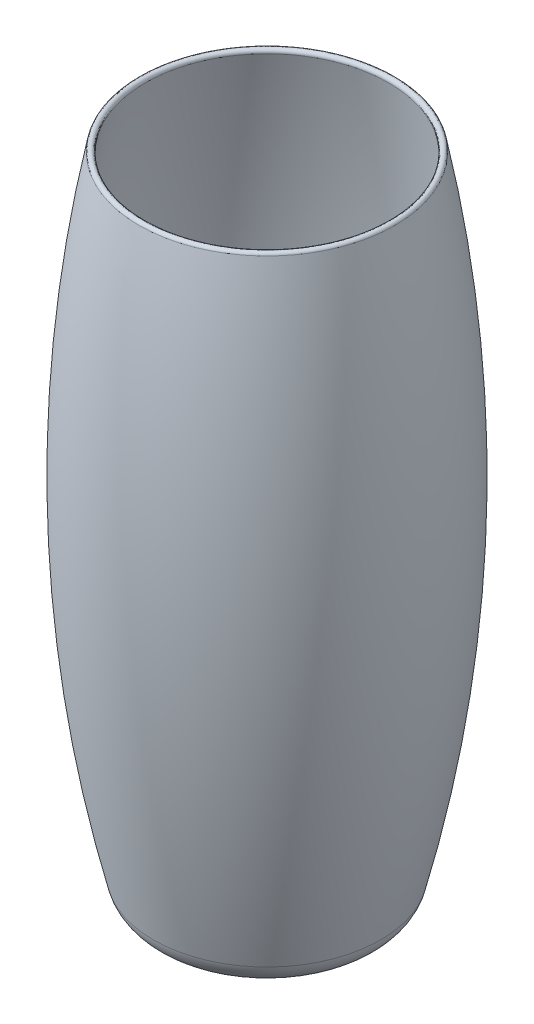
ISO-10303-21;
HEADER;
FILE_DESCRIPTION(('STEP AP214'),'2;1');
FILE_NAME('part.step','',(''),(''),'','','');
FILE_SCHEMA(('AUTOMOTIVE_DESIGN { 1 0 10303 214 1 1 1 1 }'));
ENDSEC;
DATA;
#1=APPLICATION_CONTEXT('core data for automotive mechanical design processes');
#2=APPLICATION_PROTOCOL_DEFINITION('international standard','automotive_design',2000,#1);
#3=PRODUCT_CONTEXT('',#1,'mechanical');
#4=PRODUCT('Part','Part','',(#3));
#5=PRODUCT_RELATED_PRODUCT_CATEGORY('part','',(#4));
#6=PRODUCT_DEFINITION_FORMATION('','',#4);
#7=PRODUCT_DEFINITION_CONTEXT('part definition',#1,'design');
#8=PRODUCT_DEFINITION('design','',#6,#7);
#9=PRODUCT_DEFINITION_SHAPE('','',#8);
#10=(LENGTH_UNIT() NAMED_UNIT(*) SI_UNIT(.MILLI.,.METRE.));
#11=(NAMED_UNIT(*) PLANE_ANGLE_UNIT() SI_UNIT($,.RADIAN.));
#12=(NAMED_UNIT(*) SI_UNIT($,.STERADIAN.) SOLID_ANGLE_UNIT());
#13=UNCERTAINTY_MEASURE_WITH_UNIT(LENGTH_MEASURE(1.E-05),#10,'distance_accuracy_value','');
#14=(GEOMETRIC_REPRESENTATION_CONTEXT(3) GLOBAL_UNCERTAINTY_ASSIGNED_CONTEXT((#13)) GLOBAL_UNIT_ASSIGNED_CONTEXT((#10,
#11,#12)) REPRESENTATION_CONTEXT('',''));
#15=CARTESIAN_POINT('',(0.,0.,0.));
#16=DIRECTION('',(0.,0.,1.));
#17=DIRECTION('',(1.,0.,0.));
#18=AXIS2_PLACEMENT_3D('',#15,#16,#17);
#19=CARTESIAN_POINT('',(0.,3.81,-29.1400566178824));
#20=CARTESIAN_POINT('',(1.90721224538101,3.81,-29.1400566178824));
#21=CARTESIAN_POINT('',(3.81437733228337,3.81,-28.9522172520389));
#22=CARTESIAN_POINT('',(7.55550872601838,3.81,-28.2080599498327));
#23=CARTESIAN_POINT('',(9.38938252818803,3.81,-27.6517604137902));
#24=CARTESIAN_POINT('',(12.9134512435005,3.81,-26.1920433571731));
#25=CARTESIAN_POINT('',(14.6035590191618,3.81,-25.288661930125));
#26=CARTESIAN_POINT('',(17.7751370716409,3.81,-23.1694812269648));
#27=CARTESIAN_POINT('',(19.2565289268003,3.81,-21.9537343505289));
#28=CARTESIAN_POINT('',(21.9537343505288,3.81,-19.2565289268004));
#29=CARTESIAN_POINT('',(23.1694812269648,3.81,-17.7751370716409));
#30=CARTESIAN_POINT('',(25.288661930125,3.81,-14.6035590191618));
#31=CARTESIAN_POINT('',(26.1920433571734,3.81,-12.9134512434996));
#32=CARTESIAN_POINT('',(27.6517604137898,3.81,-9.38938252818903));
#33=CARTESIAN_POINT('',(28.2080599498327,3.81,-7.55550872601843));
#34=CARTESIAN_POINT('',(28.9522172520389,3.81,-3.81437733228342));
#35=CARTESIAN_POINT('',(29.1400566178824,3.81,-1.90721224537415));
#36=CARTESIAN_POINT('',(29.1400566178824,3.81,1.90721224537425));
#37=CARTESIAN_POINT('',(28.9522172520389,3.81,3.81437733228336));
#38=CARTESIAN_POINT('',(28.2080599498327,3.81,7.55550872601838));
#39=CARTESIAN_POINT('',(27.6517604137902,3.81,9.38938252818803));
#40=CARTESIAN_POINT('',(26.1920433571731,3.81,12.9134512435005));
#41=CARTESIAN_POINT('',(25.288661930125,3.81,14.6035590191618));
#42=CARTESIAN_POINT('',(23.1694812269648,3.81,17.7751370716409));
#43=CARTESIAN_POINT('',(21.9537343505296,3.81,19.2565289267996));
#44=CARTESIAN_POINT('',(19.2565289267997,3.81,21.9537343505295));
#45=CARTESIAN_POINT('',(17.7751370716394,3.81,23.1694812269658));
#46=CARTESIAN_POINT('',(14.6035590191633,3.81,25.288661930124));
#47=CARTESIAN_POINT('',(12.9134512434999,3.81,26.1920433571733));
#48=CARTESIAN_POINT('',(9.38938252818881,3.81,27.6517604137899));
#49=CARTESIAN_POINT('',(7.55550872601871,3.81,28.2080599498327));
#50=CARTESIAN_POINT('',(3.81437733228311,3.81,28.952217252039));
#51=CARTESIAN_POINT('',(1.90721224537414,3.81,29.1400566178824));
#52=CARTESIAN_POINT('',(-1.90721224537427,3.81,29.1400566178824));
#53=CARTESIAN_POINT('',(-3.81437733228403,3.81,28.9522172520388));
#54=CARTESIAN_POINT('',(-7.55550872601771,3.81,28.2080599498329));
#55=CARTESIAN_POINT('',(-9.38938252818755,3.81,27.6517604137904));
#56=CARTESIAN_POINT('',(-12.913451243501,3.81,26.1920433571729));
#57=CARTESIAN_POINT('',(-14.6035590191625,3.81,25.2886619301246));
#58=CARTESIAN_POINT('',(-17.7751370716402,3.81,23.1694812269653));
#59=CARTESIAN_POINT('',(-19.256528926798,3.81,21.9537343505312));
#60=CARTESIAN_POINT('',(-21.9537343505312,3.81,19.2565289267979));
#61=CARTESIAN_POINT('',(-23.169481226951,3.81,17.7751370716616));
#62=CARTESIAN_POINT('',(-25.2886619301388,3.81,14.6035590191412));
#63=CARTESIAN_POINT('',(-26.1920433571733,3.81,12.9134512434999));
#64=CARTESIAN_POINT('',(-27.6517604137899,3.81,9.38938252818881));
#65=CARTESIAN_POINT('',(-28.2080599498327,3.81,7.55550872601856));
#66=CARTESIAN_POINT('',(-28.9522172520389,3.81,3.81437733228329));
#67=CARTESIAN_POINT('',(-29.1400566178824,3.81,1.90721224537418));
#68=CARTESIAN_POINT('',(-29.1400566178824,3.81,-1.90721224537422));
#69=CARTESIAN_POINT('',(-28.9522172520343,3.81,-3.81437733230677));
#70=CARTESIAN_POINT('',(-28.2080599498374,3.81,-7.55550872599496));
#71=CARTESIAN_POINT('',(-27.6517604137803,3.81,-9.38938252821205));
#72=CARTESIAN_POINT('',(-26.192043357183,3.81,-12.9134512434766));
#73=CARTESIAN_POINT('',(-25.288661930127,3.81,-14.6035590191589));
#74=CARTESIAN_POINT('',(-23.1694812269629,3.81,-17.7751370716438));
#75=CARTESIAN_POINT('',(-21.9537343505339,3.81,-19.2565289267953));
#76=CARTESIAN_POINT('',(-19.2565289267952,3.81,-21.9537343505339));
#77=CARTESIAN_POINT('',(-17.7751370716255,3.81,-23.1694812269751));
#78=CARTESIAN_POINT('',(-14.6035590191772,3.81,-25.2886619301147));
#79=CARTESIAN_POINT('',(-12.9134512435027,3.81,-26.1920433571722));
#80=CARTESIAN_POINT('',(-9.38938252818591,3.81,-27.6517604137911));
#81=CARTESIAN_POINT('',(-7.55550872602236,3.81,-28.2080599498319));
#82=CARTESIAN_POINT('',(-3.81437733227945,3.81,-28.9522172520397));
#83=CARTESIAN_POINT('',(-1.90721224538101,3.81,-29.1400566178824));
#84=CARTESIAN_POINT('',(0.,3.81,-29.1400566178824));
#85=CARTESIAN_POINT('',(0.,0.,-29.1400566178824));
#86=CARTESIAN_POINT('',(1.90721224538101,0.,-29.1400566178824));
#87=CARTESIAN_POINT('',(3.81437733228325,0.,-28.9522172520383));
#88=CARTESIAN_POINT('',(7.5555087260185,0.,-28.2080599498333));
#89=CARTESIAN_POINT('',(9.38938252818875,0.,-27.651760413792));
#90=CARTESIAN_POINT('',(12.9134512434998,0.,-26.1920433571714));
#91=CARTESIAN_POINT('',(14.6035590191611,0.,-25.2886619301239));
#92=CARTESIAN_POINT('',(17.7751370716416,0.,-23.1694812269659));
#93=CARTESIAN_POINT('',(19.2565289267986,0.,-21.9537343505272));
#94=CARTESIAN_POINT('',(21.9537343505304,0.,-19.2565289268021));
#95=CARTESIAN_POINT('',(23.1694812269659,0.,-17.7751370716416));
#96=CARTESIAN_POINT('',(25.2886619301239,0.,-14.6035590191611));
#97=CARTESIAN_POINT('',(26.1920433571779,0.,-12.9134512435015));
#98=CARTESIAN_POINT('',(27.6517604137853,0.,-9.38938252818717));
#99=CARTESIAN_POINT('',(28.2080599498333,0.,-7.55550872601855));
#100=CARTESIAN_POINT('',(28.9522172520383,0.,-3.8143773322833));
#101=CARTESIAN_POINT('',(29.1400566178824,0.,-1.90721224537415));
#102=CARTESIAN_POINT('',(29.1400566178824,0.,1.90721224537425));
#103=CARTESIAN_POINT('',(28.9522172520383,0.,3.81437733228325));
#104=CARTESIAN_POINT('',(28.2080599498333,0.,7.55550872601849));
#105=CARTESIAN_POINT('',(27.651760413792,0.,9.38938252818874));
#106=CARTESIAN_POINT('',(26.1920433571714,0.,12.9134512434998));
#107=CARTESIAN_POINT('',(25.2886619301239,0.,14.6035590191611));
#108=CARTESIAN_POINT('',(23.1694812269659,0.,17.7751370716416));
#109=CARTESIAN_POINT('',(21.9537343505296,0.,19.2565289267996));
#110=CARTESIAN_POINT('',(19.2565289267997,0.,21.9537343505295));
#111=CARTESIAN_POINT('',(17.7751370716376,0.,23.1694812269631));
#112=CARTESIAN_POINT('',(14.6035590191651,0.,25.2886619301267));
#113=CARTESIAN_POINT('',(12.9134512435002,0.,26.1920433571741));
#114=CARTESIAN_POINT('',(9.38938252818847,0.,27.6517604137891));
#115=CARTESIAN_POINT('',(7.55550872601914,0.,28.2080599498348));
#116=CARTESIAN_POINT('',(3.81437733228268,0.,28.9522172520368));
#117=CARTESIAN_POINT('',(1.90721224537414,0.,29.1400566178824));
#118=CARTESIAN_POINT('',(-1.90721224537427,0.,29.1400566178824));
#119=CARTESIAN_POINT('',(-3.81437733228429,0.,28.9522172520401));
#120=CARTESIAN_POINT('',(-7.55550872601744,0.,28.2080599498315));
#121=CARTESIAN_POINT('',(-9.38938252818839,0.,27.6517604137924));
#122=CARTESIAN_POINT('',(-12.9134512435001,0.,26.1920433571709));
#123=CARTESIAN_POINT('',(-14.6035590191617,0.,25.2886619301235));
#124=CARTESIAN_POINT('',(-17.7751370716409,0.,23.1694812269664));
#125=CARTESIAN_POINT('',(-19.2565289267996,0.,21.9537343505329));
#126=CARTESIAN_POINT('',(-21.9537343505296,0.,19.2565289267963));
#127=CARTESIAN_POINT('',(-23.1694812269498,0.,17.7751370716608));
#128=CARTESIAN_POINT('',(-25.28866193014,0.,14.6035590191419));
#129=CARTESIAN_POINT('',(-26.1920433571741,0.,12.9134512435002));
#130=CARTESIAN_POINT('',(-27.6517604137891,0.,9.38938252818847));
#131=CARTESIAN_POINT('',(-28.2080599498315,0.,7.55550872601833));
#132=CARTESIAN_POINT('',(-28.9522172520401,0.,3.81437733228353));
#133=CARTESIAN_POINT('',(-29.1400566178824,0.,1.90721224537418));
#134=CARTESIAN_POINT('',(-29.1400566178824,0.,-1.90721224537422));
#135=CARTESIAN_POINT('',(-28.9522172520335,0.,-3.81437733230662));
#136=CARTESIAN_POINT('',(-28.2080599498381,0.,-7.55550872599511));
#137=CARTESIAN_POINT('',(-27.6517604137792,0.,-9.38938252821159));
#138=CARTESIAN_POINT('',(-26.1920433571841,0.,-12.913451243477));
#139=CARTESIAN_POINT('',(-25.2886619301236,0.,-14.6035590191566));
#140=CARTESIAN_POINT('',(-23.1694812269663,0.,-17.775137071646));
#141=CARTESIAN_POINT('',(-21.9537343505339,0.,-19.2565289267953));
#142=CARTESIAN_POINT('',(-19.2565289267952,0.,-21.9537343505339));
#143=CARTESIAN_POINT('',(-17.7751370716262,0.,-23.1694812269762));
#144=CARTESIAN_POINT('',(-14.6035590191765,0.,-25.2886619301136));
#145=CARTESIAN_POINT('',(-12.913451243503,0.,-26.192043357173));
#146=CARTESIAN_POINT('',(-9.38938252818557,0.,-27.6517604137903));
#147=CARTESIAN_POINT('',(-7.55550872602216,0.,-28.2080599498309));
#148=CARTESIAN_POINT('',(-3.81437733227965,0.,-28.9522172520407));
#149=CARTESIAN_POINT('',(-1.90721224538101,0.,-29.1400566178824));
#150=CARTESIAN_POINT('',(0.,0.,-29.1400566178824));
#151=CARTESIAN_POINT('',(0.,0.,-32.9500566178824));
#152=CARTESIAN_POINT('',(2.15657616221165,0.,-32.9500566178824));
#153=CARTESIAN_POINT('',(4.31309900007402,0.,-32.7376576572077));
#154=CARTESIAN_POINT('',(8.54337531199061,0.,-31.8962033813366));
#155=CARTESIAN_POINT('',(10.6170241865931,0.,-31.267168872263));
#156=CARTESIAN_POINT('',(14.6018573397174,0.,-29.6165969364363));
#157=CARTESIAN_POINT('',(16.5129430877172,0.,-28.5951003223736));
#158=CARTESIAN_POINT('',(20.0991981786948,0.,-26.1988412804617));
#159=CARTESIAN_POINT('',(21.7742788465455,0.,-24.8241381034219));
#160=CARTESIAN_POINT('',(24.8241381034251,0.,-21.7742788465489));
#161=CARTESIAN_POINT('',(26.1988412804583,0.,-20.0991981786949));
#162=CARTESIAN_POINT('',(28.5951003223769,0.,-16.5129430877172));
#163=CARTESIAN_POINT('',(29.6165969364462,0.,-14.6018573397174));
#164=CARTESIAN_POINT('',(31.267168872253,0.,-10.6170241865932));
#165=CARTESIAN_POINT('',(31.8962033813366,0.,-8.54337531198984));
#166=CARTESIAN_POINT('',(32.7376576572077,0.,-4.31309900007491));
#167=CARTESIAN_POINT('',(32.9500566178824,0.,-2.15657616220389));
#168=CARTESIAN_POINT('',(32.9500566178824,0.,2.15657616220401));
#169=CARTESIAN_POINT('',(32.7376576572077,0.,4.31309900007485));
#170=CARTESIAN_POINT('',(31.8962033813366,0.,8.54337531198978));
#171=CARTESIAN_POINT('',(31.267168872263,0.,10.6170241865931));
#172=CARTESIAN_POINT('',(29.6165969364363,0.,14.6018573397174));
#173=CARTESIAN_POINT('',(28.5951003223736,0.,16.5129430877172));
#174=CARTESIAN_POINT('',(26.1988412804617,0.,20.0991981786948));
#175=CARTESIAN_POINT('',(24.824138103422,0.,21.7742788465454));
#176=CARTESIAN_POINT('',(21.7742788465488,0.,24.8241381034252));
#177=CARTESIAN_POINT('',(20.0991981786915,0.,26.1988412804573));
#178=CARTESIAN_POINT('',(16.5129430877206,0.,28.5951003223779));
#179=CARTESIAN_POINT('',(14.6018573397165,0.,29.6165969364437));
#180=CARTESIAN_POINT('',(10.6170241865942,0.,31.2671688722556));
#181=CARTESIAN_POINT('',(8.5433753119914,0.,31.8962033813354));
#182=CARTESIAN_POINT('',(4.31309900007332,0.,32.7376576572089));
#183=CARTESIAN_POINT('',(2.15657616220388,0.,32.9500566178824));
#184=CARTESIAN_POINT('',(-2.15657616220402,0.,32.9500566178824));
#185=CARTESIAN_POINT('',(-4.31309900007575,0.,32.7376576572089));
#186=CARTESIAN_POINT('',(-8.54337531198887,0.,31.8962033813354));
#187=CARTESIAN_POINT('',(-10.6170241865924,0.,31.2671688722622));
#188=CARTESIAN_POINT('',(-14.601857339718,0.,29.6165969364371));
#189=CARTESIAN_POINT('',(-16.5129430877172,0.,28.5951003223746));
#190=CARTESIAN_POINT('',(-20.0991981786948,0.,26.1988412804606));
#191=CARTESIAN_POINT('',(-21.7742788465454,0.,24.8241381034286));
#192=CARTESIAN_POINT('',(-24.8241381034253,0.,21.7742788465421));
#193=CARTESIAN_POINT('',(-26.1988412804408,0.,20.099198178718));
#194=CARTESIAN_POINT('',(-28.5951003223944,0.,16.5129430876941));
#195=CARTESIAN_POINT('',(-29.6165969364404,0.,14.6018573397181));
#196=CARTESIAN_POINT('',(-31.2671688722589,0.,10.6170241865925));
#197=CARTESIAN_POINT('',(-31.8962033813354,0.,8.54337531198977));
#198=CARTESIAN_POINT('',(-32.7376576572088,0.,4.31309900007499));
#199=CARTESIAN_POINT('',(-32.9500566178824,0.,2.15657616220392));
#200=CARTESIAN_POINT('',(-32.9500566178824,0.,-2.15657616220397));
#201=CARTESIAN_POINT('',(-32.7376576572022,0.,-4.31309900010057));
#202=CARTESIAN_POINT('',(-31.896203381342,0.,-8.54337531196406));
#203=CARTESIAN_POINT('',(-31.267168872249,0.,-10.6170241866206));
#204=CARTESIAN_POINT('',(-29.6165969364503,0.,-14.60185733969));
#205=CARTESIAN_POINT('',(-28.5951003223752,0.,-16.5129430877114));
#206=CARTESIAN_POINT('',(-26.1988412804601,0.,-20.0991981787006));
#207=CARTESIAN_POINT('',(-24.8241381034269,0.,-21.7742788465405));
#208=CARTESIAN_POINT('',(-21.7742788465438,0.,-24.8241381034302));
#209=CARTESIAN_POINT('',(-20.0991981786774,0.,-26.1988412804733));
#210=CARTESIAN_POINT('',(-16.5129430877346,0.,-28.5951003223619));
#211=CARTESIAN_POINT('',(-14.6018573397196,0.,-29.6165969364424));
#212=CARTESIAN_POINT('',(-10.6170241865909,0.,-31.2671688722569));
#213=CARTESIAN_POINT('',(-8.54337531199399,0.,-31.8962033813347));
#214=CARTESIAN_POINT('',(-4.31309900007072,0.,-32.7376576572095));
#215=CARTESIAN_POINT('',(-2.15657616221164,0.,-32.9500566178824));
#216=CARTESIAN_POINT('',(0.,0.,-32.9500566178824));
#217=(BOUNDED_SURFACE() B_SPLINE_SURFACE(2,3,((#19,#20,#21,#22,#23,#24,#25,#26,#27,#28,#29,#30,
#31,#32,#33,#34,#35,#36,#37,#38,#39,#40,#41,#42,#43,#44,#45,#46,#47,#48,#49,#50,#51,#52,#53,#54,
#55,#56,#57,#58,#59,#60,#61,#62,#63,#64,#65,#66,#67,#68,#69,#70,#71,#72,#73,#74,#75,#76,#77,#78,
#79,#80,#81,#82,#83,#84),(#85,#86,#87,#88,#89,#90,#91,#92,#93,#94,#95,#96,#97,#98,#99,#100,#101,
#102,#103,#104,#105,#106,#107,#108,#109,#110,#111,#112,#113,#114,#115,#116,#117,#118,#119,#120,
#121,#122,#123,#124,#125,#126,#127,#128,#129,#130,#131,#132,#133,#134,#135,#136,#137,#138,#139,
#140,#141,#142,#143,#144,#145,#146,#147,#148,#149,#150),(#151,#152,#153,#154,#155,#156,#157,
#158,#159,#160,#161,#162,#163,#164,#165,#166,#167,#168,#169,#170,#171,#172,#173,#174,#175,#176,
#177,#178,#179,#180,#181,#182,#183,#184,#185,#186,#187,#188,#189,#190,#191,#192,#193,#194,#195,
#196,#197,#198,#199,#200,#201,#202,#203,#204,#205,#206,#207,#208,#209,#210,#211,#212,#213,#214,
#215,#216)),.UNSPECIFIED.,.F.,.T.,.F.) B_SPLINE_SURFACE_WITH_KNOTS((3,3),(4,2,2,2,2,2,2,2,2,2,2,
2,2,2,2,2,2,2,2,2,2,2,2,2,2,2,2,2,2,2,2,2,4),(0.,1.),(-6.28318530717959,-6.08683576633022,
-5.89048622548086,-5.6941366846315,-5.49778714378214,-5.30143760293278,-5.10508806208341,
-4.90873852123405,-4.71238898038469,-4.51603943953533,-4.31968989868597,-4.1233403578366,
-3.92699081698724,-3.73064127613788,-3.53429173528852,-3.33794219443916,-3.14159265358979,
-2.94524311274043,-2.74889357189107,-2.55254403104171,-2.35619449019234,-2.15984494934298,
-1.96349540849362,-1.76714586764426,-1.5707963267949,-1.37444678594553,-1.17809724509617,
-0.98174770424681,-0.785398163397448,-0.589048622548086,-0.392699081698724,-0.196349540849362,
0.),.UNSPECIFIED.) GEOMETRIC_REPRESENTATION_ITEM() RATIONAL_B_SPLINE_SURFACE(((1.,1.,1.,1.,1.,
1.,1.,1.,1.,1.,1.,1.,1.,1.,1.,1.,1.,1.,1.,1.,1.,1.,1.,1.,1.,1.,1.,1.,1.,1.,1.,1.,1.,1.,1.,1.,1.,
1.,1.,1.,1.,1.,1.,1.,1.,1.,1.,1.,1.,1.,1.,1.,1.,1.,1.,1.,1.,1.,1.,1.,1.,1.,1.,1.,1.,1.),
(0.707106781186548,0.707106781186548,0.707106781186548,0.707106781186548,0.707106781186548,
0.707106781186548,0.707106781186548,0.707106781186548,0.707106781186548,0.707106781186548,
0.707106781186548,0.707106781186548,0.707106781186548,0.707106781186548,0.707106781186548,
0.707106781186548,0.707106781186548,0.707106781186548,0.707106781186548,0.707106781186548,
0.707106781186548,0.707106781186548,0.707106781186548,0.707106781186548,0.707106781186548,
0.707106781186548,0.707106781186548,0.707106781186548,0.707106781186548,0.707106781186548,
0.707106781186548,0.707106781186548,0.707106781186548,0.707106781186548,0.707106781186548,
0.707106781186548,0.707106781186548,0.707106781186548,0.707106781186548,0.707106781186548,
0.707106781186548,0.707106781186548,0.707106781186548,0.707106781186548,0.707106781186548,
0.707106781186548,0.707106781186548,0.707106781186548,0.707106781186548,0.707106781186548,
0.707106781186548,0.707106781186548,0.707106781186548,0.707106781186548,0.707106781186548,
0.707106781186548,0.707106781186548,0.707106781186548,0.707106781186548,0.707106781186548,
0.707106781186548,0.707106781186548,0.707106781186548,0.707106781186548,0.707106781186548,
0.707106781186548),(1.,1.,1.,1.,1.,1.,1.,1.,1.,1.,1.,1.,1.,1.,1.,1.,1.,1.,1.,1.,1.,1.,1.,1.,1.,
1.,1.,1.,1.,1.,1.,1.,1.,1.,1.,1.,1.,1.,1.,1.,1.,1.,1.,1.,1.,1.,1.,1.,1.,1.,1.,1.,1.,1.,1.,1.,1.,
1.,1.,1.,1.,1.,1.,1.,1.,1.))) REPRESENTATION_ITEM('') SURFACE());
#218=CARTESIAN_POINT('',(4.40933616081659,1.90499853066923,-29.320749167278));
#219=CARTESIAN_POINT('',(4.2458415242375,3.80999999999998,-28.2331169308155));
#220=CARTESIAN_POINT('',(3.91885199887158,3.81,-26.057850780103));
#221=CARTESIAN_POINT('',(3.58528919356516,1.90499736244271,-29.4446180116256));
#222=CARTESIAN_POINT('',(3.45236142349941,3.80999999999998,-28.3523907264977));
#223=CARTESIAN_POINT('',(3.1865057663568,3.81,-26.1679330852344));
#224=CARTESIAN_POINT('',(2.75601321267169,1.90499690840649,-29.533756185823));
#225=CARTESIAN_POINT('',(2.65376686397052,3.81,-28.438232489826));
#226=CARTESIAN_POINT('',(2.44927360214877,3.81,-26.2471815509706));
#227=CARTESIAN_POINT('',(1.50880360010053,1.90499829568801,-29.6149516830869));
#228=CARTESIAN_POINT('',(1.45276570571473,3.81,-28.5164197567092));
#229=CARTESIAN_POINT('',(1.34068980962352,3.81,-26.3193539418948));
#230=CARTESIAN_POINT('',(1.09247083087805,1.90499910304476,-29.6332639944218));
#231=CARTESIAN_POINT('',(1.05186864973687,3.81,-28.5340520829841));
#232=CARTESIAN_POINT('',(0.970664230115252,3.81,-26.3356272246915));
#233=CARTESIAN_POINT('',(0.259154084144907,1.90499996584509,-29.6522920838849));
#234=CARTESIAN_POINT('',(0.249510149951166,3.81,-28.5523735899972));
#235=CARTESIAN_POINT('',(0.230222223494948,3.81,-26.3525365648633));
#236=CARTESIAN_POINT('',(-0.15782989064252,1.9050000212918,-29.6530079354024));
#237=CARTESIAN_POINT('',(-0.15195134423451,3.81,-28.5530628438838));
#238=CARTESIAN_POINT('',(-0.14019420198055,3.81,-26.3531726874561));
#239=CARTESIAN_POINT('',(-0.991244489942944,1.90499927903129,-29.636829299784));
#240=CARTESIAN_POINT('',(-0.954400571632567,3.81,-28.5374849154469));
#241=CARTESIAN_POINT('',(-0.880712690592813,3.81,-26.3387953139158));
#242=CARTESIAN_POINT('',(-1.40767511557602,1.90499848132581,-29.6199348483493));
#243=CARTESIAN_POINT('',(-1.35538836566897,3.81,-28.521217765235));
#244=CARTESIAN_POINT('',(-1.25081475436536,3.81,-26.3237818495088));
#245=CARTESIAN_POINT('',(-2.23938895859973,1.9049974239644,-29.5686418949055));
#246=CARTESIAN_POINT('',(-2.15628038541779,3.81,-28.4718260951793));
#247=CARTESIAN_POINT('',(-1.99006294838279,3.81,-26.2781915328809));
#248=CARTESIAN_POINT('',(-2.65467216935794,1.90499716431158,-29.534243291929));
#249=CARTESIAN_POINT('',(-2.55618456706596,3.81,-28.4387014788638));
#250=CARTESIAN_POINT('',(-2.35920907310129,3.81,-26.2476145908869));
#251=CARTESIAN_POINT('',(-3.48342815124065,1.90499734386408,-29.4480051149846));
#252=CARTESIAN_POINT('',(-3.35424835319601,3.81,-28.3556568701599));
#253=CARTESIAN_POINT('',(-3.09588840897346,3.81,-26.1709573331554));
#254=CARTESIAN_POINT('',(-3.89690092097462,1.90499778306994,-29.3961655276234));
#255=CARTESIAN_POINT('',(-3.75240790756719,3.81000000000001,-28.3057368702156));
#256=CARTESIAN_POINT('',(-3.46342161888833,3.81,-26.1248770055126));
#257=CARTESIAN_POINT('',(-4.72141982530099,1.90499898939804,-29.2751004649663));
#258=CARTESIAN_POINT('',(-4.54635251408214,3.80999999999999,-28.1891609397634));
#259=CARTESIAN_POINT('',(-4.19621773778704,3.81,-26.0172807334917));
#260=CARTESIAN_POINT('',(-5.13246597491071,1.90499975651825,-29.2058750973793));
#261=CARTESIAN_POINT('',(-4.94213755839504,3.80999999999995,-28.1225051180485));
#262=CARTESIAN_POINT('',(-4.56148066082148,3.81,-25.9557648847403));
#263=CARTESIAN_POINT('',(-5.95159854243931,1.90500009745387,-29.0500376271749));
#264=CARTESIAN_POINT('',(-5.730826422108,3.80999999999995,-27.972459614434));
#265=CARTESIAN_POINT('',(-5.28928224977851,3.81,-25.8173036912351));
#266=CARTESIAN_POINT('',(-6.35968326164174,1.90499967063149,-28.9634162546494));
#267=CARTESIAN_POINT('',(-6.12372867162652,3.80999999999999,-27.8890609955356));
#268=CARTESIAN_POINT('',(-5.65181935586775,3.81,-25.7403501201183));
#269=CARTESIAN_POINT('',(-7.171590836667,1.90499852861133,-28.7730925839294));
#270=CARTESIAN_POINT('',(-6.90549121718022,3.81000000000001,-27.705803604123));
#271=CARTESIAN_POINT('',(-6.37329152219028,3.81,-25.5712240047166));
#272=CARTESIAN_POINT('',(-7.57541366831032,1.90499781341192,-28.6693901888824));
#273=CARTESIAN_POINT('',(-7.29435150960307,3.81,-27.605944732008));
#274=CARTESIAN_POINT('',(-6.73222656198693,3.81,-25.4790513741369));
#275=CARTESIAN_POINT('',(-8.77975058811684,1.90499690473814,-28.3329321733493));
#276=CARTESIAN_POINT('',(-8.45408682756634,3.80999999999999,-27.2819467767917));
#277=CARTESIAN_POINT('',(-7.80275806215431,3.81,-25.1799726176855));
#278=CARTESIAN_POINT('',(-9.57331795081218,1.90499794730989,-28.0747904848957));
#279=CARTESIAN_POINT('',(-9.21829388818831,3.81,-27.0333525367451));
#280=CARTESIAN_POINT('',(-8.50824517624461,3.81,-24.9504743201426));
#281=CARTESIAN_POINT('',(-10.7454504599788,1.9049995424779,-27.6380231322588));
#282=CARTESIAN_POINT('',(-10.3469078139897,3.81,-26.6128026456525));
#283=CARTESIAN_POINT('',(-9.5498223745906,3.81,-24.5623611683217));
#284=CARTESIAN_POINT('',(-11.1331676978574,1.90500007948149,-27.4841546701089));
#285=CARTESIAN_POINT('',(-10.7202042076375,3.81,-26.464656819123));
#286=CARTESIAN_POINT('',(-9.89427721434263,3.81,-24.4256612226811));
#287=CARTESIAN_POINT('',(-11.9016724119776,1.90499983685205,-27.1601890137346));
#288=CARTESIAN_POINT('',(-11.4601474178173,3.81,-26.1527311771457));
#289=CARTESIAN_POINT('',(-10.5770973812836,3.81,-24.1378153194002));
#290=CARTESIAN_POINT('',(-12.2824598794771,1.90499905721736,-26.9900917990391));
#291=CARTESIAN_POINT('',(-11.8267943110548,3.81,-25.9889513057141));
#292=CARTESIAN_POINT('',(-10.9154627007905,3.81,-23.9866693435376));
#293=CARTESIAN_POINT('',(-13.4134028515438,1.90499730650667,-26.4560206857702));
#294=CARTESIAN_POINT('',(-12.9157907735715,3.80999999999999,-25.4746883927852));
#295=CARTESIAN_POINT('',(-11.9205649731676,3.81,-23.5120211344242));
#296=CARTESIAN_POINT('',(-14.1523148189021,1.90499692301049,-26.0682017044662));
#297=CARTESIAN_POINT('',(-13.6273652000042,3.80999999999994,-25.1012190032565));
#298=CARTESIAN_POINT('',(-12.5774644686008,3.81,-23.1672503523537));
#299=CARTESIAN_POINT('',(-15.2340892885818,1.90499835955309,-25.4410032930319));
#300=CARTESIAN_POINT('',(-14.6690576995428,3.80999999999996,-24.4972595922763));
#301=CARTESIAN_POINT('',(-13.5389935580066,3.81,-22.6097705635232));
#302=CARTESIAN_POINT('',(-15.5902514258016,1.9049991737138,-25.2243568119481));
#303=CARTESIAN_POINT('',(-15.0120130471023,3.80999999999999,-24.2886453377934));
#304=CARTESIAN_POINT('',(-13.8555358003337,3.81,-22.417221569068));
#305=CARTESIAN_POINT('',(-16.2933085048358,1.90499999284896,-24.7760744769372));
#306=CARTESIAN_POINT('',(-15.6889497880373,3.81000000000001,-23.857018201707));
#307=CARTESIAN_POINT('',(-14.4802323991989,3.81,-22.0189056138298));
#308=CARTESIAN_POINT('',(-16.6402034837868,1.90499999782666,-24.5444386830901));
#309=CARTESIAN_POINT('',(-16.0229312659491,3.81,-23.6340053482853));
#310=CARTESIAN_POINT('',(-14.78838678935,3.81,-21.8131387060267));
#311=CARTESIAN_POINT('',(-17.3237182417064,1.90499920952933,-24.0668433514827));
#312=CARTESIAN_POINT('',(-16.6810513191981,3.81,-23.174153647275));
#313=CARTESIAN_POINT('',(-15.3957169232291,3.81,-21.38877350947));
#314=CARTESIAN_POINT('',(-17.6603380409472,1.90499841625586,-23.8208838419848));
#315=CARTESIAN_POINT('',(-17.0051899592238,3.81,-22.937314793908));
#316=CARTESIAN_POINT('',(-15.6948926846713,3.81,-21.1701752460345));
#317=CARTESIAN_POINT('',(-18.3228775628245,1.90499738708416,-23.3150514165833));
#318=CARTESIAN_POINT('',(-17.6431788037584,3.81,-22.4502268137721));
#319=CARTESIAN_POINT('',(-16.2837793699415,3.81,-20.7205752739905));
#320=CARTESIAN_POINT('',(-18.6487972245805,1.90499715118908,-23.0551784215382));
#321=CARTESIAN_POINT('',(-17.9570289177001,3.81,-22.1999776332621));
#322=CARTESIAN_POINT('',(-16.573490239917,3.81,-20.4895734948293));
#323=CARTESIAN_POINT('',(-19.2894151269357,1.90499737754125,-22.5219435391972));
#324=CARTESIAN_POINT('',(-18.5739218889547,3.81,-21.6864905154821));
#325=CARTESIAN_POINT('',(-17.1429334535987,3.81,-20.0155821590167));
#326=CARTESIAN_POINT('',(-19.6041133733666,1.90499783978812,-22.2485816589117));
#327=CARTESIAN_POINT('',(-18.8769647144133,3.81,-21.4232526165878));
#328=CARTESIAN_POINT('',(-17.4226658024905,3.81,-19.7725926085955));
#329=CARTESIAN_POINT('',(-20.2218113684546,1.90499905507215,-21.6887511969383));
#330=CARTESIAN_POINT('',(-19.4717553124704,3.81,-20.8841834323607));
#331=CARTESIAN_POINT('',(-17.9716424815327,3.81,-19.2750470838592));
#332=CARTESIAN_POINT('',(-20.524811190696,1.90499980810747,-21.4022826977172));
#333=CARTESIAN_POINT('',(-19.7635031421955,3.81,-20.6083522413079));
#334=CARTESIAN_POINT('',(-18.2408868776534,3.81,-19.0204911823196));
#335=CARTESIAN_POINT('',(-21.1184920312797,1.90500009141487,-20.8167103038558));
#336=CARTESIAN_POINT('',(-20.3351189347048,3.81,-20.0445436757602));
#337=CARTESIAN_POINT('',(-18.7683728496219,3.81,-18.5002104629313));
#338=CARTESIAN_POINT('',(-21.4091730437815,1.90499962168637,-20.5176064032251));
#339=CARTESIAN_POINT('',(-20.6149869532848,3.81,-19.7565662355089));
#340=CARTESIAN_POINT('',(-19.0266144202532,3.81,-18.2344856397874));
#341=CARTESIAN_POINT('',(-21.9774950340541,1.90499845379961,-19.9075870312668));
#342=CARTESIAN_POINT('',(-21.1622099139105,3.81,-19.1691937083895));
#343=CARTESIAN_POINT('',(-19.5316383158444,3.81,-17.6924058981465));
#344=CARTESIAN_POINT('',(-22.255135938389,1.90499775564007,-19.5966714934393));
#345=CARTESIAN_POINT('',(-21.4295647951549,3.80999999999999,-18.8697985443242));
#346=CARTESIAN_POINT('',(-19.7784205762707,3.81,-17.4160509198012));
#347=CARTESIAN_POINT('',(-23.0678282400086,1.90499691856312,-18.6470800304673));
#348=CARTESIAN_POINT('',(-22.2121604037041,3.80999999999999,-17.9553729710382));
#349=CARTESIAN_POINT('',(-20.5008218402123,3.81,-16.5719567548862));
#350=CARTESIAN_POINT('',(-23.5830064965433,1.90499803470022,-17.9912065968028));
#351=CARTESIAN_POINT('',(-22.7082758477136,3.81,-17.3237632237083));
#352=CARTESIAN_POINT('',(-20.9588128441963,3.81,-15.9888749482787));
#353=CARTESIAN_POINT('',(-24.313100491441,1.90499958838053,-16.9763976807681));
#354=CARTESIAN_POINT('',(-23.4112612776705,3.81,-16.3466365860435));
#355=CARTESIAN_POINT('',(-21.60758249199,3.81,-15.0871140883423));
#356=CARTESIAN_POINT('',(-24.5493767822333,1.90500008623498,-16.63292173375));
#357=CARTESIAN_POINT('',(-23.6387480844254,3.81,-16.0159373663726));
#358=CARTESIAN_POINT('',(-21.8174907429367,3.81,-14.7819687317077));
#359=CARTESIAN_POINT('',(-25.0071475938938,1.90499979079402,-15.9363714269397));
#360=CARTESIAN_POINT('',(-24.0795059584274,3.81,-15.3452738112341));
#361=CARTESIAN_POINT('',(-22.224222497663,3.81,-14.1630784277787));
#362=CARTESIAN_POINT('',(-25.2286420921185,1.90499899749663,-15.5832970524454));
#363=CARTESIAN_POINT('',(-24.2927770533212,3.81,-15.0053093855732));
#364=CARTESIAN_POINT('',(-22.4210459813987,3.81,-13.849333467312));
#365=CARTESIAN_POINT('',(-25.8704336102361,1.90499725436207,-14.5106890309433));
#366=CARTESIAN_POINT('',(-24.910766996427,3.81,-13.9724796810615));
#367=CARTESIAN_POINT('',(-22.9914308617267,3.81,-12.8960596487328));
#368=CARTESIAN_POINT('',(-26.2681497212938,1.90499694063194,-13.7776159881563));
#369=CARTESIAN_POINT('',(-25.2937692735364,3.81000000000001,-13.266529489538));
#370=CARTESIAN_POINT('',(-23.3450053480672,3.81,-12.2443546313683));
#371=CARTESIAN_POINT('',(-26.8174154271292,1.9049984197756,-12.6549741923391));
#372=CARTESIAN_POINT('',(-25.8226821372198,3.81,-12.1854867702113));
#373=CARTESIAN_POINT('',(-23.8332139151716,3.81,-11.2465111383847));
#374=CARTESIAN_POINT('',(-26.9926362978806,1.90499923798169,-12.2768777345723));
#375=CARTESIAN_POINT('',(-25.9914043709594,3.80999999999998,-11.8214108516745));
#376=CARTESIAN_POINT('',(-23.9889397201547,3.81,-10.9104767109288));
#377=CARTESIAN_POINT('',(-27.3270435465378,1.90500001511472,-11.5134001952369));
#378=CARTESIAN_POINT('',(-26.3133871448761,3.81000000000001,-11.0863001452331));
#379=CARTESIAN_POINT('',(-24.2860743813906,3.81,-10.2320999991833));
#380=CARTESIAN_POINT('',(-27.486229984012,1.90499997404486,-11.1280191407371));
#381=CARTESIAN_POINT('',(-26.4666477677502,3.81000000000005,-10.7152653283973));
#382=CARTESIAN_POINT('',(-24.427483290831,3.81,-9.88975773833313));
#383=CARTESIAN_POINT('',(-27.7881409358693,1.90499914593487,-10.3509989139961));
#384=CARTESIAN_POINT('',(-26.7573420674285,3.81000000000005,-9.96711186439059));
#385=CARTESIAN_POINT('',(-24.6957433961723,3.81,-9.19933744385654));
#386=CARTESIAN_POINT('',(-27.9308617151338,1.90499835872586,-9.95935834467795));
#387=CARTESIAN_POINT('',(-26.8947721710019,3.81000000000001,-9.58999180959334));
#388=CARTESIAN_POINT('',(-24.8225912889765,3.81,-8.85125812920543));
#389=CARTESIAN_POINT('',(-28.1996771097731,1.9049973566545,-9.17047128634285));
#390=CARTESIAN_POINT('',(-27.1536274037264,3.80999999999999,-8.83033622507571));
#391=CARTESIAN_POINT('',(-25.0615250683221,3.81,-8.15006521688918));
#392=CARTESIAN_POINT('',(-28.325771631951,1.90499714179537,-8.77322476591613));
#393=CARTESIAN_POINT('',(-27.2750524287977,3.81,-8.4478007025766));
#394=CARTESIAN_POINT('',(-25.1736108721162,3.81,-7.79695159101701));
#395=CARTESIAN_POINT('',(-28.5611356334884,1.90499740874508,-7.97377169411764));
#396=CARTESIAN_POINT('',(-27.5016996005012,3.81,-7.67795484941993));
#397=CARTESIAN_POINT('',(-25.3828246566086,3.81,-7.08632034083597));
#398=CARTESIAN_POINT('',(-28.6704051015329,1.90499789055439,-7.57156513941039));
#399=CARTESIAN_POINT('',(-27.6069217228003,3.81,-7.290644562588));
#400=CARTESIAN_POINT('',(-25.4799526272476,3.81,-6.72880271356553));
#401=CARTESIAN_POINT('',(-28.8719349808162,1.90499911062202,-6.76276826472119));
#402=CARTESIAN_POINT('',(-27.8009771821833,3.81,-6.51184457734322));
#403=CARTESIAN_POINT('',(-25.6590605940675,3.81,-6.00999693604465));
#404=CARTESIAN_POINT('',(-28.9641954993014,1.90499984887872,-6.35617797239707));
#405=CARTESIAN_POINT('',(-27.8898106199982,3.81,-6.1203549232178));
#406=CARTESIAN_POINT('',(-25.7410406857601,3.81,-5.64870880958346));
#407=CARTESIAN_POINT('',(-29.1314509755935,1.9050000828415,-5.53937122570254));
#408=CARTESIAN_POINT('',(-28.0508497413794,3.81,-5.33390662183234));
#409=CARTESIAN_POINT('',(-25.8896473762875,3.81,-4.92297738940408));
#410=CARTESIAN_POINT('',(-29.2064458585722,1.90499957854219,-5.12915475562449));
#411=CARTESIAN_POINT('',(-28.1230553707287,3.81,-4.93894787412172));
#412=CARTESIAN_POINT('',(-25.9562739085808,3.81,-4.55853408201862));
#413=CARTESIAN_POINT('',(-29.3390362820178,1.90499839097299,-4.30616388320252));
#414=CARTESIAN_POINT('',(-28.2507237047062,3.81,-4.14650782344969));
#415=CARTESIAN_POINT('',(-26.0740967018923,3.81,-3.82719548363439));
#416=CARTESIAN_POINT('',(-29.3966317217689,1.90499770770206,-3.89338946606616));
#417=CARTESIAN_POINT('',(-28.3061863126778,3.81,-3.74902649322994));
#418=CARTESIAN_POINT('',(-26.1252928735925,3.81,-3.4603001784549));
#419=CARTESIAN_POINT('',(-29.543280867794,1.90499693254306,-2.65201848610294));
#420=CARTESIAN_POINT('',(-28.4474042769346,3.81,-2.55362606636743));
#421=CARTESIAN_POINT('',(-26.2556475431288,3.81,-2.35684109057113));
#422=CARTESIAN_POINT('',(-29.6062350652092,1.90499811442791,-1.82018991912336));
#423=CARTESIAN_POINT('',(-28.5080259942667,3.80999999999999,-1.75257350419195));
#424=CARTESIAN_POINT('',(-26.311605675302,3.81,-1.61734037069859));
#425=CARTESIAN_POINT('',(-29.6479353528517,1.90499962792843,-0.570253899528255));
#426=CARTESIAN_POINT('',(-28.5481790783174,3.81,-0.549053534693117));
#427=CARTESIAN_POINT('',(-26.3486661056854,3.81,-0.506652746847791));
#428=CARTESIAN_POINT('',(-29.6530399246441,1.9050000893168,-0.153105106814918));
#429=CARTESIAN_POINT('',(-28.5530934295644,3.81,-0.147423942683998));
#430=CARTESIAN_POINT('',(-26.3532005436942,3.81,-0.136061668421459));
#431=CARTESIAN_POINT('',(-29.6456039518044,1.90499974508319,0.680924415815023));
#432=CARTESIAN_POINT('',(-28.5459335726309,3.81,0.655609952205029));
#433=CARTESIAN_POINT('',(-26.3465925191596,3.81,0.60498104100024));
#434=CARTESIAN_POINT('',(-29.6330633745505,1.90499893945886,1.09780514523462));
#435=CARTESIAN_POINT('',(-28.5338593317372,3.81,1.05701434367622));
#436=CARTESIAN_POINT('',(-26.3354500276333,3.81,0.975432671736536));
#437=CARTESIAN_POINT('',(-29.5691066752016,1.90499720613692,2.34694446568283));
#438=CARTESIAN_POINT('',(-28.4722740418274,3.81,2.25983296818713));
#439=CARTESIAN_POINT('',(-26.2786055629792,3.81,2.08560945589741));
#440=CARTESIAN_POINT('',(-29.4913617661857,1.90499696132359,3.17788748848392));
#441=CARTESIAN_POINT('',(-28.3974063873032,3.81,3.06003266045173));
#442=CARTESIAN_POINT('',(-26.2094920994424,3.81,2.82432287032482));
#443=CARTESIAN_POINT('',(-29.3225469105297,1.90499848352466,4.4171005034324));
#444=CARTESIAN_POINT('',(-28.2348473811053,3.81,4.25332360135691));
#445=CARTESIAN_POINT('',(-26.0594465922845,3.81,3.92576954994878));
#446=CARTESIAN_POINT('',(-29.2575653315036,1.90499930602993,4.82901777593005));
#447=CARTESIAN_POINT('',(-28.1722748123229,3.81,4.64996384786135));
#448=CARTESIAN_POINT('',(-26.001692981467,3.81,4.29185586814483));
#449=CARTESIAN_POINT('',(-29.1102021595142,1.90500003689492,5.64996575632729));
#450=CARTESIAN_POINT('',(-28.0303874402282,3.81,5.44040837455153));
#451=CARTESIAN_POINT('',(-25.8707580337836,3.81,5.02129367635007));
#452=CARTESIAN_POINT('',(-29.0278206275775,1.90499994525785,6.05899647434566));
#453=CARTESIAN_POINT('',(-27.9510726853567,3.81,5.83421272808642));
#454=CARTESIAN_POINT('',(-25.797576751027,3.81,5.38464517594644));
#455=CARTESIAN_POINT('',(-28.845900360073,1.90499907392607,6.87298817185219));
#456=CARTESIAN_POINT('',(-27.7759100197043,3.81,6.61796579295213));
#457=CARTESIAN_POINT('',(-25.6359283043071,3.81,6.10792075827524));
#458=CARTESIAN_POINT('',(-28.74636166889,1.90499829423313,7.27794916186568));
#459=CARTESIAN_POINT('',(-27.6800621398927,3.80999999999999,7.00791456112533));
#460=CARTESIAN_POINT('',(-25.5474611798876,3.81,6.4678448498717));
#461=CARTESIAN_POINT('',(-28.5303366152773,1.90499732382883,8.08327250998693));
#462=CARTESIAN_POINT('',(-27.4720417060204,3.81,7.78339943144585));
#463=CARTESIAN_POINT('',(-25.3554489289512,3.81,7.18365237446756));
#464=CARTESIAN_POINT('',(-28.4138501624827,1.90499713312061,8.48363484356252));
#465=CARTESIAN_POINT('',(-27.3598690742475,3.81000000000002,8.16893546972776));
#466=CARTESIAN_POINT('',(-25.2519037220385,3.81,7.5395357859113));
#467=CARTESIAN_POINT('',(-28.1641899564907,1.90499744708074,9.27889958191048));
#468=CARTESIAN_POINT('',(-27.1194546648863,3.81000000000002,8.93474770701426));
#469=CARTESIAN_POINT('',(-25.0299812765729,3.81,8.24644305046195));
#470=CARTESIAN_POINT('',(-28.0310249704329,1.90499795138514,9.67380473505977));
#471=CARTESIAN_POINT('',(-26.9912213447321,3.81,9.3150265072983));
#472=CARTESIAN_POINT('',(-24.911611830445,3.81,8.59746934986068));
#473=CARTESIAN_POINT('',(-27.7481227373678,1.90499917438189,10.4577948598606));
#474=CARTESIAN_POINT('',(-26.7188126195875,3.80999999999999,10.0699367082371));
#475=CARTESIAN_POINT('',(-24.660191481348,3.81,9.29422010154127));
#476=CARTESIAN_POINT('',(-27.5983855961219,1.90499989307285,10.8468798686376));
#477=CARTESIAN_POINT('',(-26.5746373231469,3.81,10.4445681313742));
#478=CARTESIAN_POINT('',(-24.5271406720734,3.81,9.63994458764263));
#479=CARTESIAN_POINT('',(-27.2825601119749,1.90500006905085,11.6184306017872));
#480=CARTESIAN_POINT('',(-26.2705503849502,3.81,11.1874420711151));
#481=CARTESIAN_POINT('',(-24.2465309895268,3.81,10.3254650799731));
#482=CARTESIAN_POINT('',(-27.1164717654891,1.90499952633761,12.0008963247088));
#483=CARTESIAN_POINT('',(-26.1106387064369,3.81,11.5556846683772));
#484=CARTESIAN_POINT('',(-24.0989721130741,3.81,10.6652610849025));
#485=CARTESIAN_POINT('',(-26.7684207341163,1.90499831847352,12.7582731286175));
#486=CARTESIAN_POINT('',(-25.7755065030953,3.81,12.2849492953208));
#487=CARTESIAN_POINT('',(-23.7896763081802,3.81,11.3383007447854));
#488=CARTESIAN_POINT('',(-26.586457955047,1.90499765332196,13.1331841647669));
#489=CARTESIAN_POINT('',(-25.6002858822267,3.81,12.6459712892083));
#490=CARTESIAN_POINT('',(-23.6279392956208,3.81,11.6715443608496));
#491=CARTESIAN_POINT('',(-26.0171741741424,1.90499695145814,14.2458832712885));
#492=CARTESIAN_POINT('',(-25.0520830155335,3.81,13.7174653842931));
#493=CARTESIAN_POINT('',(-23.121897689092,3.81,12.6606277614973));
#494=CARTESIAN_POINT('',(-25.6063780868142,1.90499820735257,14.9718317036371));
#495=CARTESIAN_POINT('',(-24.6564832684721,3.80999999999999,14.4165523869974));
#496=CARTESIAN_POINT('',(-22.7566917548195,3.81,13.3059928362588));
#497=CARTESIAN_POINT('',(-24.9452561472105,1.90499967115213,16.0330710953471));
#498=CARTESIAN_POINT('',(-24.0199152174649,3.81,15.4383802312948));
#499=CARTESIAN_POINT('',(-22.1692330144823,3.81,14.2489983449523));
#500=CARTESIAN_POINT('',(-24.7173664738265,1.90500008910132,16.3822408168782));
#501=CARTESIAN_POINT('',(-23.800504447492,3.81000000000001,15.7745581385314));
#502=CARTESIAN_POINT('',(-21.9667805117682,3.81,14.5591927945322));
#503=CARTESIAN_POINT('',(-24.2471040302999,1.90499969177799,17.0705337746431));
#504=CARTESIAN_POINT('',(-23.3477180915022,3.80999999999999,16.4372719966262));
#505=CARTESIAN_POINT('',(-21.5489459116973,3.81,15.1707482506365));
#506=CARTESIAN_POINT('',(-24.0047312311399,1.904998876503,17.4096569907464));
#507=CARTESIAN_POINT('',(-23.1143424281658,3.80999999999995,16.7638079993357));
#508=CARTESIAN_POINT('',(-21.3335637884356,3.81,15.472109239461));
#509=CARTESIAN_POINT('',(-23.2566768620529,1.9049971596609,18.4110310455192));
#510=CARTESIAN_POINT('',(-22.3940244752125,3.80999999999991,17.7280527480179));
#511=CARTESIAN_POINT('',(-20.6687172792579,3.81,16.3620939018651));
#512=CARTESIAN_POINT('',(-22.7298862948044,1.90499698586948,19.0575638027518));
#513=CARTESIAN_POINT('',(-21.8867248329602,3.80999999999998,18.3506651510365));
#514=CARTESIAN_POINT('',(-20.2003990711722,3.81,16.9368657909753));
#515=CARTESIAN_POINT('',(-21.900392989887,1.90499854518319,19.9923791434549));
#516=CARTESIAN_POINT('',(-21.0879728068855,3.81000000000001,19.250835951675));
#517=CARTESIAN_POINT('',(-19.4631311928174,3.81,17.7677484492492));
#518=CARTESIAN_POINT('',(-21.6173096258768,1.90499936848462,20.2981863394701));
#519=CARTESIAN_POINT('',(-20.8153886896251,3.81,19.545299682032));
#520=CARTESIAN_POINT('',(-19.2115462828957,3.81,18.0395258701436));
#521=CARTESIAN_POINT('',(-21.0383164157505,1.90500005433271,20.8977276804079));
#522=CARTESIAN_POINT('',(-20.2579099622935,3.81,20.1225634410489));
#523=CARTESIAN_POINT('',(-18.6970970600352,3.81,18.5722350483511));
#524=CARTESIAN_POINT('',(-20.7424066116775,1.90499991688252,21.1914618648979));
#525=CARTESIAN_POINT('',(-19.9730153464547,3.81,20.4053635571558));
#526=CARTESIAN_POINT('',(-18.4342327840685,3.81,18.8331668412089));
#527=CARTESIAN_POINT('',(-20.1385750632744,1.90499900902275,21.7660601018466));
#528=CARTESIAN_POINT('',(-19.3916135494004,3.81,20.9586172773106));
#529=CARTESIAN_POINT('',(-17.8976897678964,3.81,19.343730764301));
#530=CARTESIAN_POINT('',(-19.8306515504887,1.90499823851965,22.0469222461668));
#531=CARTESIAN_POINT('',(-19.0951046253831,3.81,21.2290690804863));
#532=CARTESIAN_POINT('',(-17.6240094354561,3.81,19.5933612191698));
#533=CARTESIAN_POINT('',(-19.203294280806,1.90499729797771,22.5954116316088));
#534=CARTESIAN_POINT('',(-18.4909912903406,3.81,21.7572373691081));
#535=CARTESIAN_POINT('',(-17.0663833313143,3.81,20.0808864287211));
#536=CARTESIAN_POINT('',(-18.8838604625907,1.90499712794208,22.8630388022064));
#537=CARTESIAN_POINT('',(-18.1833868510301,3.81,22.0149537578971));
#538=CARTESIAN_POINT('',(-16.7824375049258,3.81,20.318781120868));
#539=CARTESIAN_POINT('',(-18.2340126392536,1.90499748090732,23.3846193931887));
#540=CARTESIAN_POINT('',(-17.5576059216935,3.81,22.517217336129));
#541=CARTESIAN_POINT('',(-16.2047906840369,3.81,20.7824109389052));
#542=CARTESIAN_POINT('',(-17.9035987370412,1.90499800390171,23.6385729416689));
#543=CARTESIAN_POINT('',(-17.2394295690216,3.80999999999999,22.7617646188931));
#544=CARTESIAN_POINT('',(-15.9110897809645,3.81,21.0081461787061));
#545=CARTESIAN_POINT('',(-17.2322357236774,1.90499922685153,24.1324252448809));
#546=CARTESIAN_POINT('',(-16.5929712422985,3.81000000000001,23.2372972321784));
#547=CARTESIAN_POINT('',(-15.3144417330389,3.81,21.4470405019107));
#548=CARTESIAN_POINT('',(-16.8912866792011,1.90499992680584,24.3723240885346));
#549=CARTESIAN_POINT('',(-16.2646893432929,3.81000000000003,23.4682826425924));
#550=CARTESIAN_POINT('',(-15.0114946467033,3.81,21.6601996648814));
#551=CARTESIAN_POINT('',(-16.1992388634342,1.90500005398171,24.8376910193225));
#552=CARTESIAN_POINT('',(-15.5983635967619,3.81000000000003,23.9163527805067));
#553=CARTESIAN_POINT('',(-14.396613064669,3.81,22.0736763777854));
#554=CARTESIAN_POINT('',(-15.8481325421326,1.90499948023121,25.0631479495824));
#555=CARTESIAN_POINT('',(-15.2603124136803,3.81000000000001,24.1334268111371));
#556=CARTESIAN_POINT('',(-14.0846718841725,3.81,22.2739839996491));
#557=CARTESIAN_POINT('',(-15.1369199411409,1.90499825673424,25.4989338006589));
#558=CARTESIAN_POINT('',(-14.5754959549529,3.80999999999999,24.5530387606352));
#559=CARTESIAN_POINT('',(-13.4526469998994,3.81,22.661246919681));
#560=CARTESIAN_POINT('',(-14.7768135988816,1.90499760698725,25.7092626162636));
#561=CARTESIAN_POINT('',(-14.2287306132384,3.81,24.7555765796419));
#562=CARTESIAN_POINT('',(-13.1325632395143,3.81,22.8482021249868));
#563=CARTESIAN_POINT('',(-13.6836846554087,1.90499697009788,26.3172272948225));
#564=CARTESIAN_POINT('',(-13.1760809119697,3.81,25.3410273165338));
#565=CARTESIAN_POINT('',(-12.160871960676,3.81,23.3886241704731));
#566=CARTESIAN_POINT('',(-12.9377263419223,1.90499829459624,26.6919259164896));
#567=CARTESIAN_POINT('',(-12.4577221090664,3.81,25.7018587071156));
#568=CARTESIAN_POINT('',(-11.4977126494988,3.81,23.7217225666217));
#569=CARTESIAN_POINT('',(-11.7970799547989,1.90499970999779,27.2057753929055));
#570=CARTESIAN_POINT('',(-11.3594409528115,3.81,26.1966246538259));
#571=CARTESIAN_POINT('',(-10.4841627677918,3.81,24.178322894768));
#572=CARTESIAN_POINT('',(-11.4133307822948,1.90500008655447,27.3689956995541));
#573=CARTESIAN_POINT('',(-10.9899713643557,3.81,26.3537711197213));
#574=CARTESIAN_POINT('',(-10.1432526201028,3.81,24.3233220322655));
#575=CARTESIAN_POINT('',(-10.6394034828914,1.9049996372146,27.6790209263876));
#576=CARTESIAN_POINT('',(-10.2448044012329,3.81,26.6522749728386));
#577=CARTESIAN_POINT('',(-9.45560607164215,3.81,24.5987826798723));
#578=CARTESIAN_POINT('',(-10.2492252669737,1.90499881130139,27.8258256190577));
#579=CARTESIAN_POINT('',(-9.8691068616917,3.81,26.7936321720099));
#580=CARTESIAN_POINT('',(-9.10886959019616,3.81,24.7292439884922));
#581=CARTESIAN_POINT('',(-9.07018644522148,1.9049971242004,28.2412968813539));
#582=CARTESIAN_POINT('',(-8.73378161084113,3.81000000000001,27.1936996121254));
#583=CARTESIAN_POINT('',(-8.06097118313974,3.81,25.0985018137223));
#584=CARTESIAN_POINT('',(-8.2725114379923,1.90499705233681,28.4851602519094));
#585=CARTESIAN_POINT('',(-7.96562290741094,3.81000000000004,27.4285400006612));
#586=CARTESIAN_POINT('',(-7.35184471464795,3.81,25.3152962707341));
#587=CARTESIAN_POINT('',(-7.16177755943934,1.90499846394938,28.7742322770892));
#588=CARTESIAN_POINT('',(-6.89605091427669,3.81000000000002,27.7068993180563));
#589=CARTESIAN_POINT('',(-6.36459717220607,3.81,25.5722316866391));
#590=CARTESIAN_POINT('',(-6.8561422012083,1.9049990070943,28.8486063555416));
#591=CARTESIAN_POINT('',(-6.60174822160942,3.81,27.7785151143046));
#592=CARTESIAN_POINT('',(-6.09295996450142,3.81,25.6383315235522));
#593=CARTESIAN_POINT('',(-6.24251889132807,1.90499979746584,28.98760933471));
#594=CARTESIAN_POINT('',(-6.01091739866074,3.81,27.912355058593));
#595=CARTESIAN_POINT('',(-5.54771434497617,3.81,25.7618462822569));
#596=CARTESIAN_POINT('',(-5.93453102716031,1.90500004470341,29.0522385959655));
#597=CARTESIAN_POINT('',(-5.71438933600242,3.81,27.9745795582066));
#598=CARTESIAN_POINT('',(-5.27410600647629,3.81,25.8192615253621));
#599=CARTESIAN_POINT('',(-5.00793024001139,1.90499981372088,29.231286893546));
#600=CARTESIAN_POINT('',(-4.82223236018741,3.81,28.1469719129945));
#601=CARTESIAN_POINT('',(-4.45083650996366,3.81,25.9783417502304));
#602=CARTESIAN_POINT('',(-4.38652051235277,1.90499836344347,29.3309079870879));
#603=CARTESIAN_POINT('',(-4.22387681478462,3.80999999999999,28.2428986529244));
#604=CARTESIAN_POINT('',(-3.89858913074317,3.81,26.0668781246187));
#605=CARTESIAN_POINT('',(-3.13900897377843,1.90499703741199,29.4904541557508));
#606=CARTESIAN_POINT('',(-3.02259370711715,3.81,28.3965326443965));
#607=CARTESIAN_POINT('',(-2.78976299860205,3.81,26.208686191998));
#608=CARTESIAN_POINT('',(-2.51290872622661,1.90499716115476,29.5503919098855));
#609=CARTESIAN_POINT('',(-2.419667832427,3.81000000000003,28.4542520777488));
#610=CARTESIAN_POINT('',(-2.2331856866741,3.81,26.261969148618));
#611=CARTESIAN_POINT('',(-1.57178303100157,1.90499823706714,29.6104076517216));
#612=CARTESIAN_POINT('',(-1.51341284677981,3.80999999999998,28.512043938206));
#613=CARTESIAN_POINT('',(-1.3966723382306,3.81,26.3153144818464));
#614=CARTESIAN_POINT('',(-1.25771039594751,1.904998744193,29.6254310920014));
#615=CARTESIAN_POINT('',(-1.21098330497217,3.80999999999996,28.5265100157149));
#616=CARTESIAN_POINT('',(-1.11752902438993,3.81,26.3286664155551));
#617=CARTESIAN_POINT('',(-0.629116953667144,1.90499962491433,29.6454769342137));
#618=CARTESIAN_POINT('',(-0.605727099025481,3.81000000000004,28.5458115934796));
#619=CARTESIAN_POINT('',(-0.558947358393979,3.81,26.3464804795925));
#620=CARTESIAN_POINT('',(-0.314596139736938,1.90499999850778,29.650499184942));
#621=CARTESIAN_POINT('',(-0.302900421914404,3.81000000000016,28.5506469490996));
#622=CARTESIAN_POINT('',(-0.279509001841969,3.81,26.3509424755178));
#623=CARTESIAN_POINT('',(0.36231724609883,1.90500000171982,29.6505005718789));
#624=CARTESIAN_POINT('',(0.348847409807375,3.81000000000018,28.5506482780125));
#625=CARTESIAN_POINT('',(0.321907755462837,3.81,26.3509436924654));
#626=CARTESIAN_POINT('',(0.724710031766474,1.90499950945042,29.6438347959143));
#627=CARTESIAN_POINT('',(0.697769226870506,3.81000000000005,28.5442305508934));
#628=CARTESIAN_POINT('',(0.643887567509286,3.81,26.3450214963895));
#629=CARTESIAN_POINT('',(1.44884615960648,1.90499845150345,29.6172344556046));
#630=CARTESIAN_POINT('',(1.39502943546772,3.80999999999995,28.5186174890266));
#631=CARTESIAN_POINT('',(1.28739585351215,3.81,26.3213817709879));
#632=CARTESIAN_POINT('',(1.81058948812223,1.90499788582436,29.5972996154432));
#633=CARTESIAN_POINT('',(1.74336781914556,3.80999999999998,28.4994218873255));
#634=CARTESIAN_POINT('',(1.60892431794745,3.81,26.3036639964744));
#635=CARTESIAN_POINT('',(2.89435768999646,1.90499696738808,29.5176557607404));
#636=CARTESIAN_POINT('',(2.78699073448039,3.81000000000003,28.4227283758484));
#637=CARTESIAN_POINT('',(2.5722563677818,3.81,26.2328701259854));
#638=CARTESIAN_POINT('',(3.6150168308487,1.90499739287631,29.438107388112));
#639=CARTESIAN_POINT('',(3.48097527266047,3.81000000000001,28.3461237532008));
#640=CARTESIAN_POINT('',(3.2128919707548,3.81,26.1621534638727));
#641=CARTESIAN_POINT('',(4.69045332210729,1.90499893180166,29.2793574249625));
#642=CARTESIAN_POINT('',(4.51653501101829,3.81,28.1932599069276));
#643=CARTESIAN_POINT('',(4.16869822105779,3.81,26.0210636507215));
#644=CARTESIAN_POINT('',(5.0481539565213,1.90499959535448,29.2198366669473));
#645=CARTESIAN_POINT('',(4.86096039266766,3.81,28.1359474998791));
#646=CARTESIAN_POINT('',(4.48657318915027,3.81,25.9681687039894));
#647=CARTESIAN_POINT('',(5.76125130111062,1.90500006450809,29.0876557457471));
#648=CARTESIAN_POINT('',(5.54755510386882,3.81,28.0086794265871));
#649=CARTESIAN_POINT('',(5.12016275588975,3.81,25.8507268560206));
#650=CARTESIAN_POINT('',(6.11664802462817,1.90499987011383,29.0149956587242));
#651=CARTESIAN_POINT('',(5.88972449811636,3.81,27.9387238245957));
#652=CARTESIAN_POINT('',(5.43587736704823,3.81,25.786180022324));
#653=CARTESIAN_POINT('',(7.17829830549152,1.90499877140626,28.7775455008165));
#654=CARTESIAN_POINT('',(6.91193047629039,3.81,27.7100948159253));
#655=CARTESIAN_POINT('',(6.37919440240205,3.81,25.575192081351));
#656=CARTESIAN_POINT('',(7.88008444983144,1.90499735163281,28.5932748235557));
#657=CARTESIAN_POINT('',(7.5877346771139,3.80999999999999,27.5326488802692));
#658=CARTESIAN_POINT('',(7.00303437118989,3.81,25.4113940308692));
#659=CARTESIAN_POINT('',(8.97290812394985,1.90499717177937,28.2631542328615));
#660=CARTESIAN_POINT('',(8.64009023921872,3.80999999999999,27.214753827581));
#661=CARTESIAN_POINT('',(7.97445343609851,3.81,25.117949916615));
#662=CARTESIAN_POINT('',(9.36918141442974,1.90499753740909,28.1342892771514));
#663=CARTESIAN_POINT('',(9.02168724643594,3.81,27.0906610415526));
#664=CARTESIAN_POINT('',(8.32669806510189,3.81,25.003401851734));
#665=CARTESIAN_POINT('',(10.1560699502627,1.90499869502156,27.8599500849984));
#666=CARTESIAN_POINT('',(9.77940792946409,3.81,26.8264903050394));
#667=CARTESIAN_POINT('',(9.02608341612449,3.81,24.7595693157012));
#668=CARTESIAN_POINT('',(10.5466850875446,1.90499948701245,27.714475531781));
#669=CARTESIAN_POINT('',(10.1555314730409,3.81,26.6864120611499));
#670=CARTESIAN_POINT('',(9.37322404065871,3.81,24.6302845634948));
#671=CARTESIAN_POINT('',(11.3216137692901,1.90500007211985,27.4070622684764));
#672=CARTESIAN_POINT('',(10.9016639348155,3.81,26.3904226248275));
#673=CARTESIAN_POINT('',(10.0617643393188,3.81,24.3571433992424));
#674=CARTESIAN_POINT('',(11.7059267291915,1.90499986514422,27.2451220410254));
#675=CARTESIAN_POINT('',(11.2716723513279,3.81,26.2345099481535));
#676=CARTESIAN_POINT('',(10.4031634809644,3.81,24.2132856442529));
#677=CARTESIAN_POINT('',(12.467140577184,1.90499887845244,26.9052730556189));
#678=CARTESIAN_POINT('',(12.0046122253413,3.81,25.9072837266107));
#679=CARTESIAN_POINT('',(11.0795549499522,3.81,23.9113039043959));
#680=CARTESIAN_POINT('',(12.8440414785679,1.90499809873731,26.7273643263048));
#681=CARTESIAN_POINT('',(12.3675437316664,3.81,25.7359701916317));
#682=CARTESIAN_POINT('',(11.4145472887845,3.81,23.7531799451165));
#683=CARTESIAN_POINT('',(13.9631225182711,1.90499688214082,26.1700212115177));
#684=CARTESIAN_POINT('',(13.4451715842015,3.81,25.1992721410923));
#685=CARTESIAN_POINT('',(12.4092678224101,3.81,23.2577709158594));
#686=CARTESIAN_POINT('',(14.6936768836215,1.90499756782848,25.7669715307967));
#687=CARTESIAN_POINT('',(14.1486969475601,3.81,24.8111319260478));
#688=CARTESIAN_POINT('',(13.0587358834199,3.81,22.8994501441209));
#689=CARTESIAN_POINT('',(15.7622215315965,1.90499929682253,25.1172600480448));
#690=CARTESIAN_POINT('',(15.1775907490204,3.81,24.1855304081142));
#691=CARTESIAN_POINT('',(14.0083287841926,3.81,22.3220704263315));
#692=CARTESIAN_POINT('',(16.1138888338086,1.90499999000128,24.8931422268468));
#693=CARTESIAN_POINT('',(15.5161885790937,3.81,23.9697411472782));
#694=CARTESIAN_POINT('',(14.3207880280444,3.81,22.1229390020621));
#695=CARTESIAN_POINT('',(16.8074353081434,1.90500000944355,24.4302292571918));
#696=CARTESIAN_POINT('',(16.1839586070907,3.81,23.5240328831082));
#697=CARTESIAN_POINT('',(14.9370052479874,3.81,21.7116401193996));
#698=CARTESIAN_POINT('',(17.1493144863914,1.90499933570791,24.19143411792));
#699=CARTESIAN_POINT('',(16.5131308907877,3.81000000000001,23.2941138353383));
#700=CARTESIAN_POINT('',(15.2407632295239,3.81,21.4994726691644));
#701=CARTESIAN_POINT('',(18.1590163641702,1.9049976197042,23.4540145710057));
#702=CARTESIAN_POINT('',(17.4853611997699,3.81000000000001,22.5840599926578));
#703=CARTESIAN_POINT('',(16.1380489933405,3.81,20.8441487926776));
#704=CARTESIAN_POINT('',(18.8112717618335,1.90499688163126,22.9341318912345));
#705=CARTESIAN_POINT('',(18.1134871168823,3.81,22.0834128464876));
#706=CARTESIAN_POINT('',(16.7179157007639,3.81,20.3819718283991));
#707=CARTESIAN_POINT('',(19.7550496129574,1.90499805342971,22.1146847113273));
#708=CARTESIAN_POINT('',(19.0223069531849,3.81,21.2943186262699));
#709=CARTESIAN_POINT('',(17.5568201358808,3.81,19.6535847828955));
#710=CARTESIAN_POINT('',(20.0639083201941,1.90499882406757,21.834897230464));
#711=CARTESIAN_POINT('',(19.3197176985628,3.81,21.0249000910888));
#712=CARTESIAN_POINT('',(17.8313355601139,3.81,19.4049047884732));
#713=CARTESIAN_POINT('',(20.6697254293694,1.90499983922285,21.2623551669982));
#714=CARTESIAN_POINT('',(19.9030343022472,3.81,20.4736230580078));
#715=CARTESIAN_POINT('',(18.3696519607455,3.81,18.8961586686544));
#716=CARTESIAN_POINT('',(20.9666838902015,1.90500008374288,20.969600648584));
#717=CARTESIAN_POINT('',(20.1889402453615,3.81,20.1917645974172));
#718=CARTESIAN_POINT('',(18.6334529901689,3.81,18.6360925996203));
#719=CARTESIAN_POINT('',(21.5478224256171,1.90499952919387,20.3719455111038));
#720=CARTESIAN_POINT('',(20.7484827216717,3.81,19.616318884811));
#721=CARTESIAN_POINT('',(19.1498029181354,3.81,18.1050652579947));
#722=CARTESIAN_POINT('',(21.8320033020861,1.90499873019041,20.0670456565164));
#723=CARTESIAN_POINT('',(21.0221200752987,3.81,19.3227323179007));
#724=CARTESIAN_POINT('',(19.4023525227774,3.81,17.8341046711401));
#725=CARTESIAN_POINT('',(22.3872179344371,1.90499758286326,19.4456250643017));
#726=CARTESIAN_POINT('',(21.5567539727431,3.81,18.7243470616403));
#727=CARTESIAN_POINT('',(19.8958238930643,3.81,17.2817892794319));
#728=CARTESIAN_POINT('',(22.6582516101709,1.90499723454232,19.1291042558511));
#729=CARTESIAN_POINT('',(21.8177504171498,3.81,18.4195483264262));
#730=CARTESIAN_POINT('',(20.1367455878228,3.81,17.0004344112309));
#731=CARTESIAN_POINT('',(23.1867628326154,1.90499723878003,18.4849407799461));
#732=CARTESIAN_POINT('',(22.3266889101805,3.81,17.799240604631));
#733=CARTESIAN_POINT('',(20.6065385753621,3.81,16.4278382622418));
#734=CARTESIAN_POINT('',(23.4442403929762,1.90499759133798,18.1572981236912));
#735=CARTESIAN_POINT('',(22.5746309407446,3.81,17.4837316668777));
#736=CARTESIAN_POINT('',(20.8354098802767,3.81,16.1365969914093));
#737=CARTESIAN_POINT('',(23.9452307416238,1.90499874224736,17.4913876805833));
#738=CARTESIAN_POINT('',(23.0570498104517,3.81,16.8425057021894));
#739=CARTESIAN_POINT('',(21.2806867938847,3.81,15.5447408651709));
#740=CARTESIAN_POINT('',(24.1887436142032,1.9049995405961,17.1531199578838));
#741=CARTESIAN_POINT('',(23.2915267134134,3.81000000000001,16.5167887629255));
#742=CARTESIAN_POINT('',(21.4970924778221,3.81,15.2441260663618));
#743=CARTESIAN_POINT('',(24.6614825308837,1.90500008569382,16.4662517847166));
#744=CARTESIAN_POINT('',(23.7466981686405,3.81000000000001,15.8554458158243));
#745=CARTESIAN_POINT('',(21.9171295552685,3.81,14.6338338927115));
#746=CARTESIAN_POINT('',(24.8907002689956,1.9049998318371,16.1176454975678));
#747=CARTESIAN_POINT('',(23.9673847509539,3.81,15.5198141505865));
#748=CARTESIAN_POINT('',(22.120753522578,3.81,14.324151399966));
#749=CARTESIAN_POINT('',(25.3340788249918,1.90499880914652,15.4112862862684));
#750=CARTESIAN_POINT('',(24.3942957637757,3.81,14.8396893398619));
#751=CARTESIAN_POINT('',(22.5147284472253,3.81,13.6964947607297));
#752=CARTESIAN_POINT('',(25.5482395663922,1.90499804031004,15.0535333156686));
#753=CARTESIAN_POINT('',(24.600520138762,3.81,14.4951961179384));
#754=CARTESIAN_POINT('',(22.705079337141,3.81,13.3785205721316));
#755=CARTESIAN_POINT('',(26.1678092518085,1.9049968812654,13.9672770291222));
#756=CARTESIAN_POINT('',(25.1971406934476,3.81,13.4491748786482));
#757=CARTESIAN_POINT('',(23.2558002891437,3.81,12.4129690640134));
#758=CARTESIAN_POINT('',(26.5504120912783,1.9049976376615,13.2256215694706));
#759=CARTESIAN_POINT('',(25.5655865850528,3.81,12.734956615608));
#760=CARTESIAN_POINT('',(23.5959332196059,3.81,11.7536252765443));
#761=CARTESIAN_POINT('',(27.0765109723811,1.90499934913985,12.0907874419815));
#762=CARTESIAN_POINT('',(26.0721615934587,3.81,11.6422390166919));
#763=CARTESIAN_POINT('',(24.0634621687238,3.81,10.7451418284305));
#764=CARTESIAN_POINT('',(27.2439267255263,1.90500001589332,11.7087375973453));
#765=CARTESIAN_POINT('',(26.2333539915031,3.81,11.2743899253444));
#766=CARTESIAN_POINT('',(24.2122085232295,3.81,10.4056946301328));
#767=CARTESIAN_POINT('',(27.5624411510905,1.90499998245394,10.9379087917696));
#768=CARTESIAN_POINT('',(26.540030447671,3.81,10.532209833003));
#769=CARTESIAN_POINT('',(24.4952090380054,3.81,9.72081186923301));
#770=CARTESIAN_POINT('',(27.713539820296,1.90499928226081,10.5491298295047));
#771=CARTESIAN_POINT('',(26.6855145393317,3.81,10.157878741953));
#772=CARTESIAN_POINT('',(24.6294631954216,3.81,9.37537630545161));
#773=CARTESIAN_POINT('',(28.1419663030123,1.90499754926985,9.37394987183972));
#774=CARTESIAN_POINT('',(27.0980429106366,3.81,9.02630535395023));
#775=CARTESIAN_POINT('',(25.0101933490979,3.81,8.33101564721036));
#776=CARTESIAN_POINT('',(28.3945033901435,1.90499688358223,8.57853568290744));
#777=CARTESIAN_POINT('',(27.3412390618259,3.80999999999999,8.26031937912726));
#778=CARTESIAN_POINT('',(25.234707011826,3.81,7.62388551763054));
#779=CARTESIAN_POINT('',(28.7224121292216,1.90499811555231,7.37187458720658));
#780=CARTESIAN_POINT('',(27.6570012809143,3.80999999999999,7.09835632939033));
#781=CARTESIAN_POINT('',(25.5261774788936,3.81,6.55131927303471));
#782=CARTESIAN_POINT('',(28.8232286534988,1.90499889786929,6.96741708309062));
#783=CARTESIAN_POINT('',(27.7540798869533,3.81,6.7088901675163));
#784=CARTESIAN_POINT('',(25.6157811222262,3.81,6.19183600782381));
#785=CARTESIAN_POINT('',(29.0077468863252,1.90499987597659,6.15435440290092));
#786=CARTESIAN_POINT('',(27.9317447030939,3.81,5.92602778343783));
#787=CARTESIAN_POINT('',(25.7797402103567,3.81,5.4693744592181));
#788=CARTESIAN_POINT('',(29.0914486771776,1.90500007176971,5.74574924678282));
#789=CARTESIAN_POINT('',(28.012331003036,3.81,5.53263154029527));
#790=CARTESIAN_POINT('',(25.8540957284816,3.81,5.10639619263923));
#791=CARTESIAN_POINT('',(29.2414726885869,1.9049994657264,4.92554893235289));
#792=CARTESIAN_POINT('',(28.1567798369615,3.81,4.74290961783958));
#793=CARTESIAN_POINT('',(25.9873935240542,3.81,4.3776308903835));
#794=CARTESIAN_POINT('',(29.307794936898,1.90499866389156,4.513953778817));
#795=CARTESIAN_POINT('',(28.2206424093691,3.81,4.34658387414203));
#796=CARTESIAN_POINT('',(26.0463358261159,3.81,4.01184385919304));
#797=CARTESIAN_POINT('',(29.4230416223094,1.90499753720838,3.6884219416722));
#798=CARTESIAN_POINT('',(28.3316177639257,3.81,3.55165090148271));
#799=CARTESIAN_POINT('',(26.1487672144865,3.81,3.27810853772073));
#800=CARTESIAN_POINT('',(29.4719659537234,1.90499721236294,3.27448524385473));
#801=CARTESIAN_POINT('',(28.3787304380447,3.81,3.15304369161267));
#802=CARTESIAN_POINT('',(26.192256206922,3.81,2.91016023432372));
#803=CARTESIAN_POINT('',(29.5523523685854,1.9049972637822,2.44491975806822));
#804=CARTESIAN_POINT('',(28.4561397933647,3.81,2.35420009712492));
#805=CARTESIAN_POINT('',(26.2637114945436,3.81,2.1727605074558));
#806=CARTESIAN_POINT('',(29.5838145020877,1.90499764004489,2.02929097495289));
#807=CARTESIAN_POINT('',(28.4864365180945,3.81,1.95396376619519));
#808=CARTESIAN_POINT('',(26.2916778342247,3.81,1.80330908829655));
#809=CARTESIAN_POINT('',(29.629212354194,1.90499880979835,1.19697454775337));
#810=CARTESIAN_POINT('',(28.5301511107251,3.81,1.15250311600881));
#811=CARTESIAN_POINT('',(26.3320272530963,3.81,1.06356016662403));
#812=CARTESIAN_POINT('',(29.6431481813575,1.90499960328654,0.780286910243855));
#813=CARTESIAN_POINT('',(28.5435690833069,3.81,0.751278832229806));
#814=CARTESIAN_POINT('',(26.3444104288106,3.81,0.693262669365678));
#815=CARTESIAN_POINT('',(29.6533847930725,1.90500009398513,-0.0534643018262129));
#816=CARTESIAN_POINT('',(28.5534255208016,3.81,-0.0514877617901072));
#817=CARTESIAN_POINT('',(26.3535070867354,3.81,-0.0475347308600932));
#818=CARTESIAN_POINT('',(29.6496855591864,1.90499979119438,-0.470527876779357));
#819=CARTESIAN_POINT('',(28.5498639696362,3.81,-0.453030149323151));
#820=CARTESIAN_POINT('',(26.3502205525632,3.81,-0.418034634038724));
#821=CARTESIAN_POINT('',(29.6247011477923,1.90499873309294,-1.3038703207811));
#822=CARTESIAN_POINT('',(28.5258071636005,3.81,-1.25542431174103));
#823=CARTESIAN_POINT('',(26.3280177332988,3.81,-1.15853219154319));
#824=CARTESIAN_POINT('',(29.6034158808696,1.90499797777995,-1.72014918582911));
#825=CARTESIAN_POINT('',(28.5053118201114,3.81000000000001,-1.65627611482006));
#826=CARTESIAN_POINT('',(26.3091013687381,3.81,-1.52852984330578));
#827=CARTESIAN_POINT('',(29.5133274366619,1.90499688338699,-2.96676684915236));
#828=CARTESIAN_POINT('',(28.4185598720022,3.81000000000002,-2.85672119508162));
#829=CARTESIAN_POINT('',(26.2290211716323,3.81,-2.63662932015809));
#830=CARTESIAN_POINT('',(29.4182969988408,1.90499771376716,-3.7953394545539));
#831=CARTESIAN_POINT('',(28.3270425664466,3.81,-3.65463967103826));
#832=CARTESIAN_POINT('',(26.1445310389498,3.81,-3.37323998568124));
#833=CARTESIAN_POINT('',(29.2236522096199,1.90499940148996,-5.03017291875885));
#834=CARTESIAN_POINT('',(28.1396232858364,3.81,-4.84364052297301));
#835=CARTESIAN_POINT('',(25.9715647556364,3.81,-4.47057565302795));
#836=CARTESIAN_POINT('',(29.1500763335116,1.90500003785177,-5.44049172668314));
#837=CARTESIAN_POINT('',(28.0687823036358,3.81,-5.23870482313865));
#838=CARTESIAN_POINT('',(25.9061942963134,3.81,-4.83513097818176));
#839=CARTESIAN_POINT('',(28.9856498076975,1.90499995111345,-6.25762150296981));
#840=CARTESIAN_POINT('',(27.9104667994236,3.81,-6.02546512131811));
#841=CARTESIAN_POINT('',(25.7601007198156,3.81,-5.56115238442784));
#842=CARTESIAN_POINT('',(28.8947991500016,1.9049992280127,-6.66443246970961));
#843=CARTESIAN_POINT('',(27.8229922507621,3.81,-6.41716121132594));
#844=CARTESIAN_POINT('',(25.6793775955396,3.81,-5.92261846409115));
#845=CARTESIAN_POINT('',(28.5966987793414,1.90499748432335,-7.87838401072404));
#846=CARTESIAN_POINT('',(27.5359514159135,3.81,-7.58607241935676));
#847=CARTESIAN_POINT('',(25.4144539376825,3.81,-7.00144822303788));
#848=CARTESIAN_POINT('',(28.3638711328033,1.90499688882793,-8.67923019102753));
#849=CARTESIAN_POINT('',(27.3117395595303,3.80999999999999,-8.35729022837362));
#850=CARTESIAN_POINT('',(25.2074728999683,3.81,-7.71340946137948));
#851=CARTESIAN_POINT('',(27.9648259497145,1.90499817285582,-9.86357108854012));
#852=CARTESIAN_POINT('',(26.9274769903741,3.81,-9.49775749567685));
#853=CARTESIAN_POINT('',(24.8527770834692,3.81,-8.76612961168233));
#854=CARTESIAN_POINT('',(27.8234915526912,1.90499896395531,-10.2555731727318));
#855=CARTESIAN_POINT('',(26.791380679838,3.81000000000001,-9.87522816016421));
#856=CARTESIAN_POINT('',(24.7271578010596,3.81,-9.11453774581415));
#857=CARTESIAN_POINT('',(27.5243045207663,1.90499990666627,-11.0334981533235));
#858=CARTESIAN_POINT('',(26.503307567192,3.80999999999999,-10.6242563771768));
#859=CARTESIAN_POINT('',(24.4613135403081,3.81,-9.80577283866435));
#860=CARTESIAN_POINT('',(27.3664519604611,1.90500005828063,-11.4194210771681));
#861=CARTESIAN_POINT('',(26.3513308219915,3.80999999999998,-10.9958139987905));
#862=CARTESIAN_POINT('',(24.3210886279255,3.81,-10.1485998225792));
#863=CARTESIAN_POINT('',(27.0346122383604,1.90499940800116,-12.1841843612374));
#864=CARTESIAN_POINT('',(26.031821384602,3.80999999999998,-11.7321598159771));
#865=CARTESIAN_POINT('',(24.0262390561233,3.81,-10.8281104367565));
#866=CARTESIAN_POINT('',(26.860620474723,1.90499860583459,-12.5630226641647));
#867=CARTESIAN_POINT('',(25.864284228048,3.80999999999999,-12.0969461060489));
#868=CARTESIAN_POINT('',(23.871610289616,3.81,-11.1647922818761));
#869=CARTESIAN_POINT('',(26.4968795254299,1.90499749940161,-13.3129673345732));
#870=CARTESIAN_POINT('',(25.5140250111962,3.81,-12.8190956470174));
#871=CARTESIAN_POINT('',(23.548313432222,3.81,-11.8313509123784));
#872=CARTESIAN_POINT('',(26.3071302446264,1.90499719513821,-13.6840736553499));
#873=CARTESIAN_POINT('',(25.3313028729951,3.81,-13.1764588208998));
#874=CARTESIAN_POINT('',(23.3796452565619,3.81,-12.1612276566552));
#875=CARTESIAN_POINT('',(25.9121826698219,1.90499728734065,-14.4179749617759));
#876=CARTESIAN_POINT('',(24.9509816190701,3.81,-13.8831809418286));
#877=CARTESIAN_POINT('',(23.0285767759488,3.81,-12.8135913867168));
#878=CARTESIAN_POINT('',(25.7069843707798,1.90499768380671,-14.7807699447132));
#879=CARTESIAN_POINT('',(24.7533825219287,3.81,-14.2325398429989));
#880=CARTESIAN_POINT('',(22.8461764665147,3.81,-13.13607837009));
#881=CARTESIAN_POINT('',(25.2814340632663,1.90499886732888,-15.4974898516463));
#882=CARTESIAN_POINT('',(24.3436092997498,3.81,-14.9226872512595));
#883=CARTESIAN_POINT('',(22.46795864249,3.81,-13.7730813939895));
#884=CARTESIAN_POINT('',(25.0610821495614,1.90499965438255,-15.8514148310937));
#885=CARTESIAN_POINT('',(24.131435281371,3.81,-15.2634757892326));
#886=CARTESIAN_POINT('',(22.2721412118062,3.81,-14.0875974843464));
#887=CARTESIAN_POINT('',(24.6055236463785,1.90500009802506,-16.549752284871));
#888=CARTESIAN_POINT('',(23.6928073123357,3.81,-15.9358603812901));
#889=CARTESIAN_POINT('',(21.8673747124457,3.81,-14.7080766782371));
#890=CARTESIAN_POINT('',(24.3703169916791,1.90499975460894,-16.8941647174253));
#891=CARTESIAN_POINT('',(23.4663532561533,3.81,-16.2674564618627));
#892=CARTESIAN_POINT('',(21.6584255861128,3.81,-15.0140397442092));
#893=CARTESIAN_POINT('',(23.8857327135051,1.90499866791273,-17.572552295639));
#894=CARTESIAN_POINT('',(22.9997637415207,3.81,-16.9206521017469));
#895=CARTESIAN_POINT('',(21.2278245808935,3.81,-15.6168507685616));
#896=CARTESIAN_POINT('',(23.6363550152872,1.90499792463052,-17.9065273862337));
#897=CARTESIAN_POINT('',(22.7596281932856,3.81,-17.2422516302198));
#898=CARTESIAN_POINT('',(21.0061726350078,3.81,-15.9136986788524));
#899=CARTESIAN_POINT('',(22.8675013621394,1.90499688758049,-18.8922204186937));
#900=CARTESIAN_POINT('',(22.0192501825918,3.80999999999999,-18.1914376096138));
#901=CARTESIAN_POINT('',(20.3227451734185,3.81,-16.7898695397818));
#902=CARTESIAN_POINT('',(22.3272019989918,1.90499778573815,-19.527863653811));
#903=CARTESIAN_POINT('',(21.4989375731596,3.80999999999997,-18.8035628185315));
#904=CARTESIAN_POINT('',(19.8424066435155,3.81,-17.3549596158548));
#905=CARTESIAN_POINT('',(21.4777971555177,1.90499944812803,-20.4457588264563));
#906=CARTESIAN_POINT('',(20.6810637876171,3.80999999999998,-19.6873860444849));
#907=CARTESIAN_POINT('',(19.0875965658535,3.81,-18.1706400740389));
#908=CARTESIAN_POINT('',(21.1880792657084,1.90500005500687,-20.7458780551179));
#909=CARTESIAN_POINT('',(20.4021181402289,3.81,-19.9763456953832));
#910=CARTESIAN_POINT('',(18.8301959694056,3.81,-18.4372809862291));
#911=CARTESIAN_POINT('',(20.5962415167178,1.9049999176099,-21.3335583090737));
#912=CARTESIAN_POINT('',(19.8322764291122,3.81,-20.542184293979));
#913=CARTESIAN_POINT('',(18.3043461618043,3.81,-18.9594362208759));
#914=CARTESIAN_POINT('',(20.2941216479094,1.90499917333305,-21.621119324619));
#915=CARTESIAN_POINT('',(19.5413802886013,3.81,-20.8190632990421));
#916=CARTESIAN_POINT('',(18.0358969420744,3.81,-19.2149505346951));
#917=CARTESIAN_POINT('',(19.3701164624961,1.9049974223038,-22.4641809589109));
#918=CARTESIAN_POINT('',(18.6516534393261,3.80999999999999,-21.6308486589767));
#919=CARTESIAN_POINT('',(17.2147256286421,3.81,-19.9641816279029));
#920=CARTESIAN_POINT('',(18.73045846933,1.90499689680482,-23.0001974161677));
#921=CARTESIAN_POINT('',(18.0356621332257,3.81,-22.1470353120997));
#922=CARTESIAN_POINT('',(16.6460670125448,3.81,-20.4407084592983));
#923=CARTESIAN_POINT('',(17.7389725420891,1.90499823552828,-23.7623812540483));
#924=CARTESIAN_POINT('',(17.0809079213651,3.81,-22.8809824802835));
#925=CARTESIAN_POINT('',(15.7647774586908,3.81,-21.1181833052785));
#926=CARTESIAN_POINT('',(17.4031042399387,1.90499903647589,-24.0094946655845));
#927=CARTESIAN_POINT('',(16.7574903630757,3.81,-23.1189339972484));
#928=CARTESIAN_POINT('',(15.4662619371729,3.81,-21.3378117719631));
#929=CARTESIAN_POINT('',(16.7210178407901,1.90499993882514,-24.489452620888));
#930=CARTESIAN_POINT('',(16.1007426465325,3.81,-23.5810624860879));
#931=CARTESIAN_POINT('',(14.860192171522,3.81,-21.7642821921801));
#932=CARTESIAN_POINT('',(16.3747997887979,1.90500004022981,-24.7222972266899));
#933=CARTESIAN_POINT('',(15.7674124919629,3.81,-23.8052395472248));
#934=CARTESIAN_POINT('',(14.552637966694,3.81,-21.9711242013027));
#935=CARTESIAN_POINT('',(15.6730023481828,1.90499934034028,-25.1730325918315));
#936=CARTESIAN_POINT('',(15.091691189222,3.81,-24.2392268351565));
#937=CARTESIAN_POINT('',(13.9290684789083,3.81,-22.3716146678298));
#938=CARTESIAN_POINT('',(15.3174229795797,1.90499853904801,-25.3909233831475));
#939=CARTESIAN_POINT('',(14.7493000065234,3.81000000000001,-24.4490371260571));
#940=CARTESIAN_POINT('',(13.6130532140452,3.81,-22.5652631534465));
#941=CARTESIAN_POINT('',(14.5974685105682,1.90499745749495,-25.8115023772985));
#942=CARTESIAN_POINT('',(14.0560275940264,3.80999999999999,-24.8540296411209));
#943=CARTESIAN_POINT('',(12.9731443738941,3.81,-22.9390815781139));
#944=CARTESIAN_POINT('',(14.2330933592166,1.90499717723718,-26.0141904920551));
#945=CARTESIAN_POINT('',(13.7051463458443,3.80999999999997,-25.0492117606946));
#946=CARTESIAN_POINT('',(12.6492507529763,3.81,-23.1192514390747));
#947=CARTESIAN_POINT('',(13.4963332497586,1.90499731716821,-26.4039431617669));
#948=CARTESIAN_POINT('',(12.9956712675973,3.80999999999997,-25.424530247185));
#949=CARTESIAN_POINT('',(11.9943458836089,3.81,-23.4657016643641));
#950=CARTESIAN_POINT('',(13.1239527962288,1.90499773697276,-26.5910162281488));
#951=CARTESIAN_POINT('',(12.6370818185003,3.80999999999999,-25.6046747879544));
#952=CARTESIAN_POINT('',(11.663338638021,3.81,-23.6319895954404));
#953=CARTESIAN_POINT('',(12.3715376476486,1.90499893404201,-26.9493646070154));
#954=CARTESIAN_POINT('',(11.9125649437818,3.81000000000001,-25.949736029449));
#955=CARTESIAN_POINT('',(10.9946189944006,3.81,-23.950477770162));
#956=CARTESIAN_POINT('',(11.9915030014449,1.90499971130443,-27.1206400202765));
#957=CARTESIAN_POINT('',(11.5466375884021,3.81,-26.1146528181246));
#958=CARTESIAN_POINT('',(10.656906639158,3.81,-24.1026781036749));
#959=CARTESIAN_POINT('',(11.2244077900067,1.90500009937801,-27.4470164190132));
#960=CARTESIAN_POINT('',(10.808051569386,3.81,-26.4288995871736));
#961=CARTESIAN_POINT('',(9.9753391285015,3.81,-24.3926660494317));
#962=CARTESIAN_POINT('',(10.8373472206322,1.9049997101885,-27.6021173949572));
#963=CARTESIAN_POINT('',(10.4353928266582,3.81,-26.5782295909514));
#964=CARTESIAN_POINT('',(9.63148396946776,3.81,-24.530453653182));
#965=CARTESIAN_POINT('',(10.0572670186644,1.9049985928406,-27.8957693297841));
#966=CARTESIAN_POINT('',(9.68427813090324,3.81,-26.8609775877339));
#967=CARTESIAN_POINT('',(8.93829984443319,3.81,-24.7913925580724));
#968=CARTESIAN_POINT('',(9.66424735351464,1.90499786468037,-28.0343201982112));
#969=CARTESIAN_POINT('',(9.3058221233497,3.81,-26.9943955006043));
#970=CARTESIAN_POINT('',(8.58897084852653,3.81,-24.9145437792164));
#971=CARTESIAN_POINT('',(8.4770164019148,1.90499689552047,-28.4249636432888));
#972=CARTESIAN_POINT('',(8.16256046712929,3.81,-27.3705710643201));
#973=CARTESIAN_POINT('',(7.53364775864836,3.81,-25.2617824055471));
#974=CARTESIAN_POINT('',(7.67445729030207,1.90499786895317,-28.652121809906));
#975=CARTESIAN_POINT('',(7.38969223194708,3.81,-27.5893223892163));
#976=CARTESIAN_POINT('',(6.82016127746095,3.81,-25.4637212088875));
#977=CARTESIAN_POINT('',(6.45819648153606,1.90499949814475,-28.9416041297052));
#978=CARTESIAN_POINT('',(6.21858476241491,3.81,-27.8680589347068));
#979=CARTESIAN_POINT('',(5.73936115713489,3.81,-25.7209679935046));
#980=CARTESIAN_POINT('',(6.05065976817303,1.90500006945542,-29.0295626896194));
#981=CARTESIAN_POINT('',(5.82620375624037,3.81,-27.9527460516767));
#982=CARTESIAN_POINT('',(5.37729179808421,3.81,-25.7991128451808));
#983=CARTESIAN_POINT('',(5.23229674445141,1.90499987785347,-29.188159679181));
#984=CARTESIAN_POINT('',(5.03825551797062,3.80999999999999,-28.1054485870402));
#985=CARTESIAN_POINT('',(4.65017300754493,3.81,-25.9400262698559));
#986=CARTESIAN_POINT('',(4.82147043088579,1.90499911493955,-29.2587980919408));
#987=CARTESIAN_POINT('',(4.64268819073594,3.80999999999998,-28.1734640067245));
#988=CARTESIAN_POINT('',(4.28512357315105,3.81,-26.0027948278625));
#989=CARTESIAN_POINT('',(4.40933616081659,1.90499853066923,-29.320749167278));
#990=CARTESIAN_POINT('',(4.2458415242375,3.80999999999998,-28.2331169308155));
#991=CARTESIAN_POINT('',(3.91885199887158,3.81,-26.057850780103));
#992=(BOUNDED_SURFACE() B_SPLINE_SURFACE(3,2,((#218,#219,#220),(#221,#222,#223),(#224,#225,
#226),(#227,#228,#229),(#230,#231,#232),(#233,#234,#235),(#236,#237,#238),(#239,#240,#241),
(#242,#243,#244),(#245,#246,#247),(#248,#249,#250),(#251,#252,#253),(#254,#255,#256),(#257,#258,
#259),(#260,#261,#262),(#263,#264,#265),(#266,#267,#268),(#269,#270,#271),(#272,#273,#274),
(#275,#276,#277),(#278,#279,#280),(#281,#282,#283),(#284,#285,#286),(#287,#288,#289),(#290,#291,
#292),(#293,#294,#295),(#296,#297,#298),(#299,#300,#301),(#302,#303,#304),(#305,#306,#307),
(#308,#309,#310),(#311,#312,#313),(#314,#315,#316),(#317,#318,#319),(#320,#321,#322),(#323,#324,
#325),(#326,#327,#328),(#329,#330,#331),(#332,#333,#334),(#335,#336,#337),(#338,#339,#340),
(#341,#342,#343),(#344,#345,#346),(#347,#348,#349),(#350,#351,#352),(#353,#354,#355),(#356,#357,
#358),(#359,#360,#361),(#362,#363,#364),(#365,#366,#367),(#368,#369,#370),(#371,#372,#373),
(#374,#375,#376),(#377,#378,#379),(#380,#381,#382),(#383,#384,#385),(#386,#387,#388),(#389,#390,
#391),(#392,#393,#394),(#395,#396,#397),(#398,#399,#400),(#401,#402,#403),(#404,#405,#406),
(#407,#408,#409),(#410,#411,#412),(#413,#414,#415),(#416,#417,#418),(#419,#420,#421),(#422,#423,
#424),(#425,#426,#427),(#428,#429,#430),(#431,#432,#433),(#434,#435,#436),(#437,#438,#439),
(#440,#441,#442),(#443,#444,#445),(#446,#447,#448),(#449,#450,#451),(#452,#453,#454),(#455,#456,
#457),(#458,#459,#460),(#461,#462,#463),(#464,#465,#466),(#467,#468,#469),(#470,#471,#472),
(#473,#474,#475),(#476,#477,#478),(#479,#480,#481),(#482,#483,#484),(#485,#486,#487),(#488,#489,
#490),(#491,#492,#493),(#494,#495,#496),(#497,#498,#499),(#500,#501,#502),(#503,#504,#505),
(#506,#507,#508),(#509,#510,#511),(#512,#513,#514),(#515,#516,#517),(#518,#519,#520),(#521,#522,
#523),(#524,#525,#526),(#527,#528,#529),(#530,#531,#532),(#533,#534,#535),(#536,#537,#538),
(#539,#540,#541),(#542,#543,#544),(#545,#546,#547),(#548,#549,#550),(#551,#552,#553),(#554,#555,
#556),(#557,#558,#559),(#560,#561,#562),(#563,#564,#565),(#566,#567,#568),(#569,#570,#571),
(#572,#573,#574),(#575,#576,#577),(#578,#579,#580),(#581,#582,#583),(#584,#585,#586),(#587,#588,
#589),(#590,#591,#592),(#593,#594,#595),(#596,#597,#598),(#599,#600,#601),(#602,#603,#604),
(#605,#606,#607),(#608,#609,#610),(#611,#612,#613),(#614,#615,#616),(#617,#618,#619),(#620,#621,
#622),(#623,#624,#625),(#626,#627,#628),(#629,#630,#631),(#632,#633,#634),(#635,#636,#637),
(#638,#639,#640),(#641,#642,#643),(#644,#645,#646),(#647,#648,#649),(#650,#651,#652),(#653,#654,
#655),(#656,#657,#658),(#659,#660,#661),(#662,#663,#664),(#665,#666,#667),(#668,#669,#670),
(#671,#672,#673),(#674,#675,#676),(#677,#678,#679),(#680,#681,#682),(#683,#684,#685),(#686,#687,
#688),(#689,#690,#691),(#692,#693,#694),(#695,#696,#697),(#698,#699,#700),(#701,#702,#703),
(#704,#705,#706),(#707,#708,#709),(#710,#711,#712),(#713,#714,#715),(#716,#717,#718),(#719,#720,
#721),(#722,#723,#724),(#725,#726,#727),(#728,#729,#730),(#731,#732,#733),(#734,#735,#736),
(#737,#738,#739),(#740,#741,#742),(#743,#744,#745),(#746,#747,#748),(#749,#750,#751),(#752,#753,
#754),(#755,#756,#757),(#758,#759,#760),(#761,#762,#763),(#764,#765,#766),(#767,#768,#769),
(#770,#771,#772),(#773,#774,#775),(#776,#777,#778),(#779,#780,#781),(#782,#783,#784),(#785,#786,
#787),(#788,#789,#790),(#791,#792,#793),(#794,#795,#796),(#797,#798,#799),(#800,#801,#802),
(#803,#804,#805),(#806,#807,#808),(#809,#810,#811),(#812,#813,#814),(#815,#816,#817),(#818,#819,
#820),(#821,#822,#823),(#824,#825,#826),(#827,#828,#829),(#830,#831,#832),(#833,#834,#835),
(#836,#837,#838),(#839,#840,#841),(#842,#843,#844),(#845,#846,#847),(#848,#849,#850),(#851,#852,
#853),(#854,#855,#856),(#857,#858,#859),(#860,#861,#862),(#863,#864,#865),(#866,#867,#868),
(#869,#870,#871),(#872,#873,#874),(#875,#876,#877),(#878,#879,#880),(#881,#882,#883),(#884,#885,
#886),(#887,#888,#889),(#890,#891,#892),(#893,#894,#895),(#896,#897,#898),(#899,#900,#901),
(#902,#903,#904),(#905,#906,#907),(#908,#909,#910),(#911,#912,#913),(#914,#915,#916),(#917,#918,
#919),(#920,#921,#922),(#923,#924,#925),(#926,#927,#928),(#929,#930,#931),(#932,#933,#934),
(#935,#936,#937),(#938,#939,#940),(#941,#942,#943),(#944,#945,#946),(#947,#948,#949),(#950,#951,
#952),(#953,#954,#955),(#956,#957,#958),(#959,#960,#961),(#962,#963,#964),(#965,#966,#967),
(#968,#969,#970),(#971,#972,#973),(#974,#975,#976),(#977,#978,#979),(#980,#981,#982),(#983,#984,
#985),(#986,#987,#988),(#989,#990,#991)),.UNSPECIFIED.,.T.,.F.,
.F.) B_SPLINE_SURFACE_WITH_KNOTS((4,2,2,2,2,2,2,2,2,2,2,2,2,2,2,2,2,2,2,2,2,2,2,2,2,2,2,2,2,2,2,
2,2,2,2,2,2,2,2,2,2,2,2,2,2,2,2,2,2,2,2,2,2,2,2,2,2,2,2,2,2,2,2,2,2,2,2,2,2,2,2,2,2,2,2,2,2,2,2,
2,2,2,2,2,2,2,2,2,2,2,2,2,2,2,2,2,2,2,2,2,2,2,2,2,2,2,2,2,2,2,2,2,2,2,2,2,2,2,2,2,2,2,2,2,2,2,2,
2,4),(3,3),(0.,2.22130580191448,3.33220833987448,4.44310624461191,5.55400189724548,
6.66490395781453,7.77580687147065,8.88670290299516,9.99819248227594,11.1096883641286,
13.3321799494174,14.4436772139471,15.5551758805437,17.7776745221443,18.888942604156,
20.0002062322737,21.1114676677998,22.2227354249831,23.3340026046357,24.4452627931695,
25.5565235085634,26.6677904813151,28.8889900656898,29.9998364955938,31.1106846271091,
33.3318754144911,34.4427207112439,35.5535618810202,36.6646545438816,37.7757534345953,
38.8868530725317,39.9979457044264,41.1090431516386,42.220147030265,44.4418548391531,
45.5534421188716,46.6650314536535,48.8877122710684,49.9993060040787,51.1108958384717,
52.2224827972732,53.3340756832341,54.445086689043,55.5560906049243,56.6670947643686,
57.778105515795,59.9995686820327,61.1105463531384,62.2215262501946,64.4426172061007,
65.5534148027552,66.6642087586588,67.7751668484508,68.8861308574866,69.9970844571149,
71.1080310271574,72.2198257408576,73.3316281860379,75.5548302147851,76.6659557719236,
77.7770967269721,79.9984747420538,80.8370754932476,81.6756452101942,83.352346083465,
85.0285109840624,85.8667788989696,86.7050594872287,87.6709271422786,88.6368148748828,
90.5683348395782,91.5348967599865,92.5014530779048,94.4343710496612,95.545310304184,
96.6562707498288,97.7673336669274,98.8783945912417,101.100528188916,102.211815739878,
103.323102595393,105.544531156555,106.655501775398,107.766466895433,108.877362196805,
109.988264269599,111.099165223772,112.21005947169,113.321593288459,114.433132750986,
116.655712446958,117.767266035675,118.878819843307,121.101429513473,122.212628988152,
123.323823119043,124.435015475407,125.546214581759,126.657410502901,127.768599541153,
128.879789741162,129.990985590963,132.212173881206,133.323015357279,134.433857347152,
136.655038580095,137.765879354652,138.876715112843,139.98786858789,141.099028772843,
142.21018932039,143.321342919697,144.432501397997,145.543665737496,147.765494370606,
148.877058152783,149.988622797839,152.211255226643,153.322823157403,154.434386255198,
155.545946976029,156.65751413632,157.768471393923,158.879421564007,159.990372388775,
161.101329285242,163.322735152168,164.433685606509,165.544637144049),(0.,1.),
.UNSPECIFIED.) GEOMETRIC_REPRESENTATION_ITEM() RATIONAL_B_SPLINE_SURFACE(((1.,0.866025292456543,
1.),(1.,0.866025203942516,1.),(1.,0.866025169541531,1.),(1.,0.866025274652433,1.),(1.,
0.866025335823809,1.),(1.,0.866025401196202,1.),(1.,0.866025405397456,1.),(1.,0.866025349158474,
1.),(1.,0.86602528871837,1.),(1.,0.866025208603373,1.),(1.,0.866025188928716,1.),(1.,
0.866025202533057,1.),(1.,0.866025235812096,1.),(1.,0.866025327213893,1.),(1.,0.866025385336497,
1.),(1.,0.866025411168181,1.),(1.,0.866025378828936,1.),(1.,0.866025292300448,1.),(1.,
0.866025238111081,1.),(1.,0.866025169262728,1.),(1.,0.86602524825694,1.),(1.,0.866025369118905,
1.),(1.,0.866025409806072,1.),(1.,0.866025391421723,1.),(1.,0.866025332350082,1.),(1.,
0.866025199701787,1.),(1.,0.866025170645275,1.),(1.,0.866025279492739,1.),(1.,0.866025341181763,
1.),(1.,0.866025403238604,1.),(1.,0.866025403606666,1.),(1.,0.86602534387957,1.),(1.,
0.86602528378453,1.),(1.,0.866025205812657,1.),(1.,0.866025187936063,1.),(1.,0.866025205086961,
1.),(1.,0.866025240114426,1.),(1.,0.866025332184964,1.),(1.,0.8660253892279,1.),(1.,
0.866025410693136,1.),(1.,0.866025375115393,1.),(1.,0.866025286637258,1.),(1.,0.866025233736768,
1.),(1.,0.866025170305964,1.),(1.,0.866025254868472,1.),(1.,0.866025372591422,1.),(1.,
0.866025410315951,1.),(1.,0.866025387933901,1.),(1.,0.866025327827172,1.),(1.,0.86602519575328,
1.),(1.,0.86602517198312,1.),(1.,0.866025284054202,1.),(1.,0.866025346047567,1.),(1.,
0.86602540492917,1.),(1.,0.866025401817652,1.),(1.,0.86602533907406,1.),(1.,0.866025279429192,
1.),(1.,0.866025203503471,1.),(1.,0.866025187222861,1.),(1.,0.866025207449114,1.),(1.,
0.866025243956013,1.),(1.,0.866025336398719,1.),(1.,0.866025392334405,1.),(1.,0.866025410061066,
1.),(1.,0.866025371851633,1.),(1.,0.86602528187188,1.),(1.,0.866025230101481,1.),(1.,
0.866025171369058,1.),(1.,0.866025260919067,1.),(1.,0.866025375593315,1.),(1.,0.86602541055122,
1.),(1.,0.86602538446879,1.),(1.,0.866025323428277,1.),(1.,0.866025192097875,1.),(1.,
0.8660251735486,1.),(1.,0.86602528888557,1.),(1.,0.866025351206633,1.),(1.,0.866025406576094,
1.),(1.,0.866025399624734,1.),(1.,0.866025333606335,1.),(1.,0.866025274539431,1.),(1.,
0.866025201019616,1.),(1.,0.866025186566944,1.),(1.,0.866025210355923,1.),(1.,0.866025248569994,
1.),(1.,0.866025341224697,1.),(1.,0.866025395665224,1.),(1.,0.866025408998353,1.),(1.,
0.866025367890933,1.),(1.,0.866025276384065,1.),(1.,0.866025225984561,1.),(1.,0.866025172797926,
1.),(1.,0.866025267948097,1.),(1.,0.866025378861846,1.),(1.,0.866025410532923,1.),(1.,
0.866025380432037,1.),(1.,0.866025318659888,1.),(1.,0.866025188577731,1.),(1.,0.866025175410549,
1.),(1.,0.866025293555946,1.),(1.,0.866025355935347,1.),(1.,0.866025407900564,1.),(1.,
0.866025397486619,1.),(1.,0.866025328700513,1.),(1.,0.866025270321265,1.),(1.,0.866025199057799,
1.),(1.,0.866025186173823,1.),(1.,0.866025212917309,1.),(1.,0.866025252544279,1.),(1.,
0.866025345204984,1.),(1.,0.866025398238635,1.),(1.,0.866025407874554,1.),(1.,0.866025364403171,
1.),(1.,0.866025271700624,1.),(1.,0.866025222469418,1.),(1.,0.866025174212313,1.),(1.,
0.866025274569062,1.),(1.,0.866025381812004,1.),(1.,0.866025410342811,1.),(1.,0.866025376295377,
1.),(1.,0.866025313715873,1.),(1.,0.866025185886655,1.),(1.,0.866025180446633,1.),(1.,
0.866025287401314,1.),(1.,0.866025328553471,1.),(1.,0.866025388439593,1.),(1.,0.866025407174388,
1.),(1.,0.866025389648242,1.),(1.,0.866025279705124,1.),(1.,0.86602517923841,1.),(1.,
0.86602518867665,1.),(1.,0.866025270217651,1.),(1.,0.86602530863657,1.),(1.,0.866025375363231,
1.),(1.,0.866025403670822,1.),(1.,0.86602540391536,1.),(1.,0.866025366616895,1.),(1.,
0.866025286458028,1.),(1.,0.866025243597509,1.),(1.,0.866025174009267,1.),(1.,0.866025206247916,
1.),(1.,0.86602532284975,1.),(1.,0.866025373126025,1.),(1.,0.866025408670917,1.),(1.,
0.86602539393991,1.),(1.,0.866025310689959,1.),(1.,0.866025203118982,1.),(1.,0.866025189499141,
1.),(1.,0.866025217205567,1.),(1.,0.866025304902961,1.),(1.,0.866025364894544,1.),(1.,
0.866025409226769,1.),(1.,0.866025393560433,1.),(1.,0.866025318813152,1.),(1.,0.866025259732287,
1.),(1.,0.86602516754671,1.),(1.,0.866025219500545,1.),(1.,0.866025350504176,1.),(1.,
0.866025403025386,1.),(1.,0.866025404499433,1.),(1.,0.866025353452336,1.),(1.,0.866025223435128,
1.),(1.,0.866025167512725,1.),(1.,0.866025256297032,1.),(1.,0.866025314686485,1.),(1.,
0.8660253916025,1.),(1.,0.866025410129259,1.),(1.,0.866025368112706,1.),(1.,0.866025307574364,
1.),(1.,0.866025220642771,1.),(1.,0.866025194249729,1.),(1.,0.866025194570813,1.),(1.,
0.866025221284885,1.),(1.,0.866025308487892,1.),(1.,0.866025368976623,1.),(1.,0.866025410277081,
1.),(1.,0.866025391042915,1.),(1.,0.866025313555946,1.),(1.,0.866025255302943,1.),(1.,
0.866025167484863,1.),(1.,0.866025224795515,1.),(1.,0.866025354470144,1.),(1.,0.866025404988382,
1.),(1.,0.866025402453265,1.),(1.,0.866025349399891,1.),(1.,0.86602521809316,1.),(1.,
0.866025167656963,1.),(1.,0.866025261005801,1.),(1.,0.866025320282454,1.),(1.,0.866025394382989,
1.),(1.,0.866025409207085,1.),(1.,0.866025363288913,1.),(1.,0.866025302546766,1.),(1.,
0.866025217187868,1.),(1.,0.866025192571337,1.),(1.,0.866025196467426,1.),(1.,0.866025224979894,
1.),(1.,0.866025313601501,1.),(1.,0.866025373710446,1.),(1.,0.866025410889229,1.),(1.,
0.866025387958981,1.),(1.,0.866025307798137,1.),(1.,0.866025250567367,1.),(1.,0.866025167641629,
1.),(1.,0.866025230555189,1.),(1.,0.866025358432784,1.),(1.,0.866025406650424,1.),(1.,
0.866025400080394,1.),(1.,0.866025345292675,1.),(1.,0.866025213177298,1.),(1.,0.866025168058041,
1.),(1.,0.866025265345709,1.),(1.,0.866025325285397,1.),(1.,0.86602539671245,1.),(1.,
0.866025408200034,1.),(1.,0.866025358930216,1.),(1.,0.86602529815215,1.),(1.,0.866025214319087,
1.),(1.,0.866025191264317,1.),(1.,0.866025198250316,1.),(1.,0.866025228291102,1.),(1.,
0.866025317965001,1.),(1.,0.86602537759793,1.),(1.,0.866025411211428,1.),(1.,0.866025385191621,
1.),(1.,0.866025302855,1.),(1.,0.866025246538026,1.),(1.,0.866025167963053,1.),(1.,
0.866025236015,1.),(1.,0.866025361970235,1.),(1.,0.866025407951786,1.),(1.,0.866025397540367,
1.),(1.,0.866025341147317,1.),(1.,0.866025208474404,1.),(1.,0.86602516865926,1.),(1.,
0.866025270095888,1.),(1.,0.866025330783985,1.),(1.,0.866025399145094,1.),(1.,0.866025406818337,
1.),(1.,0.866025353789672,1.),(1.,0.866025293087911,1.),(1.,0.866025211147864,1.),(1.,
0.866025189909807,1.),(1.,0.866025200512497,1.),(1.,0.866025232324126,1.),(1.,0.866025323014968,
1.),(1.,0.866025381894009,1.),(1.,0.866025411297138,1.),(1.,0.866025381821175,1.),(1.,
0.86602529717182,1.),(1.,0.866025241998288,1.),(1.,0.866025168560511,1.),(1.,0.866025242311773,
1.),(1.,0.866025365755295,1.),(1.,0.866025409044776,1.),(1.,0.866025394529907,1.),(1.,
0.866025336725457,1.),(1.,0.866025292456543,1.))) REPRESENTATION_ITEM('') SURFACE());
#993=CARTESIAN_POINT('',(4.40933616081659,1.90499853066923,-29.320749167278));
#994=CARTESIAN_POINT('',(3.58528919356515,1.90499736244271,-29.4446180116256));
#995=CARTESIAN_POINT('',(2.75601321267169,1.90499690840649,-29.533756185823));
#996=CARTESIAN_POINT('',(1.50880360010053,1.90499829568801,-29.6149516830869));
#997=CARTESIAN_POINT('',(1.09247083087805,1.90499910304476,-29.6332639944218));
#998=CARTESIAN_POINT('',(0.259154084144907,1.90499996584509,-29.6522920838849));
#999=CARTESIAN_POINT('',(-0.15782989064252,1.9050000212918,-29.6530079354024));
#1000=CARTESIAN_POINT('',(-0.991244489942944,1.90499927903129,-29.636829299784));
#1001=CARTESIAN_POINT('',(-1.40767511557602,1.90499848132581,-29.6199348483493));
#1002=CARTESIAN_POINT('',(-2.23938895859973,1.9049974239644,-29.5686418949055));
#1003=CARTESIAN_POINT('',(-2.65467216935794,1.90499716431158,-29.534243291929));
#1004=CARTESIAN_POINT('',(-3.48342815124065,1.90499734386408,-29.4480051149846));
#1005=CARTESIAN_POINT('',(-3.89690092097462,1.90499778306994,-29.3961655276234));
#1006=CARTESIAN_POINT('',(-4.72141982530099,1.90499898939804,-29.2751004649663));
#1007=CARTESIAN_POINT('',(-5.13246597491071,1.90499975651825,-29.2058750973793));
#1008=CARTESIAN_POINT('',(-5.95159854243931,1.90500009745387,-29.0500376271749));
#1009=CARTESIAN_POINT('',(-6.35968326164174,1.90499967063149,-28.9634162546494));
#1010=CARTESIAN_POINT('',(-7.171590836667,1.90499852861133,-28.7730925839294));
#1011=CARTESIAN_POINT('',(-7.57541366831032,1.90499781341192,-28.6693901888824));
#1012=CARTESIAN_POINT('',(-8.77975058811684,1.90499690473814,-28.3329321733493));
#1013=CARTESIAN_POINT('',(-9.57331795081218,1.90499794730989,-28.0747904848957));
#1014=CARTESIAN_POINT('',(-10.7454504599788,1.9049995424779,-27.6380231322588));
#1015=CARTESIAN_POINT('',(-11.1331676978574,1.90500007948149,-27.4841546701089));
#1016=CARTESIAN_POINT('',(-11.9016724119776,1.90499983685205,-27.1601890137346));
#1017=CARTESIAN_POINT('',(-12.2824598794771,1.90499905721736,-26.9900917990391));
#1018=CARTESIAN_POINT('',(-13.4134028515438,1.90499730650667,-26.4560206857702));
#1019=CARTESIAN_POINT('',(-14.1523148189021,1.90499692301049,-26.0682017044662));
#1020=CARTESIAN_POINT('',(-15.2340892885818,1.90499835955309,-25.4410032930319));
#1021=CARTESIAN_POINT('',(-15.5902514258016,1.9049991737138,-25.2243568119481));
#1022=CARTESIAN_POINT('',(-16.2933085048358,1.90499999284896,-24.7760744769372));
#1023=CARTESIAN_POINT('',(-16.6402034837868,1.90499999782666,-24.5444386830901));
#1024=CARTESIAN_POINT('',(-17.3237182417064,1.90499920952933,-24.0668433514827));
#1025=CARTESIAN_POINT('',(-17.6603380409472,1.90499841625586,-23.8208838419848));
#1026=CARTESIAN_POINT('',(-18.3228775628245,1.90499738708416,-23.3150514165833));
#1027=CARTESIAN_POINT('',(-18.6487972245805,1.90499715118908,-23.0551784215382));
#1028=CARTESIAN_POINT('',(-19.2894151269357,1.90499737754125,-22.5219435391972));
#1029=CARTESIAN_POINT('',(-19.6041133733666,1.90499783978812,-22.2485816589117));
#1030=CARTESIAN_POINT('',(-20.2218113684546,1.90499905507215,-21.6887511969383));
#1031=CARTESIAN_POINT('',(-20.524811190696,1.90499980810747,-21.4022826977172));
#1032=CARTESIAN_POINT('',(-21.1184920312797,1.90500009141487,-20.8167103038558));
#1033=CARTESIAN_POINT('',(-21.4091730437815,1.90499962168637,-20.5176064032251));
#1034=CARTESIAN_POINT('',(-21.9774950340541,1.90499845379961,-19.9075870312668));
#1035=CARTESIAN_POINT('',(-22.255135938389,1.90499775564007,-19.5966714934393));
#1036=CARTESIAN_POINT('',(-23.0678282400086,1.90499691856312,-18.6470800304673));
#1037=CARTESIAN_POINT('',(-23.5830064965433,1.90499803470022,-17.9912065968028));
#1038=CARTESIAN_POINT('',(-24.313100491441,1.90499958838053,-16.9763976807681));
#1039=CARTESIAN_POINT('',(-24.5493767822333,1.90500008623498,-16.63292173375));
#1040=CARTESIAN_POINT('',(-25.0071475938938,1.90499979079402,-15.9363714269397));
#1041=CARTESIAN_POINT('',(-25.2286420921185,1.90499899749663,-15.5832970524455));
#1042=CARTESIAN_POINT('',(-25.8704336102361,1.90499725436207,-14.5106890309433));
#1043=CARTESIAN_POINT('',(-26.2681497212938,1.90499694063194,-13.7776159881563));
#1044=CARTESIAN_POINT('',(-26.8174154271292,1.9049984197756,-12.6549741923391));
#1045=CARTESIAN_POINT('',(-26.9926362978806,1.90499923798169,-12.2768777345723));
#1046=CARTESIAN_POINT('',(-27.3270435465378,1.90500001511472,-11.5134001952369));
#1047=CARTESIAN_POINT('',(-27.486229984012,1.90499997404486,-11.1280191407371));
#1048=CARTESIAN_POINT('',(-27.7881409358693,1.90499914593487,-10.3509989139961));
#1049=CARTESIAN_POINT('',(-27.9308617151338,1.90499835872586,-9.95935834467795));
#1050=CARTESIAN_POINT('',(-28.1996771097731,1.9049973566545,-9.17047128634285));
#1051=CARTESIAN_POINT('',(-28.325771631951,1.90499714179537,-8.77322476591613));
#1052=CARTESIAN_POINT('',(-28.5611356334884,1.90499740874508,-7.97377169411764));
#1053=CARTESIAN_POINT('',(-28.6704051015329,1.90499789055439,-7.57156513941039));
#1054=CARTESIAN_POINT('',(-28.8719349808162,1.90499911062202,-6.76276826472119));
#1055=CARTESIAN_POINT('',(-28.9641954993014,1.90499984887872,-6.35617797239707));
#1056=CARTESIAN_POINT('',(-29.1314509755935,1.9050000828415,-5.53937122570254));
#1057=CARTESIAN_POINT('',(-29.2064458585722,1.90499957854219,-5.12915475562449));
#1058=CARTESIAN_POINT('',(-29.3390362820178,1.90499839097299,-4.30616388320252));
#1059=CARTESIAN_POINT('',(-29.3966317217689,1.90499770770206,-3.89338946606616));
#1060=CARTESIAN_POINT('',(-29.543280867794,1.90499693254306,-2.65201848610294));
#1061=CARTESIAN_POINT('',(-29.6062350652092,1.90499811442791,-1.82018991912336));
#1062=CARTESIAN_POINT('',(-29.6479353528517,1.90499962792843,-0.570253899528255));
#1063=CARTESIAN_POINT('',(-29.6530399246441,1.9050000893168,-0.153105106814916));
#1064=CARTESIAN_POINT('',(-29.6456039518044,1.90499974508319,0.680924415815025));
#1065=CARTESIAN_POINT('',(-29.6330633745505,1.90499893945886,1.09780514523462));
#1066=CARTESIAN_POINT('',(-29.5691066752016,1.90499720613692,2.34694446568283));
#1067=CARTESIAN_POINT('',(-29.4913617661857,1.90499696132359,3.17788748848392));
#1068=CARTESIAN_POINT('',(-29.3225469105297,1.90499848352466,4.4171005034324));
#1069=CARTESIAN_POINT('',(-29.2575653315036,1.90499930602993,4.82901777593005));
#1070=CARTESIAN_POINT('',(-29.1102021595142,1.90500003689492,5.64996575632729));
#1071=CARTESIAN_POINT('',(-29.0278206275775,1.90499994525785,6.05899647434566));
#1072=CARTESIAN_POINT('',(-28.845900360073,1.90499907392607,6.87298817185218));
#1073=CARTESIAN_POINT('',(-28.74636166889,1.90499829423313,7.27794916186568));
#1074=CARTESIAN_POINT('',(-28.5303366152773,1.90499732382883,8.08327250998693));
#1075=CARTESIAN_POINT('',(-28.4138501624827,1.90499713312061,8.48363484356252));
#1076=CARTESIAN_POINT('',(-28.1641899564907,1.90499744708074,9.27889958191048));
#1077=CARTESIAN_POINT('',(-28.0310249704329,1.90499795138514,9.67380473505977));
#1078=CARTESIAN_POINT('',(-27.7481227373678,1.90499917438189,10.4577948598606));
#1079=CARTESIAN_POINT('',(-27.5983855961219,1.90499989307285,10.8468798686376));
#1080=CARTESIAN_POINT('',(-27.2825601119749,1.90500006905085,11.6184306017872));
#1081=CARTESIAN_POINT('',(-27.1164717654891,1.90499952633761,12.0008963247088));
#1082=CARTESIAN_POINT('',(-26.7684207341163,1.90499831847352,12.7582731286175));
#1083=CARTESIAN_POINT('',(-26.586457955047,1.90499765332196,13.1331841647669));
#1084=CARTESIAN_POINT('',(-26.0171741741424,1.90499695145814,14.2458832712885));
#1085=CARTESIAN_POINT('',(-25.6063780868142,1.90499820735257,14.9718317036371));
#1086=CARTESIAN_POINT('',(-24.9452561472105,1.90499967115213,16.0330710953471));
#1087=CARTESIAN_POINT('',(-24.7173664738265,1.90500008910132,16.3822408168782));
#1088=CARTESIAN_POINT('',(-24.2471040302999,1.90499969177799,17.0705337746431));
#1089=CARTESIAN_POINT('',(-24.0047312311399,1.904998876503,17.4096569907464));
#1090=CARTESIAN_POINT('',(-23.2566768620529,1.9049971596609,18.4110310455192));
#1091=CARTESIAN_POINT('',(-22.7298862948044,1.90499698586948,19.0575638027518));
#1092=CARTESIAN_POINT('',(-21.900392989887,1.90499854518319,19.9923791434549));
#1093=CARTESIAN_POINT('',(-21.6173096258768,1.90499936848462,20.2981863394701));
#1094=CARTESIAN_POINT('',(-21.0383164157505,1.90500005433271,20.8977276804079));
#1095=CARTESIAN_POINT('',(-20.7424066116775,1.90499991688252,21.1914618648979));
#1096=CARTESIAN_POINT('',(-20.1385750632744,1.90499900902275,21.7660601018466));
#1097=CARTESIAN_POINT('',(-19.8306515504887,1.90499823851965,22.0469222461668));
#1098=CARTESIAN_POINT('',(-19.203294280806,1.90499729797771,22.5954116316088));
#1099=CARTESIAN_POINT('',(-18.8838604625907,1.90499712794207,22.8630388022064));
#1100=CARTESIAN_POINT('',(-18.2340126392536,1.90499748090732,23.3846193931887));
#1101=CARTESIAN_POINT('',(-17.9035987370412,1.90499800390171,23.6385729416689));
#1102=CARTESIAN_POINT('',(-17.2322357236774,1.90499922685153,24.1324252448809));
#1103=CARTESIAN_POINT('',(-16.8912866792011,1.90499992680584,24.3723240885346));
#1104=CARTESIAN_POINT('',(-16.1992388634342,1.90500005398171,24.8376910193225));
#1105=CARTESIAN_POINT('',(-15.8481325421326,1.90499948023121,25.0631479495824));
#1106=CARTESIAN_POINT('',(-15.1369199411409,1.90499825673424,25.4989338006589));
#1107=CARTESIAN_POINT('',(-14.7768135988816,1.90499760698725,25.7092626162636));
#1108=CARTESIAN_POINT('',(-13.6836846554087,1.90499697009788,26.3172272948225));
#1109=CARTESIAN_POINT('',(-12.9377263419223,1.90499829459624,26.6919259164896));
#1110=CARTESIAN_POINT('',(-11.7970799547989,1.90499970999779,27.2057753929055));
#1111=CARTESIAN_POINT('',(-11.4133307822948,1.90500008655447,27.3689956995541));
#1112=CARTESIAN_POINT('',(-10.6394034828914,1.9049996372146,27.6790209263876));
#1113=CARTESIAN_POINT('',(-10.2492252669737,1.90499881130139,27.8258256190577));
#1114=CARTESIAN_POINT('',(-9.07018644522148,1.9049971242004,28.2412968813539));
#1115=CARTESIAN_POINT('',(-8.27251143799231,1.90499705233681,28.4851602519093));
#1116=CARTESIAN_POINT('',(-7.16177755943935,1.90499846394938,28.7742322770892));
#1117=CARTESIAN_POINT('',(-6.8561422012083,1.9049990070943,28.8486063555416));
#1118=CARTESIAN_POINT('',(-6.24251889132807,1.90499979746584,28.98760933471));
#1119=CARTESIAN_POINT('',(-5.93453102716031,1.90500004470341,29.0522385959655));
#1120=CARTESIAN_POINT('',(-5.00793024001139,1.90499981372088,29.231286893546));
#1121=CARTESIAN_POINT('',(-4.38652051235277,1.90499836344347,29.3309079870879));
#1122=CARTESIAN_POINT('',(-3.13900897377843,1.90499703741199,29.4904541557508));
#1123=CARTESIAN_POINT('',(-2.51290872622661,1.90499716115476,29.5503919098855));
#1124=CARTESIAN_POINT('',(-1.57178303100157,1.90499823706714,29.6104076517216));
#1125=CARTESIAN_POINT('',(-1.25771039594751,1.904998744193,29.6254310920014));
#1126=CARTESIAN_POINT('',(-0.629116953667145,1.90499962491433,29.6454769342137));
#1127=CARTESIAN_POINT('',(-0.314596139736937,1.90499999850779,29.650499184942));
#1128=CARTESIAN_POINT('',(0.362317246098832,1.90500000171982,29.6505005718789));
#1129=CARTESIAN_POINT('',(0.724710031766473,1.90499950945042,29.6438347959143));
#1130=CARTESIAN_POINT('',(1.44884615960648,1.90499845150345,29.6172344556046));
#1131=CARTESIAN_POINT('',(1.81058948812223,1.90499788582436,29.5972996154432));
#1132=CARTESIAN_POINT('',(2.89435768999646,1.90499696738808,29.5176557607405));
#1133=CARTESIAN_POINT('',(3.6150168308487,1.90499739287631,29.438107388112));
#1134=CARTESIAN_POINT('',(4.69045332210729,1.90499893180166,29.2793574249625));
#1135=CARTESIAN_POINT('',(5.0481539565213,1.90499959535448,29.2198366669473));
#1136=CARTESIAN_POINT('',(5.76125130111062,1.90500006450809,29.0876557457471));
#1137=CARTESIAN_POINT('',(6.11664802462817,1.90499987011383,29.0149956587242));
#1138=CARTESIAN_POINT('',(7.17829830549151,1.90499877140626,28.7775455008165));
#1139=CARTESIAN_POINT('',(7.88008444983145,1.90499735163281,28.5932748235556));
#1140=CARTESIAN_POINT('',(8.97290812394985,1.90499717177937,28.2631542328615));
#1141=CARTESIAN_POINT('',(9.36918141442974,1.90499753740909,28.1342892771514));
#1142=CARTESIAN_POINT('',(10.1560699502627,1.90499869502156,27.8599500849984));
#1143=CARTESIAN_POINT('',(10.5466850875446,1.90499948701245,27.714475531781));
#1144=CARTESIAN_POINT('',(11.3216137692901,1.90500007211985,27.4070622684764));
#1145=CARTESIAN_POINT('',(11.7059267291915,1.90499986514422,27.2451220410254));
#1146=CARTESIAN_POINT('',(12.467140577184,1.90499887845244,26.9052730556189));
#1147=CARTESIAN_POINT('',(12.8440414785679,1.90499809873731,26.7273643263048));
#1148=CARTESIAN_POINT('',(13.963122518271,1.90499688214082,26.1700212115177));
#1149=CARTESIAN_POINT('',(14.6936768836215,1.90499756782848,25.7669715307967));
#1150=CARTESIAN_POINT('',(15.7622215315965,1.90499929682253,25.1172600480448));
#1151=CARTESIAN_POINT('',(16.1138888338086,1.90499999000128,24.8931422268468));
#1152=CARTESIAN_POINT('',(16.8074353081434,1.90500000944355,24.4302292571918));
#1153=CARTESIAN_POINT('',(17.1493144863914,1.90499933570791,24.19143411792));
#1154=CARTESIAN_POINT('',(18.1590163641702,1.9049976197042,23.4540145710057));
#1155=CARTESIAN_POINT('',(18.8112717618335,1.90499688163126,22.9341318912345));
#1156=CARTESIAN_POINT('',(19.7550496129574,1.90499805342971,22.1146847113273));
#1157=CARTESIAN_POINT('',(20.0639083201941,1.90499882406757,21.834897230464));
#1158=CARTESIAN_POINT('',(20.6697254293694,1.90499983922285,21.2623551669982));
#1159=CARTESIAN_POINT('',(20.9666838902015,1.90500008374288,20.969600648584));
#1160=CARTESIAN_POINT('',(21.5478224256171,1.90499952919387,20.3719455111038));
#1161=CARTESIAN_POINT('',(21.8320033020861,1.90499873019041,20.0670456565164));
#1162=CARTESIAN_POINT('',(22.3872179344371,1.90499758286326,19.4456250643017));
#1163=CARTESIAN_POINT('',(22.6582516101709,1.90499723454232,19.1291042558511));
#1164=CARTESIAN_POINT('',(23.1867628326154,1.90499723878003,18.4849407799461));
#1165=CARTESIAN_POINT('',(23.4442403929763,1.90499759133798,18.1572981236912));
#1166=CARTESIAN_POINT('',(23.9452307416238,1.90499874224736,17.4913876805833));
#1167=CARTESIAN_POINT('',(24.1887436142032,1.9049995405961,17.1531199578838));
#1168=CARTESIAN_POINT('',(24.6614825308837,1.90500008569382,16.4662517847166));
#1169=CARTESIAN_POINT('',(24.8907002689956,1.9049998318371,16.1176454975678));
#1170=CARTESIAN_POINT('',(25.3340788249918,1.90499880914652,15.4112862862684));
#1171=CARTESIAN_POINT('',(25.5482395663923,1.90499804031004,15.0535333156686));
#1172=CARTESIAN_POINT('',(26.1678092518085,1.9049968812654,13.9672770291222));
#1173=CARTESIAN_POINT('',(26.5504120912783,1.9049976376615,13.2256215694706));
#1174=CARTESIAN_POINT('',(27.0765109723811,1.90499934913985,12.0907874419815));
#1175=CARTESIAN_POINT('',(27.2439267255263,1.90500001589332,11.7087375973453));
#1176=CARTESIAN_POINT('',(27.5624411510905,1.90499998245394,10.9379087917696));
#1177=CARTESIAN_POINT('',(27.713539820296,1.90499928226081,10.5491298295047));
#1178=CARTESIAN_POINT('',(28.1419663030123,1.90499754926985,9.37394987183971));
#1179=CARTESIAN_POINT('',(28.3945033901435,1.90499688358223,8.57853568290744));
#1180=CARTESIAN_POINT('',(28.7224121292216,1.90499811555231,7.37187458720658));
#1181=CARTESIAN_POINT('',(28.8232286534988,1.90499889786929,6.96741708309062));
#1182=CARTESIAN_POINT('',(29.0077468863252,1.90499987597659,6.15435440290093));
#1183=CARTESIAN_POINT('',(29.0914486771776,1.90500007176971,5.74574924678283));
#1184=CARTESIAN_POINT('',(29.2414726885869,1.9049994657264,4.92554893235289));
#1185=CARTESIAN_POINT('',(29.307794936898,1.90499866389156,4.513953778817));
#1186=CARTESIAN_POINT('',(29.4230416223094,1.90499753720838,3.68842194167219));
#1187=CARTESIAN_POINT('',(29.4719659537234,1.90499721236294,3.27448524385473));
#1188=CARTESIAN_POINT('',(29.5523523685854,1.9049972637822,2.44491975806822));
#1189=CARTESIAN_POINT('',(29.5838145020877,1.90499764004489,2.02929097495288));
#1190=CARTESIAN_POINT('',(29.6292123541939,1.90499880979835,1.19697454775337));
#1191=CARTESIAN_POINT('',(29.6431481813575,1.90499960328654,0.780286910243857));
#1192=CARTESIAN_POINT('',(29.6533847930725,1.90500009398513,-0.0534643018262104));
#1193=CARTESIAN_POINT('',(29.6496855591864,1.90499979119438,-0.470527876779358));
#1194=CARTESIAN_POINT('',(29.6247011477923,1.90499873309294,-1.3038703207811));
#1195=CARTESIAN_POINT('',(29.6034158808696,1.90499797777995,-1.72014918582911));
#1196=CARTESIAN_POINT('',(29.5133274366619,1.90499688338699,-2.96676684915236));
#1197=CARTESIAN_POINT('',(29.4182969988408,1.90499771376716,-3.79533945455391));
#1198=CARTESIAN_POINT('',(29.2236522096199,1.90499940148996,-5.03017291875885));
#1199=CARTESIAN_POINT('',(29.1500763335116,1.90500003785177,-5.44049172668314));
#1200=CARTESIAN_POINT('',(28.9856498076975,1.90499995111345,-6.25762150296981));
#1201=CARTESIAN_POINT('',(28.8947991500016,1.9049992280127,-6.66443246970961));
#1202=CARTESIAN_POINT('',(28.5966987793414,1.90499748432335,-7.87838401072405));
#1203=CARTESIAN_POINT('',(28.3638711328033,1.90499688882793,-8.67923019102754));
#1204=CARTESIAN_POINT('',(27.9648259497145,1.90499817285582,-9.86357108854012));
#1205=CARTESIAN_POINT('',(27.8234915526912,1.90499896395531,-10.2555731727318));
#1206=CARTESIAN_POINT('',(27.5243045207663,1.90499990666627,-11.0334981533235));
#1207=CARTESIAN_POINT('',(27.3664519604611,1.90500005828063,-11.4194210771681));
#1208=CARTESIAN_POINT('',(27.0346122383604,1.90499940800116,-12.1841843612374));
#1209=CARTESIAN_POINT('',(26.860620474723,1.90499860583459,-12.5630226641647));
#1210=CARTESIAN_POINT('',(26.4968795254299,1.90499749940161,-13.3129673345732));
#1211=CARTESIAN_POINT('',(26.3071302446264,1.90499719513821,-13.6840736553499));
#1212=CARTESIAN_POINT('',(25.9121826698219,1.90499728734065,-14.417974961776));
#1213=CARTESIAN_POINT('',(25.7069843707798,1.90499768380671,-14.7807699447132));
#1214=CARTESIAN_POINT('',(25.2814340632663,1.90499886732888,-15.4974898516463));
#1215=CARTESIAN_POINT('',(25.0610821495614,1.90499965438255,-15.8514148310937));
#1216=CARTESIAN_POINT('',(24.6055236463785,1.90500009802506,-16.549752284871));
#1217=CARTESIAN_POINT('',(24.3703169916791,1.90499975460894,-16.8941647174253));
#1218=CARTESIAN_POINT('',(23.8857327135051,1.90499866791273,-17.572552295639));
#1219=CARTESIAN_POINT('',(23.6363550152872,1.90499792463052,-17.9065273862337));
#1220=CARTESIAN_POINT('',(22.8675013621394,1.90499688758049,-18.8922204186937));
#1221=CARTESIAN_POINT('',(22.3272019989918,1.90499778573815,-19.527863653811));
#1222=CARTESIAN_POINT('',(21.4777971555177,1.90499944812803,-20.4457588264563));
#1223=CARTESIAN_POINT('',(21.1880792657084,1.90500005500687,-20.7458780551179));
#1224=CARTESIAN_POINT('',(20.5962415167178,1.90499991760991,-21.3335583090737));
#1225=CARTESIAN_POINT('',(20.2941216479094,1.90499917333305,-21.621119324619));
#1226=CARTESIAN_POINT('',(19.3701164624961,1.9049974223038,-22.4641809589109));
#1227=CARTESIAN_POINT('',(18.7304584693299,1.90499689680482,-23.0001974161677));
#1228=CARTESIAN_POINT('',(17.7389725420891,1.90499823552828,-23.7623812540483));
#1229=CARTESIAN_POINT('',(17.4031042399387,1.90499903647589,-24.0094946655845));
#1230=CARTESIAN_POINT('',(16.7210178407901,1.90499993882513,-24.489452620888));
#1231=CARTESIAN_POINT('',(16.3747997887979,1.90500004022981,-24.7222972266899));
#1232=CARTESIAN_POINT('',(15.6730023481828,1.90499934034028,-25.1730325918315));
#1233=CARTESIAN_POINT('',(15.3174229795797,1.90499853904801,-25.3909233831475));
#1234=CARTESIAN_POINT('',(14.5974685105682,1.90499745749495,-25.8115023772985));
#1235=CARTESIAN_POINT('',(14.2330933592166,1.90499717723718,-26.0141904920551));
#1236=CARTESIAN_POINT('',(13.4963332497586,1.90499731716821,-26.4039431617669));
#1237=CARTESIAN_POINT('',(13.1239527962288,1.90499773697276,-26.5910162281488));
#1238=CARTESIAN_POINT('',(12.3715376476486,1.90499893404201,-26.9493646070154));
#1239=CARTESIAN_POINT('',(11.9915030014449,1.90499971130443,-27.1206400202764));
#1240=CARTESIAN_POINT('',(11.2244077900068,1.90500009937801,-27.4470164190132));
#1241=CARTESIAN_POINT('',(10.8373472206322,1.9049997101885,-27.6021173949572));
#1242=CARTESIAN_POINT('',(10.0572670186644,1.9049985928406,-27.8957693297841));
#1243=CARTESIAN_POINT('',(9.66424735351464,1.90499786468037,-28.0343201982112));
#1244=CARTESIAN_POINT('',(8.4770164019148,1.90499689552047,-28.4249636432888));
#1245=CARTESIAN_POINT('',(7.67445729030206,1.90499786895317,-28.652121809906));
#1246=CARTESIAN_POINT('',(6.45819648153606,1.90499949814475,-28.9416041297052));
#1247=CARTESIAN_POINT('',(6.05065976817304,1.90500006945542,-29.0295626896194));
#1248=CARTESIAN_POINT('',(5.23229674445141,1.90499987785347,-29.188159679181));
#1249=CARTESIAN_POINT('',(4.82147043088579,1.90499911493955,-29.2587980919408));
#1250=CARTESIAN_POINT('',(4.40933616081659,1.90499853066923,-29.320749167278));
#1251=B_SPLINE_CURVE_WITH_KNOTS('',3,(#993,#994,#995,#996,#997,#998,#999,#1000,#1001,#1002,
#1003,#1004,#1005,#1006,#1007,#1008,#1009,#1010,#1011,#1012,#1013,#1014,#1015,#1016,#1017,#1018,
#1019,#1020,#1021,#1022,#1023,#1024,#1025,#1026,#1027,#1028,#1029,#1030,#1031,#1032,#1033,#1034,
#1035,#1036,#1037,#1038,#1039,#1040,#1041,#1042,#1043,#1044,#1045,#1046,#1047,#1048,#1049,#1050,
#1051,#1052,#1053,#1054,#1055,#1056,#1057,#1058,#1059,#1060,#1061,#1062,#1063,#1064,#1065,#1066,
#1067,#1068,#1069,#1070,#1071,#1072,#1073,#1074,#1075,#1076,#1077,#1078,#1079,#1080,#1081,#1082,
#1083,#1084,#1085,#1086,#1087,#1088,#1089,#1090,#1091,#1092,#1093,#1094,#1095,#1096,#1097,#1098,
#1099,#1100,#1101,#1102,#1103,#1104,#1105,#1106,#1107,#1108,#1109,#1110,#1111,#1112,#1113,#1114,
#1115,#1116,#1117,#1118,#1119,#1120,#1121,#1122,#1123,#1124,#1125,#1126,#1127,#1128,#1129,#1130,
#1131,#1132,#1133,#1134,#1135,#1136,#1137,#1138,#1139,#1140,#1141,#1142,#1143,#1144,#1145,#1146,
#1147,#1148,#1149,#1150,#1151,#1152,#1153,#1154,#1155,#1156,#1157,#1158,#1159,#1160,#1161,#1162,
#1163,#1164,#1165,#1166,#1167,#1168,#1169,#1170,#1171,#1172,#1173,#1174,#1175,#1176,#1177,#1178,
#1179,#1180,#1181,#1182,#1183,#1184,#1185,#1186,#1187,#1188,#1189,#1190,#1191,#1192,#1193,#1194,
#1195,#1196,#1197,#1198,#1199,#1200,#1201,#1202,#1203,#1204,#1205,#1206,#1207,#1208,#1209,#1210,
#1211,#1212,#1213,#1214,#1215,#1216,#1217,#1218,#1219,#1220,#1221,#1222,#1223,#1224,#1225,#1226,
#1227,#1228,#1229,#1230,#1231,#1232,#1233,#1234,#1235,#1236,#1237,#1238,#1239,#1240,#1241,#1242,
#1243,#1244,#1245,#1246,#1247,#1248,#1249,#1250),.UNSPECIFIED.,.T.,.F.,(4,2,2,2,2,2,2,2,2,2,2,2,
2,2,2,2,2,2,2,2,2,2,2,2,2,2,2,2,2,2,2,2,2,2,2,2,2,2,2,2,2,2,2,2,2,2,2,2,2,2,2,2,2,2,2,2,2,2,2,2,
2,2,2,2,2,2,2,2,2,2,2,2,2,2,2,2,2,2,2,2,2,2,2,2,2,2,2,2,2,2,2,2,2,2,2,2,2,2,2,2,2,2,2,2,2,2,2,2,
2,2,2,2,2,2,2,2,2,2,2,2,2,2,2,2,2,2,2,2,4),(0.,2.22130580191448,3.33220833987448,
4.44310624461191,5.55400189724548,6.66490395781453,7.77580687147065,8.88670290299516,
9.99819248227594,11.1096883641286,13.3321799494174,14.4436772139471,15.5551758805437,
17.7776745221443,18.888942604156,20.0002062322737,21.1114676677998,22.2227354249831,
23.3340026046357,24.4452627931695,25.5565235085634,26.6677904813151,28.8889900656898,
29.9998364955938,31.1106846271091,33.3318754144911,34.4427207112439,35.5535618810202,
36.6646545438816,37.7757534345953,38.8868530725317,39.9979457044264,41.1090431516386,
42.220147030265,44.4418548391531,45.5534421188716,46.6650314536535,48.8877122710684,
49.9993060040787,51.1108958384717,52.2224827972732,53.3340756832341,54.445086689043,
55.5560906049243,56.6670947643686,57.778105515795,59.9995686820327,61.1105463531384,
62.2215262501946,64.4426172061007,65.5534148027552,66.6642087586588,67.7751668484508,
68.8861308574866,69.9970844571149,71.1080310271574,72.2198257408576,73.3316281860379,
75.5548302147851,76.6659557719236,77.7770967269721,79.9984747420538,80.8370754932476,
81.6756452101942,83.352346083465,85.0285109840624,85.8667788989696,86.7050594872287,
87.6709271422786,88.6368148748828,90.5683348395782,91.5348967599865,92.5014530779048,
94.4343710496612,95.545310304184,96.6562707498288,97.7673336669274,98.8783945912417,
101.100528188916,102.211815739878,103.323102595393,105.544531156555,106.655501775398,
107.766466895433,108.877362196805,109.988264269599,111.099165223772,112.21005947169,
113.321593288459,114.433132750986,116.655712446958,117.767266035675,118.878819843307,
121.101429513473,122.212628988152,123.323823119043,124.435015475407,125.546214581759,
126.657410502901,127.768599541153,128.879789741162,129.990985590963,132.212173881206,
133.323015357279,134.433857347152,136.655038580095,137.765879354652,138.876715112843,
139.98786858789,141.099028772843,142.21018932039,143.321342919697,144.432501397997,
145.543665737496,147.765494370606,148.877058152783,149.988622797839,152.211255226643,
153.322823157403,154.434386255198,155.545946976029,156.65751413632,157.768471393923,
158.879421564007,159.990372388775,161.101329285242,163.322735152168,164.433685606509,
165.544637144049),.UNSPECIFIED.);
#1252=CARTESIAN_POINT('',(4.40933616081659,1.90499853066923,-29.320749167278));
#1253=VERTEX_POINT('',#1252);
#1254=EDGE_CURVE('E10',#1253,#1253,#1251,.T.);
#1255=CARTESIAN_POINT('',(0.,0.,-32.9500566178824));
#1256=CARTESIAN_POINT('',(2.15657616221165,0.,-32.9500566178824));
#1257=CARTESIAN_POINT('',(4.31309900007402,0.,-32.7376576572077));
#1258=CARTESIAN_POINT('',(8.54337531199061,0.,-31.8962033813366));
#1259=CARTESIAN_POINT('',(10.6170241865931,0.,-31.267168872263));
#1260=CARTESIAN_POINT('',(14.6018573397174,0.,-29.6165969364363));
#1261=CARTESIAN_POINT('',(16.5129430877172,0.,-28.5951003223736));
#1262=CARTESIAN_POINT('',(20.0991981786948,0.,-26.1988412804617));
#1263=CARTESIAN_POINT('',(21.7742788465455,0.,-24.8241381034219));
#1264=CARTESIAN_POINT('',(24.8241381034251,0.,-21.7742788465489));
#1265=CARTESIAN_POINT('',(26.1988412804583,0.,-20.0991981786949));
#1266=CARTESIAN_POINT('',(28.5951003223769,0.,-16.5129430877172));
#1267=CARTESIAN_POINT('',(29.6165969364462,0.,-14.6018573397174));
#1268=CARTESIAN_POINT('',(31.267168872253,0.,-10.6170241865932));
#1269=CARTESIAN_POINT('',(31.8962033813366,0.,-8.54337531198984));
#1270=CARTESIAN_POINT('',(32.7376576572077,0.,-4.31309900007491));
#1271=CARTESIAN_POINT('',(32.9500566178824,0.,-2.15657616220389));
#1272=CARTESIAN_POINT('',(32.9500566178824,0.,2.15657616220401));
#1273=CARTESIAN_POINT('',(32.7376576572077,0.,4.31309900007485));
#1274=CARTESIAN_POINT('',(31.8962033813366,0.,8.54337531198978));
#1275=CARTESIAN_POINT('',(31.267168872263,0.,10.6170241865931));
#1276=CARTESIAN_POINT('',(29.6165969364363,0.,14.6018573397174));
#1277=CARTESIAN_POINT('',(28.5951003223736,0.,16.5129430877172));
#1278=CARTESIAN_POINT('',(26.1988412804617,0.,20.0991981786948));
#1279=CARTESIAN_POINT('',(24.824138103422,0.,21.7742788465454));
#1280=CARTESIAN_POINT('',(21.7742788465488,0.,24.8241381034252));
#1281=CARTESIAN_POINT('',(20.0991981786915,0.,26.1988412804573));
#1282=CARTESIAN_POINT('',(16.5129430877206,0.,28.5951003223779));
#1283=CARTESIAN_POINT('',(14.6018573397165,0.,29.6165969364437));
#1284=CARTESIAN_POINT('',(10.6170241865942,0.,31.2671688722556));
#1285=CARTESIAN_POINT('',(8.5433753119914,0.,31.8962033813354));
#1286=CARTESIAN_POINT('',(4.31309900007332,0.,32.7376576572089));
#1287=CARTESIAN_POINT('',(2.15657616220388,0.,32.9500566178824));
#1288=CARTESIAN_POINT('',(-2.15657616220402,0.,32.9500566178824));
#1289=CARTESIAN_POINT('',(-4.31309900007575,0.,32.7376576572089));
#1290=CARTESIAN_POINT('',(-8.54337531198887,0.,31.8962033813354));
#1291=CARTESIAN_POINT('',(-10.6170241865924,0.,31.2671688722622));
#1292=CARTESIAN_POINT('',(-14.601857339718,0.,29.6165969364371));
#1293=CARTESIAN_POINT('',(-16.5129430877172,0.,28.5951003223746));
#1294=CARTESIAN_POINT('',(-20.0991981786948,0.,26.1988412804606));
#1295=CARTESIAN_POINT('',(-21.7742788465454,0.,24.8241381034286));
#1296=CARTESIAN_POINT('',(-24.8241381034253,0.,21.7742788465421));
#1297=CARTESIAN_POINT('',(-26.1988412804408,0.,20.099198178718));
#1298=CARTESIAN_POINT('',(-28.5951003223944,0.,16.5129430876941));
#1299=CARTESIAN_POINT('',(-29.6165969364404,0.,14.6018573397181));
#1300=CARTESIAN_POINT('',(-31.2671688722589,0.,10.6170241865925));
#1301=CARTESIAN_POINT('',(-31.8962033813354,0.,8.54337531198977));
#1302=CARTESIAN_POINT('',(-32.7376576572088,0.,4.31309900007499));
#1303=CARTESIAN_POINT('',(-32.9500566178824,0.,2.15657616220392));
#1304=CARTESIAN_POINT('',(-32.9500566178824,0.,-2.15657616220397));
#1305=CARTESIAN_POINT('',(-32.7376576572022,0.,-4.31309900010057));
#1306=CARTESIAN_POINT('',(-31.896203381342,0.,-8.54337531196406));
#1307=CARTESIAN_POINT('',(-31.267168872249,0.,-10.6170241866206));
#1308=CARTESIAN_POINT('',(-29.6165969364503,0.,-14.60185733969));
#1309=CARTESIAN_POINT('',(-28.5951003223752,0.,-16.5129430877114));
#1310=CARTESIAN_POINT('',(-26.1988412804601,0.,-20.0991981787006));
#1311=CARTESIAN_POINT('',(-24.8241381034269,0.,-21.7742788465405));
#1312=CARTESIAN_POINT('',(-21.7742788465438,0.,-24.8241381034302));
#1313=CARTESIAN_POINT('',(-20.0991981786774,0.,-26.1988412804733));
#1314=CARTESIAN_POINT('',(-16.5129430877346,0.,-28.5951003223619));
#1315=CARTESIAN_POINT('',(-14.6018573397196,0.,-29.6165969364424));
#1316=CARTESIAN_POINT('',(-10.6170241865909,0.,-31.2671688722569));
#1317=CARTESIAN_POINT('',(-8.54337531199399,0.,-31.8962033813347));
#1318=CARTESIAN_POINT('',(-4.31309900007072,0.,-32.7376576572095));
#1319=CARTESIAN_POINT('',(-2.15657616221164,0.,-32.9500566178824));
#1320=CARTESIAN_POINT('',(0.,0.,-32.9500566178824));
#1321=(BOUNDED_CURVE() B_SPLINE_CURVE(3,(#1255,#1256,#1257,#1258,#1259,#1260,#1261,#1262,#1263,
#1264,#1265,#1266,#1267,#1268,#1269,#1270,#1271,#1272,#1273,#1274,#1275,#1276,#1277,#1278,#1279,
#1280,#1281,#1282,#1283,#1284,#1285,#1286,#1287,#1288,#1289,#1290,#1291,#1292,#1293,#1294,#1295,
#1296,#1297,#1298,#1299,#1300,#1301,#1302,#1303,#1304,#1305,#1306,#1307,#1308,#1309,#1310,#1311,
#1312,#1313,#1314,#1315,#1316,#1317,#1318,#1319,#1320),.UNSPECIFIED.,.T.,
.F.) B_SPLINE_CURVE_WITH_KNOTS((4,2,2,2,2,2,2,2,2,2,2,2,2,2,2,2,2,2,2,2,2,2,2,2,2,2,2,2,2,2,2,2,
4),(-6.28318530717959,-6.08683576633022,-5.89048622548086,-5.6941366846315,-5.49778714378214,
-5.30143760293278,-5.10508806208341,-4.90873852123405,-4.71238898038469,-4.51603943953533,
-4.31968989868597,-4.1233403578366,-3.92699081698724,-3.73064127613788,-3.53429173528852,
-3.33794219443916,-3.14159265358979,-2.94524311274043,-2.74889357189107,-2.55254403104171,
-2.35619449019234,-2.15984494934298,-1.96349540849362,-1.76714586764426,-1.5707963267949,
-1.37444678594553,-1.17809724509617,-0.98174770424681,-0.785398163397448,-0.589048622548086,
-0.392699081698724,-0.196349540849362,0.),
.UNSPECIFIED.) CURVE() GEOMETRIC_REPRESENTATION_ITEM() RATIONAL_B_SPLINE_CURVE((1.,1.,1.,1.,1.,
1.,1.,1.,1.,1.,1.,1.,1.,1.,1.,1.,1.,1.,1.,1.,1.,1.,1.,1.,1.,1.,1.,1.,1.,1.,1.,1.,1.,1.,1.,1.,1.,
1.,1.,1.,1.,1.,1.,1.,1.,1.,1.,1.,1.,1.,1.,1.,1.,1.,1.,1.,1.,1.,1.,1.,1.,1.,1.,1.,1.,1.)) REPRESENTATION_ITEM(''));
#1322=CARTESIAN_POINT('',(0.,0.,-32.9500566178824));
#1323=VERTEX_POINT('',#1322);
#1324=EDGE_CURVE('E89',#1323,#1323,#1321,.T.);
#1325=ORIENTED_EDGE('',*,*,#1254,.T.);
#1326=EDGE_LOOP('',(#1325));
#1327=FACE_BOUND('',#1326,.T.);
#1328=ORIENTED_EDGE('',*,*,#1324,.T.);
#1329=EDGE_LOOP('',(#1328));
#1330=FACE_BOUND('',#1329,.T.);
#1331=ADVANCED_FACE('F29',(#1327,#1330),#217,.T.);
#1332=CARTESIAN_POINT('',(3.290770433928E-12,259.328706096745,51.0049175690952));
#1333=CARTESIAN_POINT('',(-6.67686733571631,259.328706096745,51.0049175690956));
#1334=CARTESIAN_POINT('',(-13.3501158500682,259.328706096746,49.6775259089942));
#1335=CARTESIAN_POINT('',(-25.6873579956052,259.328706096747,44.5672728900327));
#1336=CARTESIAN_POINT('',(-31.344664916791,259.328706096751,40.787181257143));
#1337=CARTESIAN_POINT('',(-40.7871812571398,259.328706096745,31.3446649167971));
#1338=CARTESIAN_POINT('',(-44.5672728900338,259.328706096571,25.6873579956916));
#1339=CARTESIAN_POINT('',(-49.6775259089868,259.328706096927,13.3501158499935));
#1340=CARTESIAN_POINT('',(-51.0049175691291,259.328706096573,6.67686733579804));
#1341=CARTESIAN_POINT('',(-51.0049175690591,259.328706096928,-6.6768673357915));
#1342=CARTESIAN_POINT('',(-49.6775259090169,259.328706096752,-13.3501158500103));
#1343=CARTESIAN_POINT('',(-44.5672728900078,259.328706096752,-25.6873579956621));
#1344=CARTESIAN_POINT('',(-40.7871812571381,259.328706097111,-31.3446649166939));
#1345=CARTESIAN_POINT('',(-31.3446649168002,259.328706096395,-40.7871812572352));
#1346=CARTESIAN_POINT('',(-25.6873579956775,259.328706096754,-44.5672728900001));
#1347=CARTESIAN_POINT('',(-13.3501158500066,259.328706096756,-49.6775259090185));
#1348=CARTESIAN_POINT('',(-6.67686733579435,259.328706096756,-51.0049175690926));
#1349=CARTESIAN_POINT('',(6.6768673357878,259.328706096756,-51.0049175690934));
#1350=CARTESIAN_POINT('',(13.350115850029,259.328706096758,-49.6775259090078));
#1351=CARTESIAN_POINT('',(25.6873579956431,259.328706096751,-44.5672728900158));
#1352=CARTESIAN_POINT('',(31.3446649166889,259.328706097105,-40.7871812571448));
#1353=CARTESIAN_POINT('',(40.7871812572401,259.328706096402,-31.3446649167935));
#1354=CARTESIAN_POINT('',(44.5672728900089,259.328706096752,-25.6873579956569));
#1355=CARTESIAN_POINT('',(49.6775259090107,259.328706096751,-13.3501158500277));
#1356=CARTESIAN_POINT('',(51.0049175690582,259.328706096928,-6.67686733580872));
#1357=CARTESIAN_POINT('',(51.0049175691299,259.328706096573,6.67686733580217));
#1358=CARTESIAN_POINT('',(49.6775259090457,259.328706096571,13.3501158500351));
#1359=CARTESIAN_POINT('',(44.56727288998,259.328706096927,25.6873579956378));
#1360=CARTESIAN_POINT('',(40.7871812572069,259.328706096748,31.3446649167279));
#1361=CARTESIAN_POINT('',(31.3446649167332,259.328706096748,40.7871812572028));
#1362=CARTESIAN_POINT('',(25.6873579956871,259.328706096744,44.5672728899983));
#1363=CARTESIAN_POINT('',(13.3501158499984,259.328706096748,49.6775259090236));
#1364=CARTESIAN_POINT('',(6.6768673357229,259.328706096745,51.0049175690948));
#1365=CARTESIAN_POINT('',(3.290770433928E-12,259.328706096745,51.0049175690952));
#1366=CARTESIAN_POINT('',(3.27862736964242E-12,260.158979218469,50.8391135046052));
#1367=CARTESIAN_POINT('',(-6.65488904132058,260.158979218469,50.8391135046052));
#1368=CARTESIAN_POINT('',(-13.3069706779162,260.158979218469,49.5159321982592));
#1369=CARTESIAN_POINT('',(-25.6036022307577,260.158979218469,44.4225006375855));
#1370=CARTESIAN_POINT('',(-31.2429647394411,260.158979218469,40.6543990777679));
#1371=CARTESIAN_POINT('',(-40.6543990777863,260.158979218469,31.2429647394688));
#1372=CARTESIAN_POINT('',(-44.4225006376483,260.158979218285,25.6036022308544));
#1373=CARTESIAN_POINT('',(-49.5159321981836,260.158979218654,13.3069706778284));
#1374=CARTESIAN_POINT('',(-50.8391135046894,260.158979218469,6.65488904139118));
#1375=CARTESIAN_POINT('',(-50.8391135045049,260.158979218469,-6.65488904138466));
#1376=CARTESIAN_POINT('',(-49.515932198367,260.158979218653,-13.306970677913));
#1377=CARTESIAN_POINT('',(-44.4225006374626,260.158979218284,-25.6036022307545));
#1378=CARTESIAN_POINT('',(-40.6543990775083,260.158979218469,-31.2429647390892));
#1379=CARTESIAN_POINT('',(-31.2429647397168,260.158979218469,-40.6543990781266));
#1380=CARTESIAN_POINT('',(-25.6036022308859,260.158979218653,-44.4225006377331));
#1381=CARTESIAN_POINT('',(-13.3069706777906,260.158979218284,-49.5159321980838));
#1382=CARTESIAN_POINT('',(-6.65488904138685,260.158979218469,-50.839113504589));
#1383=CARTESIAN_POINT('',(6.65488904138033,260.158979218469,-50.839113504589));
#1384=CARTESIAN_POINT('',(13.3069706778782,260.158979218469,-49.5159321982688));
#1385=CARTESIAN_POINT('',(25.6036022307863,260.158979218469,-44.422500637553));
#1386=CARTESIAN_POINT('',(31.2429647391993,260.158979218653,-40.654399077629));
#1387=CARTESIAN_POINT('',(40.6543990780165,260.158979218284,-31.2429647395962));
#1388=CARTESIAN_POINT('',(44.4225006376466,260.158979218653,-25.60360223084));
#1389=CARTESIAN_POINT('',(49.5159321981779,260.158979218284,-13.3069706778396));
#1390=CARTESIAN_POINT('',(50.8391135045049,260.158979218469,-6.65488904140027));
#1391=CARTESIAN_POINT('',(50.8391135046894,260.158979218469,6.65488904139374));
#1392=CARTESIAN_POINT('',(49.5159321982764,260.158979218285,13.3069706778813));
#1393=CARTESIAN_POINT('',(44.4225006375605,260.158979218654,25.6036022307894));
#1394=CARTESIAN_POINT('',(40.6543990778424,260.158979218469,31.2429647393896));
#1395=CARTESIAN_POINT('',(31.2429647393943,260.158979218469,40.6543990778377));
#1396=CARTESIAN_POINT('',(25.6036022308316,260.158979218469,44.4225006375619));
#1397=CARTESIAN_POINT('',(13.3069706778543,260.158979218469,49.5159321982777));
#1398=CARTESIAN_POINT('',(6.65488904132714,260.158979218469,50.8391135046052));
#1399=CARTESIAN_POINT('',(3.27862736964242E-12,260.158979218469,50.8391135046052));
#1400=CARTESIAN_POINT('',(3.21791204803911E-12,261.072467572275,50.0091535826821));
#1401=CARTESIAN_POINT('',(-6.54487301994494,261.072467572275,50.0091535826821));
#1402=CARTESIAN_POINT('',(-13.0910003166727,261.07246757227,48.7070479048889));
#1403=CARTESIAN_POINT('',(-25.1843487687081,261.07246757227,43.6978189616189));
#1404=CARTESIAN_POINT('',(-30.7338875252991,261.072467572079,39.9897357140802));
#1405=CARTESIAN_POINT('',(-39.9897357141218,261.072467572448,30.7338875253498));
#1406=CARTESIAN_POINT('',(-43.6978189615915,261.072467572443,25.1843487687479));
#1407=CARTESIAN_POINT('',(-48.7070479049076,261.072467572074,13.0910003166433));
#1408=CARTESIAN_POINT('',(-50.0091535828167,261.072467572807,6.54487301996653));
#1409=CARTESIAN_POINT('',(-50.0091535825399,261.0724675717,-6.54487301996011));
#1410=CARTESIAN_POINT('',(-48.7070479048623,261.072467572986,-13.0910003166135));
#1411=CARTESIAN_POINT('',(-43.6978189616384,261.07246757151,-25.1843487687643));
#1412=CARTESIAN_POINT('',(-39.989735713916,261.072467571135,-30.7338875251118));
#1413=CARTESIAN_POINT('',(-30.7338875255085,261.07246757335,-39.9897357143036));
#1414=CARTESIAN_POINT('',(-25.1843487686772,261.07246757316,-43.6978189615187));
#1415=CARTESIAN_POINT('',(-13.091000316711,261.072467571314,-48.7070479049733));
#1416=CARTESIAN_POINT('',(-6.54487301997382,261.072467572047,-50.0091535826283));
#1417=CARTESIAN_POINT('',(6.5448730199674,261.072467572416,-50.0091535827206));
#1418=CARTESIAN_POINT('',(13.0910003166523,261.072467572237,-48.707047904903));
#1419=CARTESIAN_POINT('',(25.184348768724,261.072467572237,-43.6978189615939));
#1420=CARTESIAN_POINT('',(30.7338875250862,261.072467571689,-39.9897357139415));
#1421=CARTESIAN_POINT('',(39.9897357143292,261.072467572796,-30.7338875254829));
#1422=CARTESIAN_POINT('',(43.6978189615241,261.072467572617,-25.1843487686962));
#1423=CARTESIAN_POINT('',(48.7070479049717,261.072467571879,-13.0910003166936));
#1424=CARTESIAN_POINT('',(50.0091535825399,261.0724675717,-6.54487301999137));
#1425=CARTESIAN_POINT('',(50.0091535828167,261.072467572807,6.54487301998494));
#1426=CARTESIAN_POINT('',(48.7070479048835,261.072467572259,13.0910003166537));
#1427=CARTESIAN_POINT('',(43.6978189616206,261.072467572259,25.1843487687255));
#1428=CARTESIAN_POINT('',(39.989735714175,261.072467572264,30.7338875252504));
#1429=CARTESIAN_POINT('',(30.733887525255,261.072467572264,39.9897357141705));
#1430=CARTESIAN_POINT('',(25.1843487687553,261.072467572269,43.6978189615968));
#1431=CARTESIAN_POINT('',(13.0910003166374,261.072467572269,48.7070479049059));
#1432=CARTESIAN_POINT('',(6.54487301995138,261.072467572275,50.0091535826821));
#1433=CARTESIAN_POINT('',(3.21791204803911E-12,261.072467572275,50.0091535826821));
#1434=CARTESIAN_POINT('',(3.12683906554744E-12,260.823761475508,48.7637439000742));
#1435=CARTESIAN_POINT('',(-6.37978671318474,260.823761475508,48.7637439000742));
#1436=CARTESIAN_POINT('',(-12.7669225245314,260.823761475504,47.4932635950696));
#1437=CARTESIAN_POINT('',(-24.5552312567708,260.823761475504,42.6103862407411));
#1438=CARTESIAN_POINT('',(-29.9699835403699,260.8237614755,38.9923644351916));
#1439=CARTESIAN_POINT('',(-38.9923644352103,260.8237614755,29.9699835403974));
#1440=CARTESIAN_POINT('',(-42.6103862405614,260.823761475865,24.5552312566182));
#1441=CARTESIAN_POINT('',(-47.493263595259,260.823761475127,12.7669225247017));
#1442=CARTESIAN_POINT('',(-48.7637439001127,260.823761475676,6.37978671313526));
#1443=CARTESIAN_POINT('',(-48.7637439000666,260.823761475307,-6.379786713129));
#1444=CARTESIAN_POINT('',(-47.493263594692,260.823761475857,-12.7669225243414));
#1445=CARTESIAN_POINT('',(-42.6103862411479,260.823761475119,-24.555231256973));
#1446=CARTESIAN_POINT('',(-38.9923644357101,260.823761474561,-29.9699835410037));
#1447=CARTESIAN_POINT('',(-29.9699835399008,260.823761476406,-38.9923644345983));
#1448=CARTESIAN_POINT('',(-24.5552312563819,260.823761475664,-42.6103862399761));
#1449=CARTESIAN_POINT('',(-12.76692252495,260.823761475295,-47.4932635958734));
#1450=CARTESIAN_POINT('',(-6.37978671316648,260.823761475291,-48.7637439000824));
#1451=CARTESIAN_POINT('',(6.37978671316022,260.82376147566,-48.7637439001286));
#1452=CARTESIAN_POINT('',(12.7669225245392,260.82376147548,-47.4932635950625));
#1453=CARTESIAN_POINT('',(24.5552312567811,260.82376147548,-42.6103862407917));
#1454=CARTESIAN_POINT('',(29.9699835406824,260.823761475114,-38.9923644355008));
#1455=CARTESIAN_POINT('',(38.9923644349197,260.823761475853,-29.96998354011));
#1456=CARTESIAN_POINT('',(42.6103862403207,260.823761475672,-24.5552312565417));
#1457=CARTESIAN_POINT('',(47.4932635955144,260.823761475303,-12.7669225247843));
#1458=CARTESIAN_POINT('',(48.7637439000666,260.823761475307,-6.37978671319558));
#1459=CARTESIAN_POINT('',(48.7637439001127,260.823761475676,6.37978671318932));
#1460=CARTESIAN_POINT('',(47.493263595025,260.823761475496,12.7669225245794));
#1461=CARTESIAN_POINT('',(42.6103862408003,260.823761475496,24.555231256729));
#1462=CARTESIAN_POINT('',(38.9923644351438,260.8237614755,29.9699835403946));
#1463=CARTESIAN_POINT('',(29.9699835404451,260.8237614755,38.9923644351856));
#1464=CARTESIAN_POINT('',(24.5552312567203,260.823761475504,42.6103862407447));
#1465=CARTESIAN_POINT('',(12.7669225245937,260.823761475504,47.4932635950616));
#1466=CARTESIAN_POINT('',(6.379786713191,260.823761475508,48.7637439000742));
#1467=CARTESIAN_POINT('',(3.12683906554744E-12,260.823761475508,48.7637439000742));
#1468=CARTESIAN_POINT('',(3.09648140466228E-12,259.661567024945,48.3482941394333));
#1469=CARTESIAN_POINT('',(-6.32471642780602,259.661567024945,48.3482941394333));
#1470=CARTESIAN_POINT('',(-12.6588150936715,259.661567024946,47.0883635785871));
#1471=CARTESIAN_POINT('',(-24.3453672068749,259.661567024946,42.2476351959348));
#1472=CARTESIAN_POINT('',(-29.7151567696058,259.661567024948,38.6596565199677));
#1473=CARTESIAN_POINT('',(-38.6596565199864,259.661567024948,29.7151567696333));
#1474=CARTESIAN_POINT('',(-42.2476351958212,259.661567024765,24.345367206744));
#1475=CARTESIAN_POINT('',(-47.0883635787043,259.661567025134,12.6588150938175));
#1476=CARTESIAN_POINT('',(-48.3482941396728,259.661567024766,6.32471642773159));
#1477=CARTESIAN_POINT('',(-48.3482941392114,259.661567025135,-6.32471642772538));
#1478=CARTESIAN_POINT('',(-47.0883635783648,259.661567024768,-12.658815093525));
#1479=CARTESIAN_POINT('',(-42.2476351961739,259.661567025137,-24.3453672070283));
#1480=CARTESIAN_POINT('',(-38.6596565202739,259.661567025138,-29.7151567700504));
#1481=CARTESIAN_POINT('',(-29.7151567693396,259.661567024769,-38.6596565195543));
#1482=CARTESIAN_POINT('',(-24.3453672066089,259.661567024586,-42.2476351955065));
#1483=CARTESIAN_POINT('',(-12.6588150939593,259.661567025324,-47.0883635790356));
#1484=CARTESIAN_POINT('',(-6.32471642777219,259.661567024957,-48.3482941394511));
#1485=CARTESIAN_POINT('',(6.32471642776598,259.661567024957,-48.3482941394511));
#1486=CARTESIAN_POINT('',(12.6588150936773,259.661567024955,-47.0883635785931));
#1487=CARTESIAN_POINT('',(24.3453672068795,259.661567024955,-42.2476351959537));
#1488=CARTESIAN_POINT('',(29.7151567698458,259.661567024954,-38.6596565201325));
#1489=CARTESIAN_POINT('',(38.659656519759,259.661567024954,-29.7151567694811));
#1490=CARTESIAN_POINT('',(42.2476351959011,259.661567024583,-24.3453672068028));
#1491=CARTESIAN_POINT('',(47.0883635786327,259.661567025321,-12.6588150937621));
#1492=CARTESIAN_POINT('',(48.3482941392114,259.661567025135,-6.32471642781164));
#1493=CARTESIAN_POINT('',(48.3482941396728,259.661567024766,6.32471642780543));
#1494=CARTESIAN_POINT('',(47.0883635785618,259.661567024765,12.6588150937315));
#1495=CARTESIAN_POINT('',(42.2476351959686,259.661567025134,24.3453672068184));
#1496=CARTESIAN_POINT('',(38.6596565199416,259.661567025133,29.7151567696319));
#1497=CARTESIAN_POINT('',(29.7151567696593,259.661567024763,38.6596565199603));
#1498=CARTESIAN_POINT('',(24.3453672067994,259.661567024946,42.2476351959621));
#1499=CARTESIAN_POINT('',(12.6588150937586,259.661567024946,47.0883635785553));
#1500=CARTESIAN_POINT('',(6.32471642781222,259.661567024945,48.3482941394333));
#1501=CARTESIAN_POINT('',(3.09648140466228E-12,259.661567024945,48.3482941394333));
#1502=CARTESIAN_POINT('',(3.10862446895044E-12,258.831293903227,48.5140982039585));
#1503=CARTESIAN_POINT('',(-6.34669472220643,258.831293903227,48.5140982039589));
#1504=CARTESIAN_POINT('',(-12.701960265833,258.831293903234,47.2499572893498));
#1505=CARTESIAN_POINT('',(-24.4291229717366,258.831293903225,42.3924074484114));
#1506=CARTESIAN_POINT('',(-29.8168569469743,258.831293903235,38.7924386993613));
#1507=CARTESIAN_POINT('',(-38.7924386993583,258.831293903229,29.8168569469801));
#1508=CARTESIAN_POINT('',(-42.3924074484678,258.831293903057,24.4291229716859));
#1509=CARTESIAN_POINT('',(-47.2499572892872,258.83129390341,12.7019602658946));
#1510=CARTESIAN_POINT('',(-48.514098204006,258.831293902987,6.3466947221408));
#1511=CARTESIAN_POINT('',(-48.5140982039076,258.831293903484,-6.34669472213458));
#1512=CARTESIAN_POINT('',(-47.2499572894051,258.83129390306,-12.7019602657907));
#1513=CARTESIAN_POINT('',(-42.3924074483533,258.831293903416,-24.4291229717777));
#1514=CARTESIAN_POINT('',(-38.7924386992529,258.831293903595,-29.8168569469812));
#1515=CARTESIAN_POINT('',(-29.8168569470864,258.831293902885,-38.7924386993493));
#1516=CARTESIAN_POINT('',(-24.4291229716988,258.831293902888,-42.392407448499));
#1517=CARTESIAN_POINT('',(-12.7019602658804,258.831293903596,-47.2499572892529));
#1518=CARTESIAN_POINT('',(-6.34669472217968,258.831293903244,-48.5140982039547));
#1519=CARTESIAN_POINT('',(6.34669472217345,258.831293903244,-48.5140982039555));
#1520=CARTESIAN_POINT('',(12.7019602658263,258.831293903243,-47.2499572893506));
#1521=CARTESIAN_POINT('',(24.4291229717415,258.83129390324,-42.392407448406));
#1522=CARTESIAN_POINT('',(29.8168569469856,258.831293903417,-38.7924386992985));
#1523=CARTESIAN_POINT('',(38.7924386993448,258.831293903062,-29.8168569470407));
#1524=CARTESIAN_POINT('',(42.3924074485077,258.831293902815,-24.4291229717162));
#1525=CARTESIAN_POINT('',(47.2499572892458,258.831293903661,-12.7019602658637));
#1526=CARTESIAN_POINT('',(48.5140982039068,258.831293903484,-6.34669472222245));
#1527=CARTESIAN_POINT('',(48.5140982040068,258.831293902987,6.34669472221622));
#1528=CARTESIAN_POINT('',(47.2499572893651,258.831293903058,12.7019602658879));
#1529=CARTESIAN_POINT('',(42.3924074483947,258.831293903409,24.4291229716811));
#1530=CARTESIAN_POINT('',(38.7924386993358,258.831293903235,29.8168569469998));
#1531=CARTESIAN_POINT('',(29.8168569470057,258.831293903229,38.7924386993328));
#1532=CARTESIAN_POINT('',(24.4291229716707,258.83129390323,42.3924074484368));
#1533=CARTESIAN_POINT('',(12.7019602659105,258.831293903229,47.2499572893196));
#1534=CARTESIAN_POINT('',(6.34669472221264,258.831293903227,48.5140982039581));
#1535=CARTESIAN_POINT('',(3.10862446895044E-12,258.831293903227,48.5140982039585));
#1536=(BOUNDED_SURFACE() B_SPLINE_SURFACE(5,3,((#1332,#1333,#1334,#1335,#1336,#1337,#1338,#1339,
#1340,#1341,#1342,#1343,#1344,#1345,#1346,#1347,#1348,#1349,#1350,#1351,#1352,#1353,#1354,#1355,
#1356,#1357,#1358,#1359,#1360,#1361,#1362,#1363,#1364,#1365),(#1366,#1367,#1368,#1369,#1370,
#1371,#1372,#1373,#1374,#1375,#1376,#1377,#1378,#1379,#1380,#1381,#1382,#1383,#1384,#1385,#1386,
#1387,#1388,#1389,#1390,#1391,#1392,#1393,#1394,#1395,#1396,#1397,#1398,#1399),(#1400,#1401,
#1402,#1403,#1404,#1405,#1406,#1407,#1408,#1409,#1410,#1411,#1412,#1413,#1414,#1415,#1416,#1417,
#1418,#1419,#1420,#1421,#1422,#1423,#1424,#1425,#1426,#1427,#1428,#1429,#1430,#1431,#1432,
#1433),(#1434,#1435,#1436,#1437,#1438,#1439,#1440,#1441,#1442,#1443,#1444,#1445,#1446,#1447,
#1448,#1449,#1450,#1451,#1452,#1453,#1454,#1455,#1456,#1457,#1458,#1459,#1460,#1461,#1462,#1463,
#1464,#1465,#1466,#1467),(#1468,#1469,#1470,#1471,#1472,#1473,#1474,#1475,#1476,#1477,#1478,
#1479,#1480,#1481,#1482,#1483,#1484,#1485,#1486,#1487,#1488,#1489,#1490,#1491,#1492,#1493,#1494,
#1495,#1496,#1497,#1498,#1499,#1500,#1501),(#1502,#1503,#1504,#1505,#1506,#1507,#1508,#1509,
#1510,#1511,#1512,#1513,#1514,#1515,#1516,#1517,#1518,#1519,#1520,#1521,#1522,#1523,#1524,#1525,
#1526,#1527,#1528,#1529,#1530,#1531,#1532,#1533,#1534,#1535)),.UNSPECIFIED.,.F.,.T.,
.F.) B_SPLINE_SURFACE_WITH_KNOTS((6,6),(4,2,2,2,2,2,2,2,2,2,2,2,2,2,2,2,4),(0.,1.),
(0.49999999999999,0.56249999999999,0.62499999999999,0.68749999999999,0.74999999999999,
0.81249999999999,0.87499999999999,0.93749999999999,0.99999999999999,1.06249999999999,
1.12499999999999,1.18749999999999,1.24999999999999,1.31249999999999,1.37499999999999,
1.43749999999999,1.49999999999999),
.UNSPECIFIED.) GEOMETRIC_REPRESENTATION_ITEM() RATIONAL_B_SPLINE_SURFACE(((1.,1.,1.,1.,1.,1.,1.,
1.,1.,1.,1.,1.,1.,1.,1.,1.,1.,1.,1.,1.,1.,1.,1.,1.,1.,1.,1.,1.,1.,1.,1.,1.,1.,1.),
(0.599999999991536,0.599999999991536,0.599999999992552,0.599999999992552,0.599999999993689,
0.599999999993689,0.599999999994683,0.599999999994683,0.599999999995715,0.599999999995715,
0.599999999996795,0.599999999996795,0.599999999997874,0.599999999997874,0.599999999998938,
0.599999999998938,0.599999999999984,0.599999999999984,0.599999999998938,0.599999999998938,
0.599999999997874,0.599999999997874,0.599999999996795,0.599999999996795,0.599999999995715,
0.599999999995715,0.599999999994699,0.599999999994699,0.599999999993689,0.599999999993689,
0.599999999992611,0.599999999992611,0.599999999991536,0.599999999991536),(0.399999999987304,
0.399999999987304,0.399999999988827,0.399999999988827,0.399999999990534,0.399999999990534,
0.399999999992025,0.399999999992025,0.399999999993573,0.399999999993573,0.399999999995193,
0.399999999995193,0.399999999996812,0.399999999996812,0.399999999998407,0.399999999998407,
0.399999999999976,0.399999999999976,0.399999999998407,0.399999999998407,0.39999999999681,
0.39999999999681,0.399999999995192,0.399999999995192,0.399999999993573,0.399999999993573,
0.399999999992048,0.399999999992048,0.399999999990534,0.399999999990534,0.399999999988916,
0.399999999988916,0.399999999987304,0.399999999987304),(0.399999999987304,0.399999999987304,
0.399999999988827,0.399999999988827,0.399999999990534,0.399999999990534,0.399999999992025,
0.399999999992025,0.399999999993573,0.399999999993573,0.399999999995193,0.399999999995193,
0.399999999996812,0.399999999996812,0.399999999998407,0.399999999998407,0.399999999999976,
0.399999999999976,0.399999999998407,0.399999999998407,0.39999999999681,0.39999999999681,
0.399999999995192,0.399999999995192,0.399999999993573,0.399999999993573,0.399999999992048,
0.399999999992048,0.399999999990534,0.399999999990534,0.399999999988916,0.399999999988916,
0.399999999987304,0.399999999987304),(0.599999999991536,0.599999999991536,0.599999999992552,
0.599999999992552,0.599999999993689,0.599999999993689,0.599999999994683,0.599999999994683,
0.599999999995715,0.599999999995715,0.599999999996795,0.599999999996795,0.599999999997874,
0.599999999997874,0.599999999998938,0.599999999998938,0.599999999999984,0.599999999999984,
0.599999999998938,0.599999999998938,0.599999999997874,0.599999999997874,0.599999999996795,
0.599999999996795,0.599999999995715,0.599999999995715,0.599999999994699,0.599999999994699,
0.599999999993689,0.599999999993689,0.599999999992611,0.599999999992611,0.599999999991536,
0.599999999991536),(1.,1.,1.,1.,1.,1.,1.,1.,1.,1.,1.,1.,1.,1.,1.,1.,1.,1.,1.,1.,1.,1.,1.,1.,1.,
1.,1.,1.,1.,1.,1.,1.,1.,1.))) REPRESENTATION_ITEM('') SURFACE());
#1537=CARTESIAN_POINT('',(3.290770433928E-12,259.328706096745,51.0049175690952));
#1538=CARTESIAN_POINT('',(6.6768673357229,259.328706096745,51.0049175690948));
#1539=CARTESIAN_POINT('',(13.3501158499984,259.328706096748,49.6775259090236));
#1540=CARTESIAN_POINT('',(25.6873579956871,259.328706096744,44.5672728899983));
#1541=CARTESIAN_POINT('',(31.3446649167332,259.328706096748,40.7871812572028));
#1542=CARTESIAN_POINT('',(40.7871812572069,259.328706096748,31.3446649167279));
#1543=CARTESIAN_POINT('',(44.56727288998,259.328706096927,25.6873579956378));
#1544=CARTESIAN_POINT('',(49.6775259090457,259.328706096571,13.3501158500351));
#1545=CARTESIAN_POINT('',(51.0049175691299,259.328706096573,6.67686733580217));
#1546=CARTESIAN_POINT('',(51.0049175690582,259.328706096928,-6.67686733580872));
#1547=CARTESIAN_POINT('',(49.6775259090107,259.328706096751,-13.3501158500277));
#1548=CARTESIAN_POINT('',(44.5672728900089,259.328706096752,-25.6873579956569));
#1549=CARTESIAN_POINT('',(40.7871812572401,259.328706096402,-31.3446649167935));
#1550=CARTESIAN_POINT('',(31.3446649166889,259.328706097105,-40.7871812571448));
#1551=CARTESIAN_POINT('',(25.6873579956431,259.328706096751,-44.5672728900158));
#1552=CARTESIAN_POINT('',(13.350115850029,259.328706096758,-49.6775259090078));
#1553=CARTESIAN_POINT('',(6.6768673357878,259.328706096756,-51.0049175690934));
#1554=CARTESIAN_POINT('',(-6.67686733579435,259.328706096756,-51.0049175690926));
#1555=CARTESIAN_POINT('',(-13.3501158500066,259.328706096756,-49.6775259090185));
#1556=CARTESIAN_POINT('',(-25.6873579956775,259.328706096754,-44.5672728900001));
#1557=CARTESIAN_POINT('',(-31.3446649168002,259.328706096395,-40.7871812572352));
#1558=CARTESIAN_POINT('',(-40.7871812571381,259.328706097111,-31.3446649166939));
#1559=CARTESIAN_POINT('',(-44.5672728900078,259.328706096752,-25.6873579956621));
#1560=CARTESIAN_POINT('',(-49.6775259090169,259.328706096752,-13.3501158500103));
#1561=CARTESIAN_POINT('',(-51.0049175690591,259.328706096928,-6.6768673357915));
#1562=CARTESIAN_POINT('',(-51.0049175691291,259.328706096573,6.67686733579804));
#1563=CARTESIAN_POINT('',(-49.6775259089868,259.328706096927,13.3501158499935));
#1564=CARTESIAN_POINT('',(-44.5672728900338,259.328706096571,25.6873579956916));
#1565=CARTESIAN_POINT('',(-40.7871812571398,259.328706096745,31.3446649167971));
#1566=CARTESIAN_POINT('',(-31.344664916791,259.328706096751,40.787181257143));
#1567=CARTESIAN_POINT('',(-25.6873579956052,259.328706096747,44.5672728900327));
#1568=CARTESIAN_POINT('',(-13.3501158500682,259.328706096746,49.6775259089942));
#1569=CARTESIAN_POINT('',(-6.67686733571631,259.328706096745,51.0049175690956));
#1570=CARTESIAN_POINT('',(3.290770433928E-12,259.328706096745,51.0049175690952));
#1571=(BOUNDED_CURVE() B_SPLINE_CURVE(3,(#1537,#1538,#1539,#1540,#1541,#1542,#1543,#1544,#1545,
#1546,#1547,#1548,#1549,#1550,#1551,#1552,#1553,#1554,#1555,#1556,#1557,#1558,#1559,#1560,#1561,
#1562,#1563,#1564,#1565,#1566,#1567,#1568,#1569,#1570),.UNSPECIFIED.,.T.,
.F.) B_SPLINE_CURVE_WITH_KNOTS((4,2,2,2,2,2,2,2,2,2,2,2,2,2,2,2,4),(0.49999999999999,
0.56249999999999,0.62499999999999,0.68749999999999,0.74999999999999,0.81249999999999,
0.87499999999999,0.93749999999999,0.99999999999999,1.06249999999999,1.12499999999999,
1.18749999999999,1.24999999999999,1.31249999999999,1.37499999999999,1.43749999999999,
1.49999999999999),
.UNSPECIFIED.) CURVE() GEOMETRIC_REPRESENTATION_ITEM() RATIONAL_B_SPLINE_CURVE((1.,1.,1.,1.,1.,
1.,1.,1.,1.,1.,1.,1.,1.,1.,1.,1.,1.,1.,1.,1.,1.,1.,1.,1.,1.,1.,1.,1.,1.,1.,1.,1.,1.,1.)) REPRESENTATION_ITEM(''));
#1572=CARTESIAN_POINT('',(3.290770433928E-12,259.328706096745,51.0049175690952));
#1573=VERTEX_POINT('',#1572);
#1574=EDGE_CURVE('E48',#1573,#1573,#1571,.F.);
#1575=CARTESIAN_POINT('',(3.10862446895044E-12,258.831293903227,48.5140982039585));
#1576=CARTESIAN_POINT('',(-6.34669472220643,258.831293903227,48.5140982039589));
#1577=CARTESIAN_POINT('',(-12.701960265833,258.831293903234,47.2499572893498));
#1578=CARTESIAN_POINT('',(-24.4291229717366,258.831293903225,42.3924074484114));
#1579=CARTESIAN_POINT('',(-29.8168569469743,258.831293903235,38.7924386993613));
#1580=CARTESIAN_POINT('',(-38.7924386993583,258.831293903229,29.8168569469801));
#1581=CARTESIAN_POINT('',(-42.3924074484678,258.831293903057,24.4291229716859));
#1582=CARTESIAN_POINT('',(-47.2499572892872,258.83129390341,12.7019602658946));
#1583=CARTESIAN_POINT('',(-48.514098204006,258.831293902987,6.3466947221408));
#1584=CARTESIAN_POINT('',(-48.5140982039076,258.831293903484,-6.34669472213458));
#1585=CARTESIAN_POINT('',(-47.2499572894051,258.83129390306,-12.7019602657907));
#1586=CARTESIAN_POINT('',(-42.3924074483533,258.831293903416,-24.4291229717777));
#1587=CARTESIAN_POINT('',(-38.7924386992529,258.831293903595,-29.8168569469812));
#1588=CARTESIAN_POINT('',(-29.8168569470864,258.831293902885,-38.7924386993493));
#1589=CARTESIAN_POINT('',(-24.4291229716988,258.831293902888,-42.392407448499));
#1590=CARTESIAN_POINT('',(-12.7019602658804,258.831293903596,-47.2499572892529));
#1591=CARTESIAN_POINT('',(-6.34669472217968,258.831293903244,-48.5140982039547));
#1592=CARTESIAN_POINT('',(6.34669472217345,258.831293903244,-48.5140982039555));
#1593=CARTESIAN_POINT('',(12.7019602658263,258.831293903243,-47.2499572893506));
#1594=CARTESIAN_POINT('',(24.4291229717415,258.83129390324,-42.392407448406));
#1595=CARTESIAN_POINT('',(29.8168569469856,258.831293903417,-38.7924386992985));
#1596=CARTESIAN_POINT('',(38.7924386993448,258.831293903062,-29.8168569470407));
#1597=CARTESIAN_POINT('',(42.3924074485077,258.831293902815,-24.4291229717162));
#1598=CARTESIAN_POINT('',(47.2499572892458,258.831293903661,-12.7019602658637));
#1599=CARTESIAN_POINT('',(48.5140982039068,258.831293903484,-6.34669472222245));
#1600=CARTESIAN_POINT('',(48.5140982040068,258.831293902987,6.34669472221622));
#1601=CARTESIAN_POINT('',(47.2499572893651,258.831293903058,12.7019602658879));
#1602=CARTESIAN_POINT('',(42.3924074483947,258.831293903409,24.4291229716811));
#1603=CARTESIAN_POINT('',(38.7924386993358,258.831293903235,29.8168569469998));
#1604=CARTESIAN_POINT('',(29.8168569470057,258.831293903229,38.7924386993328));
#1605=CARTESIAN_POINT('',(24.4291229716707,258.83129390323,42.3924074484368));
#1606=CARTESIAN_POINT('',(12.7019602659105,258.831293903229,47.2499572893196));
#1607=CARTESIAN_POINT('',(6.34669472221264,258.831293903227,48.5140982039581));
#1608=CARTESIAN_POINT('',(3.10862446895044E-12,258.831293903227,48.5140982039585));
#1609=(BOUNDED_CURVE() B_SPLINE_CURVE(3,(#1575,#1576,#1577,#1578,#1579,#1580,#1581,#1582,#1583,
#1584,#1585,#1586,#1587,#1588,#1589,#1590,#1591,#1592,#1593,#1594,#1595,#1596,#1597,#1598,#1599,
#1600,#1601,#1602,#1603,#1604,#1605,#1606,#1607,#1608),.UNSPECIFIED.,.T.,
.F.) B_SPLINE_CURVE_WITH_KNOTS((4,2,2,2,2,2,2,2,2,2,2,2,2,2,2,2,4),(0.49999999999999,
0.56249999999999,0.62499999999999,0.68749999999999,0.74999999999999,0.81249999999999,
0.87499999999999,0.93749999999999,0.99999999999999,1.06249999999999,1.12499999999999,
1.18749999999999,1.24999999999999,1.31249999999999,1.37499999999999,1.43749999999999,
1.49999999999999),
.UNSPECIFIED.) CURVE() GEOMETRIC_REPRESENTATION_ITEM() RATIONAL_B_SPLINE_CURVE((1.,1.,1.,1.,1.,
1.,1.,1.,1.,1.,1.,1.,1.,1.,1.,1.,1.,1.,1.,1.,1.,1.,1.,1.,1.,1.,1.,1.,1.,1.,1.,1.,1.,1.)) REPRESENTATION_ITEM(''));
#1610=CARTESIAN_POINT('',(3.10862446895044E-12,258.831293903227,48.5140982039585));
#1611=VERTEX_POINT('',#1610);
#1612=EDGE_CURVE('E44',#1611,#1611,#1609,.F.);
#1613=ORIENTED_EDGE('',*,*,#1574,.F.);
#1614=EDGE_LOOP('',(#1613));
#1615=FACE_BOUND('',#1614,.T.);
#1616=ORIENTED_EDGE('',*,*,#1612,.F.);
#1617=EDGE_LOOP('',(#1616));
#1618=FACE_BOUND('',#1617,.T.);
#1619=ADVANCED_FACE('F111',(#1615,#1618),#1536,.T.);
#1620=CARTESIAN_POINT('',(0.,147.291336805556,0.));
#1621=DIRECTION('',(0.,-1.,0.));
#1622=DIRECTION('',(0.,0.,-1.));
#1623=AXIS2_PLACEMENT_3D('',#1620,#1621,#1622);
#1624=DEGENERATE_TOROIDAL_SURFACE('',#1623,510.028472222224,572.11086039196,.F.);
#1625=ORIENTED_EDGE('',*,*,#1574,.T.);
#1626=EDGE_LOOP('',(#1625));
#1627=FACE_BOUND('',#1626,.T.);
#1628=CARTESIAN_POINT('',(0.,9.64444620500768,0.));
#1629=DIRECTION('',(0.,1.,0.));
#1630=DIRECTION('',(0.,0.,1.));
#1631=AXIS2_PLACEMENT_3D('',#1628,#1629,#1630);
#1632=CIRCLE('',#1631,45.2770023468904);
#1633=CARTESIAN_POINT('',(0.,9.64444620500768,45.2770023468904));
#1634=VERTEX_POINT('',#1633);
#1635=EDGE_CURVE('E90',#1634,#1634,#1632,.T.);
#1636=ORIENTED_EDGE('',*,*,#1635,.T.);
#1637=EDGE_LOOP('',(#1636));
#1638=FACE_BOUND('',#1637,.T.);
#1639=ADVANCED_FACE('F102',(#1627,#1638),#1624,.F.);
#1640=CARTESIAN_POINT('',(0.,12.7,0.));
#1641=DIRECTION('',(0.,-1.,0.));
#1642=DIRECTION('',(0.,0.,-1.));
#1643=AXIS2_PLACEMENT_3D('',#1640,#1641,#1642);
#1644=TOROIDAL_SURFACE('',#1643,32.9500566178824,12.7);
#1645=ORIENTED_EDGE('',*,*,#1635,.F.);
#1646=EDGE_LOOP('',(#1645));
#1647=FACE_BOUND('',#1646,.T.);
#1648=ORIENTED_EDGE('',*,*,#1324,.F.);
#1649=EDGE_LOOP('',(#1648));
#1650=FACE_BOUND('',#1649,.T.);
#1651=ADVANCED_FACE('F110',(#1647,#1650),#1644,.T.);
#1652=CARTESIAN_POINT('',(0.,147.291336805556,0.));
#1653=DIRECTION('',(0.,-1.,0.));
#1654=DIRECTION('',(0.,0.,-1.));
#1655=AXIS2_PLACEMENT_3D('',#1652,#1653,#1654);
#1656=DEGENERATE_TOROIDAL_SURFACE('',#1655,510.028472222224,569.57086039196,.F.);
#1657=ORIENTED_EDGE('',*,*,#1612,.T.);
#1658=EDGE_LOOP('',(#1657));
#1659=FACE_BOUND('',#1658,.T.);
#1660=CARTESIAN_POINT('',(0.,34.3215873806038,0.));
#1661=DIRECTION('',(0.,-1.,0.));
#1662=DIRECTION('',(0.,0.,-1.));
#1663=AXIS2_PLACEMENT_3D('',#1660,#1661,#1662);
#1664=CIRCLE('',#1663,48.2266672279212);
#1665=CARTESIAN_POINT('',(0.,34.3215873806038,-48.2266672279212));
#1666=VERTEX_POINT('',#1665);
#1667=EDGE_CURVE('E83',#1666,#1666,#1664,.T.);
#1668=ORIENTED_EDGE('',*,*,#1667,.T.);
#1669=EDGE_LOOP('',(#1668));
#1670=FACE_BOUND('',#1669,.T.);
#1671=ADVANCED_FACE('F153',(#1659,#1670),#1656,.T.);
#1672=CARTESIAN_POINT('',(0.,19.05,0.));
#1673=DIRECTION('',(0.,-1.,0.));
#1674=DIRECTION('',(0.,0.,-1.));
#1675=AXIS2_PLACEMENT_3D('',#1672,#1673,#1674);
#1676=PLANE('',#1675);
#1677=CARTESIAN_POINT('',(0.,19.05,0.));
#1678=DIRECTION('',(0.,-1.,0.));
#1679=DIRECTION('',(0.,0.,-1.));
#1680=AXIS2_PLACEMENT_3D('',#1677,#1678,#1679);
#1681=CIRCLE('',#1680,29.5551354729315);
#1682=CARTESIAN_POINT('',(0.,19.05,-29.5551354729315));
#1683=VERTEX_POINT('',#1682);
#1684=EDGE_CURVE('E86',#1683,#1683,#1681,.T.);
#1685=ORIENTED_EDGE('',*,*,#1684,.F.);
#1686=EDGE_LOOP('',(#1685));
#1687=FACE_BOUND('',#1686,.T.);
#1688=ADVANCED_FACE('F159',(#1687),#1676,.F.);
#1689=CARTESIAN_POINT('',(0.,38.1,0.));
#1690=DIRECTION('',(0.,-1.,0.));
#1691=DIRECTION('',(0.,0.,-1.));
#1692=AXIS2_PLACEMENT_3D('',#1689,#1690,#1691);
#1693=TOROIDAL_SURFACE('',#1692,29.5551354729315,19.05);
#1694=ORIENTED_EDGE('',*,*,#1667,.F.);
#1695=EDGE_LOOP('',(#1694));
#1696=FACE_BOUND('',#1695,.T.);
#1697=ORIENTED_EDGE('',*,*,#1684,.T.);
#1698=EDGE_LOOP('',(#1697));
#1699=FACE_BOUND('',#1698,.T.);
#1700=ADVANCED_FACE('F64',(#1696,#1699),#1693,.F.);
#1701=CARTESIAN_POINT('',(0.,3.81,0.));
#1702=DIRECTION('',(0.,-1.,0.));
#1703=DIRECTION('',(0.,0.,-1.));
#1704=AXIS2_PLACEMENT_3D('',#1701,#1702,#1703);
#1705=PLANE('',#1704);
#1706=CARTESIAN_POINT('',(3.91885199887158,3.81,-26.057850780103));
#1707=CARTESIAN_POINT('',(4.28512357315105,3.81,-26.0027948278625));
#1708=CARTESIAN_POINT('',(4.65017300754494,3.81,-25.9400262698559));
#1709=CARTESIAN_POINT('',(5.37729179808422,3.81,-25.7991128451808));
#1710=CARTESIAN_POINT('',(5.73936115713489,3.81,-25.7209679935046));
#1711=CARTESIAN_POINT('',(6.82016127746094,3.81,-25.4637212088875));
#1712=CARTESIAN_POINT('',(7.53364775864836,3.81,-25.2617824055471));
#1713=CARTESIAN_POINT('',(8.58897084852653,3.81,-24.9145437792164));
#1714=CARTESIAN_POINT('',(8.93829984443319,3.81,-24.7913925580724));
#1715=CARTESIAN_POINT('',(9.63148396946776,3.81,-24.530453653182));
#1716=CARTESIAN_POINT('',(9.9753391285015,3.81,-24.3926660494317));
#1717=CARTESIAN_POINT('',(10.656906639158,3.81,-24.1026781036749));
#1718=CARTESIAN_POINT('',(10.9946189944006,3.81,-23.950477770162));
#1719=CARTESIAN_POINT('',(11.663338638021,3.81,-23.6319895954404));
#1720=CARTESIAN_POINT('',(11.9943458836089,3.81,-23.4657016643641));
#1721=CARTESIAN_POINT('',(12.6492507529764,3.81,-23.1192514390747));
#1722=CARTESIAN_POINT('',(12.9731443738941,3.81,-22.9390815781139));
#1723=CARTESIAN_POINT('',(13.6130532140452,3.81,-22.5652631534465));
#1724=CARTESIAN_POINT('',(13.9290684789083,3.81,-22.3716146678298));
#1725=CARTESIAN_POINT('',(14.552637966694,3.81,-21.9711242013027));
#1726=CARTESIAN_POINT('',(14.860192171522,3.81,-21.7642821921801));
#1727=CARTESIAN_POINT('',(15.4662619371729,3.81,-21.3378117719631));
#1728=CARTESIAN_POINT('',(15.7647774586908,3.81,-21.1181833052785));
#1729=CARTESIAN_POINT('',(16.6460670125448,3.81,-20.4407084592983));
#1730=CARTESIAN_POINT('',(17.2147256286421,3.81,-19.9641816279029));
#1731=CARTESIAN_POINT('',(18.0358969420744,3.81,-19.2149505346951));
#1732=CARTESIAN_POINT('',(18.3043461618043,3.81,-18.9594362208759));
#1733=CARTESIAN_POINT('',(18.8301959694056,3.81,-18.4372809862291));
#1734=CARTESIAN_POINT('',(19.0875965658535,3.81,-18.1706400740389));
#1735=CARTESIAN_POINT('',(19.8424066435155,3.81,-17.3549596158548));
#1736=CARTESIAN_POINT('',(20.3227451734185,3.81,-16.7898695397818));
#1737=CARTESIAN_POINT('',(21.0061726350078,3.81,-15.9136986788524));
#1738=CARTESIAN_POINT('',(21.2278245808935,3.81,-15.6168507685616));
#1739=CARTESIAN_POINT('',(21.6584255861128,3.81,-15.0140397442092));
#1740=CARTESIAN_POINT('',(21.8673747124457,3.81,-14.7080766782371));
#1741=CARTESIAN_POINT('',(22.2721412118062,3.81,-14.0875974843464));
#1742=CARTESIAN_POINT('',(22.46795864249,3.81,-13.7730813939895));
#1743=CARTESIAN_POINT('',(22.8461764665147,3.81,-13.13607837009));
#1744=CARTESIAN_POINT('',(23.0285767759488,3.81,-12.8135913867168));
#1745=CARTESIAN_POINT('',(23.3796452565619,3.81,-12.1612276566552));
#1746=CARTESIAN_POINT('',(23.548313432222,3.81,-11.8313509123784));
#1747=CARTESIAN_POINT('',(23.871610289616,3.81,-11.1647922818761));
#1748=CARTESIAN_POINT('',(24.0262390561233,3.81,-10.8281104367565));
#1749=CARTESIAN_POINT('',(24.3210886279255,3.81,-10.1485998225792));
#1750=CARTESIAN_POINT('',(24.4613135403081,3.81,-9.80577283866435));
#1751=CARTESIAN_POINT('',(24.7271578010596,3.81,-9.11453774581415));
#1752=CARTESIAN_POINT('',(24.8527770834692,3.81,-8.76612961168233));
#1753=CARTESIAN_POINT('',(25.2074728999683,3.81,-7.71340946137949));
#1754=CARTESIAN_POINT('',(25.4144539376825,3.81,-7.00144822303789));
#1755=CARTESIAN_POINT('',(25.6793775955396,3.81,-5.92261846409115));
#1756=CARTESIAN_POINT('',(25.7601007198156,3.81,-5.56115238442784));
#1757=CARTESIAN_POINT('',(25.9061942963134,3.81,-4.83513097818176));
#1758=CARTESIAN_POINT('',(25.9715647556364,3.81,-4.47057565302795));
#1759=CARTESIAN_POINT('',(26.1445310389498,3.81,-3.37323998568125));
#1760=CARTESIAN_POINT('',(26.2290211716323,3.81,-2.63662932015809));
#1761=CARTESIAN_POINT('',(26.309101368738,3.81,-1.52852984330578));
#1762=CARTESIAN_POINT('',(26.3280177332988,3.81,-1.15853219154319));
#1763=CARTESIAN_POINT('',(26.3502205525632,3.81,-0.418034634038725));
#1764=CARTESIAN_POINT('',(26.3535070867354,3.81,-0.0475347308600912));
#1765=CARTESIAN_POINT('',(26.3444104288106,3.81,0.693262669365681));
#1766=CARTESIAN_POINT('',(26.3320272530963,3.81,1.06356016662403));
#1767=CARTESIAN_POINT('',(26.2916778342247,3.81,1.80330908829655));
#1768=CARTESIAN_POINT('',(26.2637114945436,3.81,2.1727605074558));
#1769=CARTESIAN_POINT('',(26.192256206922,3.81,2.91016023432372));
#1770=CARTESIAN_POINT('',(26.1487672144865,3.81,3.27810853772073));
#1771=CARTESIAN_POINT('',(26.0463358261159,3.81,4.01184385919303));
#1772=CARTESIAN_POINT('',(25.9873935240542,3.81,4.3776308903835));
#1773=CARTESIAN_POINT('',(25.8540957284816,3.81,5.10639619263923));
#1774=CARTESIAN_POINT('',(25.7797402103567,3.81,5.4693744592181));
#1775=CARTESIAN_POINT('',(25.6157811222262,3.81,6.19183600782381));
#1776=CARTESIAN_POINT('',(25.5261774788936,3.81,6.55131927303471));
#1777=CARTESIAN_POINT('',(25.234707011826,3.81,7.62388551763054));
#1778=CARTESIAN_POINT('',(25.0101933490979,3.81,8.33101564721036));
#1779=CARTESIAN_POINT('',(24.6294631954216,3.81,9.37537630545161));
#1780=CARTESIAN_POINT('',(24.4952090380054,3.81,9.72081186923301));
#1781=CARTESIAN_POINT('',(24.2122085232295,3.81,10.4056946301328));
#1782=CARTESIAN_POINT('',(24.0634621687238,3.81,10.7451418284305));
#1783=CARTESIAN_POINT('',(23.5959332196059,3.81,11.7536252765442));
#1784=CARTESIAN_POINT('',(23.2558002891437,3.81,12.4129690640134));
#1785=CARTESIAN_POINT('',(22.705079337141,3.81,13.3785205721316));
#1786=CARTESIAN_POINT('',(22.5147284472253,3.81,13.6964947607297));
#1787=CARTESIAN_POINT('',(22.120753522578,3.81,14.324151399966));
#1788=CARTESIAN_POINT('',(21.9171295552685,3.81,14.6338338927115));
#1789=CARTESIAN_POINT('',(21.4970924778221,3.81,15.2441260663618));
#1790=CARTESIAN_POINT('',(21.2806867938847,3.81,15.5447408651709));
#1791=CARTESIAN_POINT('',(20.8354098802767,3.81,16.1365969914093));
#1792=CARTESIAN_POINT('',(20.6065385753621,3.81,16.4278382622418));
#1793=CARTESIAN_POINT('',(20.1367455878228,3.81,17.0004344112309));
#1794=CARTESIAN_POINT('',(19.8958238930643,3.81,17.2817892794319));
#1795=CARTESIAN_POINT('',(19.4023525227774,3.81,17.8341046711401));
#1796=CARTESIAN_POINT('',(19.1498029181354,3.81,18.1050652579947));
#1797=CARTESIAN_POINT('',(18.6334529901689,3.81,18.6360925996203));
#1798=CARTESIAN_POINT('',(18.3696519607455,3.81,18.8961586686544));
#1799=CARTESIAN_POINT('',(17.8313355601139,3.81,19.4049047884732));
#1800=CARTESIAN_POINT('',(17.5568201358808,3.81,19.6535847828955));
#1801=CARTESIAN_POINT('',(16.7179157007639,3.81,20.3819718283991));
#1802=CARTESIAN_POINT('',(16.1380489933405,3.81,20.8441487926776));
#1803=CARTESIAN_POINT('',(15.2407632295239,3.81,21.4994726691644));
#1804=CARTESIAN_POINT('',(14.9370052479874,3.81,21.7116401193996));
#1805=CARTESIAN_POINT('',(14.3207880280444,3.81,22.1229390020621));
#1806=CARTESIAN_POINT('',(14.0083287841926,3.81,22.3220704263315));
#1807=CARTESIAN_POINT('',(13.0587358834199,3.81,22.8994501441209));
#1808=CARTESIAN_POINT('',(12.4092678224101,3.81,23.2577709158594));
#1809=CARTESIAN_POINT('',(11.4145472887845,3.81,23.7531799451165));
#1810=CARTESIAN_POINT('',(11.0795549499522,3.81,23.9113039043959));
#1811=CARTESIAN_POINT('',(10.4031634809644,3.81,24.2132856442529));
#1812=CARTESIAN_POINT('',(10.0617643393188,3.81,24.3571433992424));
#1813=CARTESIAN_POINT('',(9.37322404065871,3.81,24.6302845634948));
#1814=CARTESIAN_POINT('',(9.02608341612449,3.81,24.7595693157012));
#1815=CARTESIAN_POINT('',(8.32669806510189,3.81,25.003401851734));
#1816=CARTESIAN_POINT('',(7.97445343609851,3.81,25.117949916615));
#1817=CARTESIAN_POINT('',(7.00303437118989,3.81,25.4113940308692));
#1818=CARTESIAN_POINT('',(6.37919440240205,3.81,25.575192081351));
#1819=CARTESIAN_POINT('',(5.43587736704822,3.81,25.786180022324));
#1820=CARTESIAN_POINT('',(5.12016275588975,3.81,25.8507268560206));
#1821=CARTESIAN_POINT('',(4.48657318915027,3.81,25.9681687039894));
#1822=CARTESIAN_POINT('',(4.16869822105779,3.81,26.0210636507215));
#1823=CARTESIAN_POINT('',(3.2128919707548,3.81,26.1621534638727));
#1824=CARTESIAN_POINT('',(2.5722563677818,3.81,26.2328701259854));
#1825=CARTESIAN_POINT('',(1.60892431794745,3.81,26.3036639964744));
#1826=CARTESIAN_POINT('',(1.28739585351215,3.81,26.3213817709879));
#1827=CARTESIAN_POINT('',(0.643887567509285,3.81,26.3450214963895));
#1828=CARTESIAN_POINT('',(0.321907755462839,3.81,26.3509436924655));
#1829=CARTESIAN_POINT('',(-0.279509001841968,3.81,26.3509424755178));
#1830=CARTESIAN_POINT('',(-0.55894735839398,3.81,26.3464804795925));
#1831=CARTESIAN_POINT('',(-1.11752902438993,3.81,26.3286664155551));
#1832=CARTESIAN_POINT('',(-1.3966723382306,3.81,26.3153144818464));
#1833=CARTESIAN_POINT('',(-2.2331856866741,3.81,26.261969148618));
#1834=CARTESIAN_POINT('',(-2.78976299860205,3.81,26.208686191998));
#1835=CARTESIAN_POINT('',(-3.89858913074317,3.81,26.0668781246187));
#1836=CARTESIAN_POINT('',(-4.45083650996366,3.81,25.9783417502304));
#1837=CARTESIAN_POINT('',(-5.27410600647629,3.81,25.8192615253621));
#1838=CARTESIAN_POINT('',(-5.54771434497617,3.81,25.7618462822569));
#1839=CARTESIAN_POINT('',(-6.09295996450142,3.81,25.6383315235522));
#1840=CARTESIAN_POINT('',(-6.36459717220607,3.81,25.5722316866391));
#1841=CARTESIAN_POINT('',(-7.35184471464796,3.81,25.3152962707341));
#1842=CARTESIAN_POINT('',(-8.06097118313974,3.81,25.0985018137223));
#1843=CARTESIAN_POINT('',(-9.10886959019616,3.81,24.7292439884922));
#1844=CARTESIAN_POINT('',(-9.45560607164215,3.81,24.5987826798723));
#1845=CARTESIAN_POINT('',(-10.1432526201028,3.81,24.3233220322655));
#1846=CARTESIAN_POINT('',(-10.4841627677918,3.81,24.178322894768));
#1847=CARTESIAN_POINT('',(-11.4977126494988,3.81,23.7217225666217));
#1848=CARTESIAN_POINT('',(-12.160871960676,3.81,23.3886241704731));
#1849=CARTESIAN_POINT('',(-13.1325632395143,3.81,22.8482021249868));
#1850=CARTESIAN_POINT('',(-13.4526469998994,3.81,22.661246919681));
#1851=CARTESIAN_POINT('',(-14.0846718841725,3.81,22.2739839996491));
#1852=CARTESIAN_POINT('',(-14.396613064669,3.81,22.0736763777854));
#1853=CARTESIAN_POINT('',(-15.0114946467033,3.81,21.6601996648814));
#1854=CARTESIAN_POINT('',(-15.3144417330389,3.81,21.4470405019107));
#1855=CARTESIAN_POINT('',(-15.9110897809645,3.81,21.0081461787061));
#1856=CARTESIAN_POINT('',(-16.2047906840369,3.81,20.7824109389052));
#1857=CARTESIAN_POINT('',(-16.7824375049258,3.81,20.318781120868));
#1858=CARTESIAN_POINT('',(-17.0663833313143,3.81,20.0808864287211));
#1859=CARTESIAN_POINT('',(-17.6240094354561,3.81,19.5933612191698));
#1860=CARTESIAN_POINT('',(-17.8976897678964,3.81,19.3437307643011));
#1861=CARTESIAN_POINT('',(-18.4342327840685,3.81,18.8331668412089));
#1862=CARTESIAN_POINT('',(-18.6970970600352,3.81,18.5722350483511));
#1863=CARTESIAN_POINT('',(-19.2115462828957,3.81,18.0395258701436));
#1864=CARTESIAN_POINT('',(-19.4631311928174,3.81,17.7677484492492));
#1865=CARTESIAN_POINT('',(-20.2003990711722,3.81,16.9368657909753));
#1866=CARTESIAN_POINT('',(-20.6687172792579,3.81,16.3620939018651));
#1867=CARTESIAN_POINT('',(-21.3335637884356,3.81,15.472109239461));
#1868=CARTESIAN_POINT('',(-21.5489459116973,3.81,15.1707482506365));
#1869=CARTESIAN_POINT('',(-21.9667805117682,3.81,14.5591927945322));
#1870=CARTESIAN_POINT('',(-22.1692330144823,3.81,14.2489983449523));
#1871=CARTESIAN_POINT('',(-22.7566917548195,3.81,13.3059928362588));
#1872=CARTESIAN_POINT('',(-23.121897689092,3.81,12.6606277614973));
#1873=CARTESIAN_POINT('',(-23.6279392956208,3.81,11.6715443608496));
#1874=CARTESIAN_POINT('',(-23.7896763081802,3.81,11.3383007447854));
#1875=CARTESIAN_POINT('',(-24.0989721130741,3.81,10.6652610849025));
#1876=CARTESIAN_POINT('',(-24.2465309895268,3.81,10.3254650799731));
#1877=CARTESIAN_POINT('',(-24.5271406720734,3.81,9.63994458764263));
#1878=CARTESIAN_POINT('',(-24.660191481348,3.81,9.29422010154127));
#1879=CARTESIAN_POINT('',(-24.911611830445,3.81,8.59746934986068));
#1880=CARTESIAN_POINT('',(-25.0299812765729,3.81,8.24644305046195));
#1881=CARTESIAN_POINT('',(-25.2519037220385,3.81,7.5395357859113));
#1882=CARTESIAN_POINT('',(-25.3554489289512,3.81,7.18365237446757));
#1883=CARTESIAN_POINT('',(-25.5474611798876,3.81,6.4678448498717));
#1884=CARTESIAN_POINT('',(-25.6359283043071,3.81,6.10792075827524));
#1885=CARTESIAN_POINT('',(-25.797576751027,3.81,5.38464517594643));
#1886=CARTESIAN_POINT('',(-25.8707580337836,3.81,5.02129367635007));
#1887=CARTESIAN_POINT('',(-26.001692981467,3.81,4.29185586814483));
#1888=CARTESIAN_POINT('',(-26.0594465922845,3.81,3.92576954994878));
#1889=CARTESIAN_POINT('',(-26.2094920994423,3.81,2.82432287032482));
#1890=CARTESIAN_POINT('',(-26.2786055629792,3.81,2.08560945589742));
#1891=CARTESIAN_POINT('',(-26.3354500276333,3.81,0.975432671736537));
#1892=CARTESIAN_POINT('',(-26.3465925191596,3.81,0.604981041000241));
#1893=CARTESIAN_POINT('',(-26.3532005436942,3.81,-0.13606166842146));
#1894=CARTESIAN_POINT('',(-26.3486661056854,3.81,-0.506652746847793));
#1895=CARTESIAN_POINT('',(-26.311605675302,3.81,-1.61734037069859));
#1896=CARTESIAN_POINT('',(-26.2556475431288,3.81,-2.35684109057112));
#1897=CARTESIAN_POINT('',(-26.1252928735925,3.81,-3.4603001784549));
#1898=CARTESIAN_POINT('',(-26.0740967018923,3.81,-3.82719548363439));
#1899=CARTESIAN_POINT('',(-25.9562739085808,3.81,-4.55853408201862));
#1900=CARTESIAN_POINT('',(-25.8896473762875,3.81,-4.92297738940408));
#1901=CARTESIAN_POINT('',(-25.7410406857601,3.81,-5.64870880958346));
#1902=CARTESIAN_POINT('',(-25.6590605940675,3.81,-6.00999693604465));
#1903=CARTESIAN_POINT('',(-25.4799526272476,3.81,-6.72880271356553));
#1904=CARTESIAN_POINT('',(-25.3828246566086,3.81,-7.08632034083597));
#1905=CARTESIAN_POINT('',(-25.1736108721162,3.81,-7.79695159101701));
#1906=CARTESIAN_POINT('',(-25.0615250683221,3.81,-8.15006521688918));
#1907=CARTESIAN_POINT('',(-24.8225912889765,3.81,-8.85125812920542));
#1908=CARTESIAN_POINT('',(-24.6957433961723,3.81,-9.19933744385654));
#1909=CARTESIAN_POINT('',(-24.427483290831,3.81,-9.88975773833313));
#1910=CARTESIAN_POINT('',(-24.2860743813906,3.81,-10.2320999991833));
#1911=CARTESIAN_POINT('',(-23.9889397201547,3.81,-10.9104767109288));
#1912=CARTESIAN_POINT('',(-23.8332139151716,3.81,-11.2465111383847));
#1913=CARTESIAN_POINT('',(-23.3450053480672,3.81,-12.2443546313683));
#1914=CARTESIAN_POINT('',(-22.9914308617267,3.81,-12.8960596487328));
#1915=CARTESIAN_POINT('',(-22.4210459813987,3.81,-13.849333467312));
#1916=CARTESIAN_POINT('',(-22.224222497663,3.81,-14.1630784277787));
#1917=CARTESIAN_POINT('',(-21.8174907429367,3.81,-14.7819687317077));
#1918=CARTESIAN_POINT('',(-21.60758249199,3.81,-15.0871140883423));
#1919=CARTESIAN_POINT('',(-20.9588128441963,3.81,-15.9888749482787));
#1920=CARTESIAN_POINT('',(-20.5008218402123,3.81,-16.5719567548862));
#1921=CARTESIAN_POINT('',(-19.7784205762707,3.81,-17.4160509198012));
#1922=CARTESIAN_POINT('',(-19.5316383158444,3.81,-17.6924058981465));
#1923=CARTESIAN_POINT('',(-19.0266144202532,3.81,-18.2344856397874));
#1924=CARTESIAN_POINT('',(-18.7683728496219,3.81,-18.5002104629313));
#1925=CARTESIAN_POINT('',(-18.2408868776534,3.81,-19.0204911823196));
#1926=CARTESIAN_POINT('',(-17.9716424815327,3.81,-19.2750470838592));
#1927=CARTESIAN_POINT('',(-17.4226658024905,3.81,-19.7725926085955));
#1928=CARTESIAN_POINT('',(-17.1429334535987,3.81,-20.0155821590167));
#1929=CARTESIAN_POINT('',(-16.573490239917,3.81,-20.4895734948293));
#1930=CARTESIAN_POINT('',(-16.2837793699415,3.81,-20.7205752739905));
#1931=CARTESIAN_POINT('',(-15.6948926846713,3.81,-21.1701752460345));
#1932=CARTESIAN_POINT('',(-15.3957169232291,3.81,-21.38877350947));
#1933=CARTESIAN_POINT('',(-14.78838678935,3.81,-21.8131387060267));
#1934=CARTESIAN_POINT('',(-14.4802323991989,3.81,-22.0189056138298));
#1935=CARTESIAN_POINT('',(-13.8555358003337,3.81,-22.417221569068));
#1936=CARTESIAN_POINT('',(-13.5389935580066,3.81,-22.6097705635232));
#1937=CARTESIAN_POINT('',(-12.5774644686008,3.81,-23.1672503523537));
#1938=CARTESIAN_POINT('',(-11.9205649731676,3.81,-23.5120211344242));
#1939=CARTESIAN_POINT('',(-10.9154627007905,3.81,-23.9866693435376));
#1940=CARTESIAN_POINT('',(-10.5770973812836,3.81,-24.1378153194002));
#1941=CARTESIAN_POINT('',(-9.89427721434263,3.81,-24.4256612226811));
#1942=CARTESIAN_POINT('',(-9.5498223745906,3.81,-24.5623611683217));
#1943=CARTESIAN_POINT('',(-8.5082451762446,3.81,-24.9504743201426));
#1944=CARTESIAN_POINT('',(-7.80275806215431,3.81,-25.1799726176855));
#1945=CARTESIAN_POINT('',(-6.73222656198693,3.81,-25.4790513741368));
#1946=CARTESIAN_POINT('',(-6.37329152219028,3.81,-25.5712240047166));
#1947=CARTESIAN_POINT('',(-5.65181935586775,3.81,-25.7403501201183));
#1948=CARTESIAN_POINT('',(-5.28928224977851,3.81,-25.8173036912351));
#1949=CARTESIAN_POINT('',(-4.56148066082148,3.81,-25.9557648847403));
#1950=CARTESIAN_POINT('',(-4.19621773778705,3.81,-26.0172807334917));
#1951=CARTESIAN_POINT('',(-3.46342161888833,3.81,-26.1248770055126));
#1952=CARTESIAN_POINT('',(-3.09588840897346,3.81,-26.1709573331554));
#1953=CARTESIAN_POINT('',(-2.35920907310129,3.81,-26.2476145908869));
#1954=CARTESIAN_POINT('',(-1.99006294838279,3.81,-26.2781915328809));
#1955=CARTESIAN_POINT('',(-1.25081475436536,3.81,-26.3237818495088));
#1956=CARTESIAN_POINT('',(-0.880712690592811,3.81,-26.3387953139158));
#1957=CARTESIAN_POINT('',(-0.140194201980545,3.81,-26.3531726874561));
#1958=CARTESIAN_POINT('',(0.23022222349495,3.81,-26.3525365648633));
#1959=CARTESIAN_POINT('',(0.970664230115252,3.81,-26.3356272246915));
#1960=CARTESIAN_POINT('',(1.34068980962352,3.81,-26.3193539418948));
#1961=CARTESIAN_POINT('',(2.44927360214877,3.81,-26.2471815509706));
#1962=CARTESIAN_POINT('',(3.18650576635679,3.81,-26.1679330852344));
#1963=CARTESIAN_POINT('',(3.91885199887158,3.81,-26.057850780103));
#1964=B_SPLINE_CURVE_WITH_KNOTS('',3,(#1706,#1707,#1708,#1709,#1710,#1711,#1712,#1713,#1714,
#1715,#1716,#1717,#1718,#1719,#1720,#1721,#1722,#1723,#1724,#1725,#1726,#1727,#1728,#1729,#1730,
#1731,#1732,#1733,#1734,#1735,#1736,#1737,#1738,#1739,#1740,#1741,#1742,#1743,#1744,#1745,#1746,
#1747,#1748,#1749,#1750,#1751,#1752,#1753,#1754,#1755,#1756,#1757,#1758,#1759,#1760,#1761,#1762,
#1763,#1764,#1765,#1766,#1767,#1768,#1769,#1770,#1771,#1772,#1773,#1774,#1775,#1776,#1777,#1778,
#1779,#1780,#1781,#1782,#1783,#1784,#1785,#1786,#1787,#1788,#1789,#1790,#1791,#1792,#1793,#1794,
#1795,#1796,#1797,#1798,#1799,#1800,#1801,#1802,#1803,#1804,#1805,#1806,#1807,#1808,#1809,#1810,
#1811,#1812,#1813,#1814,#1815,#1816,#1817,#1818,#1819,#1820,#1821,#1822,#1823,#1824,#1825,#1826,
#1827,#1828,#1829,#1830,#1831,#1832,#1833,#1834,#1835,#1836,#1837,#1838,#1839,#1840,#1841,#1842,
#1843,#1844,#1845,#1846,#1847,#1848,#1849,#1850,#1851,#1852,#1853,#1854,#1855,#1856,#1857,#1858,
#1859,#1860,#1861,#1862,#1863,#1864,#1865,#1866,#1867,#1868,#1869,#1870,#1871,#1872,#1873,#1874,
#1875,#1876,#1877,#1878,#1879,#1880,#1881,#1882,#1883,#1884,#1885,#1886,#1887,#1888,#1889,#1890,
#1891,#1892,#1893,#1894,#1895,#1896,#1897,#1898,#1899,#1900,#1901,#1902,#1903,#1904,#1905,#1906,
#1907,#1908,#1909,#1910,#1911,#1912,#1913,#1914,#1915,#1916,#1917,#1918,#1919,#1920,#1921,#1922,
#1923,#1924,#1925,#1926,#1927,#1928,#1929,#1930,#1931,#1932,#1933,#1934,#1935,#1936,#1937,#1938,
#1939,#1940,#1941,#1942,#1943,#1944,#1945,#1946,#1947,#1948,#1949,#1950,#1951,#1952,#1953,#1954,
#1955,#1956,#1957,#1958,#1959,#1960,#1961,#1962,#1963),.UNSPECIFIED.,.T.,.F.,(4,2,2,2,2,2,2,2,2,
2,2,2,2,2,2,2,2,2,2,2,2,2,2,2,2,2,2,2,2,2,2,2,2,2,2,2,2,2,2,2,2,2,2,2,2,2,2,2,2,2,2,2,2,2,2,2,2,
2,2,2,2,2,2,2,2,2,2,2,2,2,2,2,2,2,2,2,2,2,2,2,2,2,2,2,2,2,2,2,2,2,2,2,2,2,2,2,2,2,2,2,2,2,2,2,2,
2,2,2,2,2,2,2,2,2,2,2,2,2,2,2,2,2,2,2,2,2,2,2,4),(0.,1.11095153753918,2.22190199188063,
4.44330785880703,5.55426475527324,6.66521558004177,7.77616575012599,8.88712300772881,
9.9986901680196,11.1102508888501,12.2218139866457,13.3333819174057,15.5560143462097,
16.6675789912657,17.7791427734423,20.0009714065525,21.1121357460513,22.223294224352,
23.334447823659,24.4456083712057,25.5567685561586,26.6679220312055,27.7787577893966,
28.8895985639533,31.1107797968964,32.2216217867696,33.3324632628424,35.5536515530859,
36.6648474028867,37.7760376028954,38.8872266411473,39.9984225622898,41.1096216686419,
42.2208140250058,43.3320081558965,44.443207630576,46.6658173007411,47.7773711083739,
48.8889246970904,51.1115043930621,52.2230438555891,53.3345776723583,54.4454719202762,
55.5563728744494,56.6672749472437,57.778170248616,58.889135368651,60.0001059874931,
62.2215345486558,63.3328214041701,64.4441089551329,66.6662425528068,67.7773034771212,
68.8883663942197,69.9993268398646,71.1102660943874,73.0431840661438,74.009740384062,
74.9763023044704,76.9078222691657,77.8737100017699,78.8395776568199,79.677858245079,
80.5161261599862,82.1922910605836,83.8689919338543,84.707561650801,85.5461624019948,
87.7675404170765,88.8786813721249,89.9898069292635,92.2130089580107,93.324811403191,
94.4366061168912,95.5475526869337,96.658506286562,97.7694702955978,98.8804283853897,
99.9912223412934,101.102019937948,103.323110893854,104.43409079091,105.545068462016,
107.766531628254,108.87754237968,109.988546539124,111.099550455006,112.210561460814,
113.322154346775,114.433741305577,115.54533113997,116.65692487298,118.879605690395,
119.991195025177,121.102782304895,123.324490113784,124.43559399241,125.546691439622,
126.657784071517,127.768883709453,128.879982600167,129.991075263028,131.101916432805,
132.212761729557,134.433952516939,135.544800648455,136.655647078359,138.876846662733,
139.988113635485,141.099374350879,142.210634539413,143.321901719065,144.433169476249,
145.544430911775,146.655694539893,147.766962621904,149.989461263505,151.100959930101,
152.212457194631,154.43494877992,155.546444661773,156.657934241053,157.768830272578,
158.879733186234,159.990635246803,161.101530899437,162.212428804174,163.323331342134,
165.544637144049),.UNSPECIFIED.);
#1965=CARTESIAN_POINT('',(3.91885199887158,3.81,-26.057850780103));
#1966=VERTEX_POINT('',#1965);
#1967=EDGE_CURVE('E40',#1966,#1966,#1964,.T.);
#1968=ORIENTED_EDGE('',*,*,#1967,.T.);
#1969=EDGE_LOOP('',(#1968));
#1970=FACE_BOUND('',#1969,.T.);
#1971=ADVANCED_FACE('F58',(#1970),#1705,.T.);
#1972=CARTESIAN_POINT('',(3.91885199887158,0.,-26.057850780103));
#1973=DIRECTION('',(0.988889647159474,0.,0.148651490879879));
#1974=DIRECTION('',(0.128736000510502,0.499999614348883,-0.856403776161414));
#1975=AXIS2_PLACEMENT_3D('',#1972,#1973,#1974);
#1976=CIRCLE('',#1975,3.81);
#1977=EDGE_CURVE('',#1253,#1966,#1976,.T.);
#1978=ORIENTED_EDGE('',*,*,#1254,.F.);
#1979=ORIENTED_EDGE('',*,*,#1967,.F.);
#1980=ORIENTED_EDGE('',*,*,#1977,.T.);
#1981=ORIENTED_EDGE('',*,*,#1977,.F.);
#1982=EDGE_LOOP('',(#1978,#1980,#1979,#1981));
#1983=FACE_BOUND('',#1982,.T.);
#1984=ADVANCED_FACE('F63',(#1983),#992,.F.);
#1985=CLOSED_SHELL('',(#1331,#1619,#1639,#1651,#1671,#1688,#1700,#1971,#1984));
#1986=MANIFOLD_SOLID_BREP('B2',#1985);
#1987=ADVANCED_BREP_SHAPE_REPRESENTATION('',(#18,#1986),#14);
#1988=SHAPE_DEFINITION_REPRESENTATION(#9,#1987);
ENDSEC;
END-ISO-10303-21;
